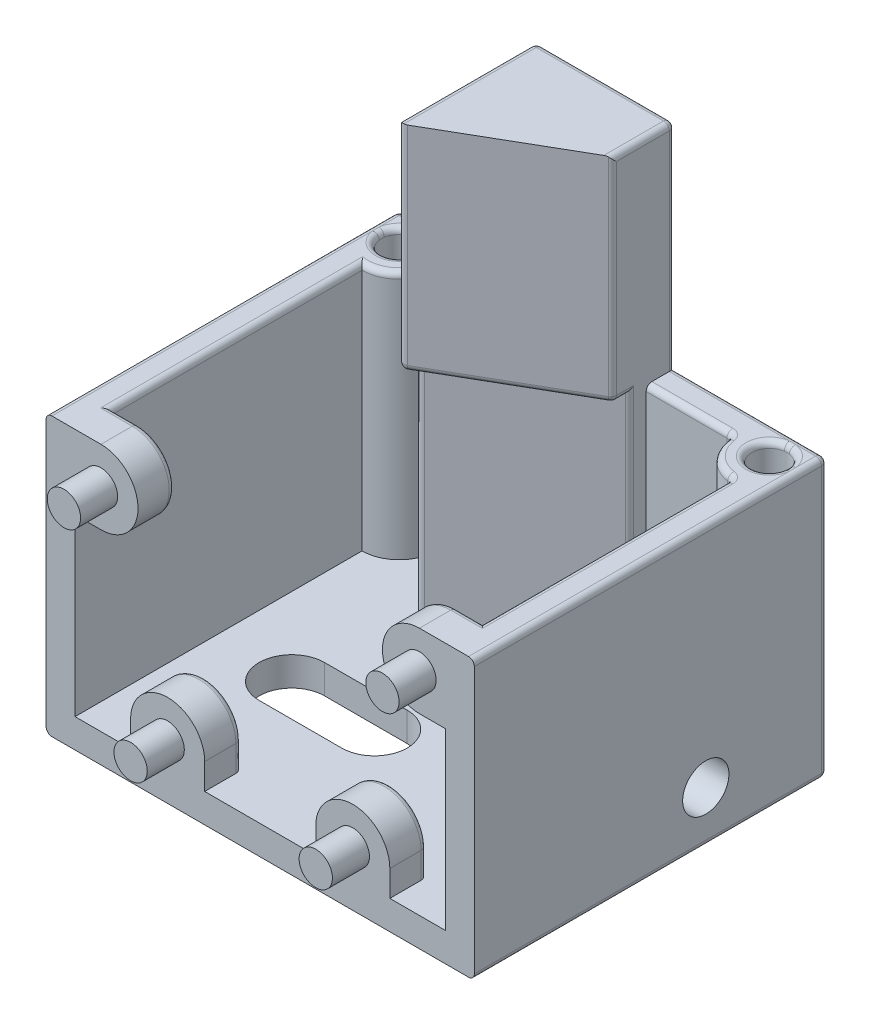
ISO-10303-21;
HEADER;
FILE_DESCRIPTION(('STEP AP214'),'2;1');
FILE_NAME('part.step','',(''),(''),'','','');
FILE_SCHEMA(('AUTOMOTIVE_DESIGN { 1 0 10303 214 1 1 1 1 }'));
ENDSEC;
DATA;
#1=APPLICATION_CONTEXT('core data for automotive mechanical design processes');
#2=APPLICATION_PROTOCOL_DEFINITION('international standard','automotive_design',2000,#1);
#3=PRODUCT_CONTEXT('',#1,'mechanical');
#4=PRODUCT('Part','Part','',(#3));
#5=PRODUCT_RELATED_PRODUCT_CATEGORY('part','',(#4));
#6=PRODUCT_DEFINITION_FORMATION('','',#4);
#7=PRODUCT_DEFINITION_CONTEXT('part definition',#1,'design');
#8=PRODUCT_DEFINITION('design','',#6,#7);
#9=PRODUCT_DEFINITION_SHAPE('','',#8);
#10=(LENGTH_UNIT() NAMED_UNIT(*) SI_UNIT(.MILLI.,.METRE.));
#11=(NAMED_UNIT(*) PLANE_ANGLE_UNIT() SI_UNIT($,.RADIAN.));
#12=(NAMED_UNIT(*) SI_UNIT($,.STERADIAN.) SOLID_ANGLE_UNIT());
#13=UNCERTAINTY_MEASURE_WITH_UNIT(LENGTH_MEASURE(1.E-05),#10,'distance_accuracy_value','');
#14=(GEOMETRIC_REPRESENTATION_CONTEXT(3) GLOBAL_UNCERTAINTY_ASSIGNED_CONTEXT((#13)) GLOBAL_UNIT_ASSIGNED_CONTEXT((#10,
#11,#12)) REPRESENTATION_CONTEXT('',''));
#15=CARTESIAN_POINT('',(0.,0.,0.));
#16=DIRECTION('',(0.,0.,1.));
#17=DIRECTION('',(1.,0.,0.));
#18=AXIS2_PLACEMENT_3D('',#15,#16,#17);
#19=CARTESIAN_POINT('',(0.,0.,3.17499999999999));
#20=DIRECTION('',(0.,0.,-1.));
#21=DIRECTION('',(-1.,0.,0.));
#22=AXIS2_PLACEMENT_3D('',#19,#20,#21);
#23=PLANE('',#22);
#24=DIRECTION('',(-1.,0.,0.));
#25=VECTOR('',#24,1.);
#26=CARTESIAN_POINT('',(0.,19.05,3.17499999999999));
#27=LINE('',#26,#25);
#28=CARTESIAN_POINT('',(-10.922,19.05,3.17499999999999));
#29=VERTEX_POINT('',#28);
#30=CARTESIAN_POINT('',(-14.2875,19.05,3.175));
#31=VERTEX_POINT('',#30);
#32=EDGE_CURVE('E765',#29,#31,#27,.T.);
#33=ORIENTED_EDGE('',*,*,#32,.T.);
#34=CARTESIAN_POINT('',(-14.2875,18.653125,3.17499999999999));
#35=DIRECTION('',(0.,0.,-1.));
#36=DIRECTION('',(-1.,0.,0.));
#37=AXIS2_PLACEMENT_3D('',#34,#35,#36);
#38=CIRCLE('',#37,0.396875);
#39=CARTESIAN_POINT('',(-14.684375,18.653125,3.17499999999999));
#40=VERTEX_POINT('',#39);
#41=EDGE_CURVE('E13',#31,#40,#38,.F.);
#42=ORIENTED_EDGE('',*,*,#41,.T.);
#43=DIRECTION('',(0.,1.,0.));
#44=VECTOR('',#43,1.);
#45=CARTESIAN_POINT('',(-14.684375,19.05,3.17499999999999));
#46=LINE('',#45,#44);
#47=CARTESIAN_POINT('',(-14.684375,0.396875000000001,3.17499999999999));
#48=VERTEX_POINT('',#47);
#49=EDGE_CURVE('E772',#48,#40,#46,.T.);
#50=ORIENTED_EDGE('',*,*,#49,.F.);
#51=CARTESIAN_POINT('',(-14.2875,0.396875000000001,3.17499999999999));
#52=DIRECTION('',(0.,0.,-1.));
#53=DIRECTION('',(-1.,0.,0.));
#54=AXIS2_PLACEMENT_3D('',#51,#52,#53);
#55=CIRCLE('',#54,0.396875);
#56=CARTESIAN_POINT('',(-14.2875,0.,3.17499999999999));
#57=VERTEX_POINT('',#56);
#58=EDGE_CURVE('E776',#48,#57,#55,.F.);
#59=ORIENTED_EDGE('',*,*,#58,.T.);
#60=DIRECTION('',(-1.,0.,0.));
#61=VECTOR('',#60,1.);
#62=CARTESIAN_POINT('',(0.,0.,3.17499999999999));
#63=LINE('',#62,#61);
#64=CARTESIAN_POINT('',(14.2875,0.,3.17499999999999));
#65=VERTEX_POINT('',#64);
#66=EDGE_CURVE('E775',#65,#57,#63,.T.);
#67=ORIENTED_EDGE('',*,*,#66,.F.);
#68=CARTESIAN_POINT('',(14.2875,0.396875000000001,3.17499999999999));
#69=DIRECTION('',(0.,0.,-1.));
#70=DIRECTION('',(-1.,0.,0.));
#71=AXIS2_PLACEMENT_3D('',#68,#69,#70);
#72=CIRCLE('',#71,0.396875);
#73=CARTESIAN_POINT('',(14.684375,0.396875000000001,3.17499999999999));
#74=VERTEX_POINT('',#73);
#75=EDGE_CURVE('E779',#65,#74,#72,.F.);
#76=ORIENTED_EDGE('',*,*,#75,.T.);
#77=DIRECTION('',(0.,-1.,0.));
#78=VECTOR('',#77,1.);
#79=CARTESIAN_POINT('',(14.684375,19.05,3.17499999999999));
#80=LINE('',#79,#78);
#81=CARTESIAN_POINT('',(14.684375,18.653125,3.17499999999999));
#82=VERTEX_POINT('',#81);
#83=EDGE_CURVE('E774',#82,#74,#80,.T.);
#84=ORIENTED_EDGE('',*,*,#83,.F.);
#85=CARTESIAN_POINT('',(14.2875,18.653125,3.17499999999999));
#86=DIRECTION('',(0.,0.,-1.));
#87=DIRECTION('',(-1.,0.,0.));
#88=AXIS2_PLACEMENT_3D('',#85,#86,#87);
#89=CIRCLE('',#88,0.396875);
#90=CARTESIAN_POINT('',(14.2875,19.05,3.175));
#91=VERTEX_POINT('',#90);
#92=EDGE_CURVE('E116',#82,#91,#89,.F.);
#93=ORIENTED_EDGE('',*,*,#92,.T.);
#94=DIRECTION('',(-1.,0.,0.));
#95=VECTOR('',#94,1.);
#96=CARTESIAN_POINT('',(0.,19.05,3.17499999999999));
#97=LINE('',#96,#95);
#98=CARTESIAN_POINT('',(10.922,19.05,3.17499999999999));
#99=VERTEX_POINT('',#98);
#100=EDGE_CURVE('E785',#91,#99,#97,.T.);
#101=ORIENTED_EDGE('',*,*,#100,.T.);
#102=CARTESIAN_POINT('',(10.922,16.51,3.17499999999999));
#103=DIRECTION('',(0.,0.,-1.));
#104=DIRECTION('',(-1.,0.,0.));
#105=AXIS2_PLACEMENT_3D('',#102,#103,#104);
#106=CIRCLE('',#105,2.54);
#107=CARTESIAN_POINT('',(10.922,13.97,3.17499999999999));
#108=VERTEX_POINT('',#107);
#109=EDGE_CURVE('E791',#99,#108,#106,.F.);
#110=ORIENTED_EDGE('',*,*,#109,.T.);
#111=DIRECTION('',(1.,0.,0.));
#112=VECTOR('',#111,1.);
#113=CARTESIAN_POINT('',(12.7,13.97,3.17499999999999));
#114=LINE('',#113,#112);
#115=CARTESIAN_POINT('',(12.7,13.97,3.17499999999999));
#116=VERTEX_POINT('',#115);
#117=EDGE_CURVE('E794',#108,#116,#114,.T.);
#118=ORIENTED_EDGE('',*,*,#117,.T.);
#119=DIRECTION('',(0.,-1.,0.));
#120=VECTOR('',#119,1.);
#121=CARTESIAN_POINT('',(12.7,17.065625,3.17499999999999));
#122=LINE('',#121,#120);
#123=CARTESIAN_POINT('',(12.7,1.984375,3.17499999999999));
#124=VERTEX_POINT('',#123);
#125=EDGE_CURVE('E770',#116,#124,#122,.T.);
#126=ORIENTED_EDGE('',*,*,#125,.T.);
#127=DIRECTION('',(-1.,0.,0.));
#128=VECTOR('',#127,1.);
#129=CARTESIAN_POINT('',(0.,1.984375,3.17499999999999));
#130=LINE('',#129,#128);
#131=CARTESIAN_POINT('',(8.89,1.984375,3.17499999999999));
#132=VERTEX_POINT('',#131);
#133=EDGE_CURVE('E790',#124,#132,#130,.T.);
#134=ORIENTED_EDGE('',*,*,#133,.T.);
#135=DIRECTION('',(0.,1.,0.));
#136=VECTOR('',#135,1.);
#137=CARTESIAN_POINT('',(8.89,1.984375,3.17499999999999));
#138=LINE('',#137,#136);
#139=CARTESIAN_POINT('',(8.89,3.762375,3.17499999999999));
#140=VERTEX_POINT('',#139);
#141=EDGE_CURVE('E804',#132,#140,#138,.T.);
#142=ORIENTED_EDGE('',*,*,#141,.T.);
#143=CARTESIAN_POINT('',(6.35,3.762375,3.17499999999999));
#144=DIRECTION('',(0.,0.,-1.));
#145=DIRECTION('',(-1.,0.,0.));
#146=AXIS2_PLACEMENT_3D('',#143,#144,#145);
#147=CIRCLE('',#146,2.54);
#148=CARTESIAN_POINT('',(3.81,3.762375,3.17499999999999));
#149=VERTEX_POINT('',#148);
#150=EDGE_CURVE('E807',#140,#149,#147,.F.);
#151=ORIENTED_EDGE('',*,*,#150,.T.);
#152=DIRECTION('',(0.,-1.,0.));
#153=VECTOR('',#152,1.);
#154=CARTESIAN_POINT('',(3.81,1.984375,3.17499999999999));
#155=LINE('',#154,#153);
#156=CARTESIAN_POINT('',(3.81,1.984375,3.17499999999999));
#157=VERTEX_POINT('',#156);
#158=EDGE_CURVE('E783',#149,#157,#155,.T.);
#159=ORIENTED_EDGE('',*,*,#158,.T.);
#160=CARTESIAN_POINT('',(-3.81,1.984375,3.17499999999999));
#161=VERTEX_POINT('',#160);
#162=EDGE_CURVE('E803',#157,#161,#130,.T.);
#163=ORIENTED_EDGE('',*,*,#162,.T.);
#164=DIRECTION('',(0.,1.,0.));
#165=VECTOR('',#164,1.);
#166=CARTESIAN_POINT('',(-3.81,1.984375,3.17499999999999));
#167=LINE('',#166,#165);
#168=CARTESIAN_POINT('',(-3.81,3.762375,3.17499999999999));
#169=VERTEX_POINT('',#168);
#170=EDGE_CURVE('E797',#161,#169,#167,.T.);
#171=ORIENTED_EDGE('',*,*,#170,.T.);
#172=CARTESIAN_POINT('',(-6.35,3.762375,3.17499999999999));
#173=DIRECTION('',(0.,0.,-1.));
#174=DIRECTION('',(-1.,0.,0.));
#175=AXIS2_PLACEMENT_3D('',#172,#173,#174);
#176=CIRCLE('',#175,2.54);
#177=CARTESIAN_POINT('',(-8.89,3.762375,3.17499999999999));
#178=VERTEX_POINT('',#177);
#179=EDGE_CURVE('E815',#169,#178,#176,.F.);
#180=ORIENTED_EDGE('',*,*,#179,.T.);
#181=DIRECTION('',(0.,-1.,0.));
#182=VECTOR('',#181,1.);
#183=CARTESIAN_POINT('',(-8.89,1.984375,3.17499999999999));
#184=LINE('',#183,#182);
#185=CARTESIAN_POINT('',(-8.89,1.984375,3.17499999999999));
#186=VERTEX_POINT('',#185);
#187=EDGE_CURVE('E808',#178,#186,#184,.T.);
#188=ORIENTED_EDGE('',*,*,#187,.T.);
#189=CARTESIAN_POINT('',(-12.7,1.984375,3.17499999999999));
#190=VERTEX_POINT('',#189);
#191=EDGE_CURVE('E800',#186,#190,#130,.T.);
#192=ORIENTED_EDGE('',*,*,#191,.T.);
#193=DIRECTION('',(0.,1.,0.));
#194=VECTOR('',#193,1.);
#195=CARTESIAN_POINT('',(-12.7,17.065625,3.17499999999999));
#196=LINE('',#195,#194);
#197=CARTESIAN_POINT('',(-12.7,13.97,3.17499999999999));
#198=VERTEX_POINT('',#197);
#199=EDGE_CURVE('E769',#190,#198,#196,.T.);
#200=ORIENTED_EDGE('',*,*,#199,.T.);
#201=DIRECTION('',(-1.,0.,0.));
#202=VECTOR('',#201,1.);
#203=CARTESIAN_POINT('',(-12.7,13.97,3.17499999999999));
#204=LINE('',#203,#202);
#205=CARTESIAN_POINT('',(-10.922,13.97,3.17499999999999));
#206=VERTEX_POINT('',#205);
#207=EDGE_CURVE('E821',#206,#198,#204,.T.);
#208=ORIENTED_EDGE('',*,*,#207,.F.);
#209=CARTESIAN_POINT('',(-10.922,16.51,3.17499999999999));
#210=DIRECTION('',(0.,0.,-1.));
#211=DIRECTION('',(-1.,0.,0.));
#212=AXIS2_PLACEMENT_3D('',#209,#210,#211);
#213=CIRCLE('',#212,2.54);
#214=EDGE_CURVE('E111',#29,#206,#213,.T.);
#215=ORIENTED_EDGE('',*,*,#214,.F.);
#216=EDGE_LOOP('',(#33,#42,#50,#59,#67,#76,#84,#93,#101,#110,#118,#126,#134,#142,#151,#159,#163,
#171,#180,#188,#192,#200,#208,#215));
#217=FACE_BOUND('',#216,.T.);
#218=CARTESIAN_POINT('',(-10.922,16.51,3.17499999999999));
#219=DIRECTION('',(0.,0.,1.));
#220=DIRECTION('',(1.,0.,0.));
#221=AXIS2_PLACEMENT_3D('',#218,#219,#220);
#222=CIRCLE('',#221,1.143);
#223=CARTESIAN_POINT('',(-9.779,16.51,3.17499999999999));
#224=VERTEX_POINT('',#223);
#225=EDGE_CURVE('E923',#224,#224,#222,.T.);
#226=ORIENTED_EDGE('',*,*,#225,.F.);
#227=EDGE_LOOP('',(#226));
#228=FACE_BOUND('',#227,.T.);
#229=CARTESIAN_POINT('',(-6.35,3.762375,3.17499999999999));
#230=DIRECTION('',(0.,0.,1.));
#231=DIRECTION('',(1.,0.,0.));
#232=AXIS2_PLACEMENT_3D('',#229,#230,#231);
#233=CIRCLE('',#232,1.143);
#234=CARTESIAN_POINT('',(-5.207,3.762375,3.17499999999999));
#235=VERTEX_POINT('',#234);
#236=EDGE_CURVE('E1188',#235,#235,#233,.T.);
#237=ORIENTED_EDGE('',*,*,#236,.F.);
#238=EDGE_LOOP('',(#237));
#239=FACE_BOUND('',#238,.T.);
#240=CARTESIAN_POINT('',(6.35,3.762375,3.17499999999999));
#241=DIRECTION('',(0.,0.,1.));
#242=DIRECTION('',(1.,0.,0.));
#243=AXIS2_PLACEMENT_3D('',#240,#241,#242);
#244=CIRCLE('',#243,1.143);
#245=CARTESIAN_POINT('',(7.493,3.762375,3.17499999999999));
#246=VERTEX_POINT('',#245);
#247=EDGE_CURVE('E1194',#246,#246,#244,.T.);
#248=ORIENTED_EDGE('',*,*,#247,.F.);
#249=EDGE_LOOP('',(#248));
#250=FACE_BOUND('',#249,.T.);
#251=CARTESIAN_POINT('',(10.922,16.51,3.17499999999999));
#252=DIRECTION('',(0.,0.,1.));
#253=DIRECTION('',(1.,0.,0.));
#254=AXIS2_PLACEMENT_3D('',#251,#252,#253);
#255=CIRCLE('',#254,1.143);
#256=CARTESIAN_POINT('',(12.065,16.51,3.17499999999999));
#257=VERTEX_POINT('',#256);
#258=EDGE_CURVE('E666',#257,#257,#255,.T.);
#259=ORIENTED_EDGE('',*,*,#258,.F.);
#260=EDGE_LOOP('',(#259));
#261=FACE_BOUND('',#260,.T.);
#262=ADVANCED_FACE('F108',(#217,#228,#239,#250,#261),#23,.F.);
#263=CARTESIAN_POINT('',(0.,19.05,0.));
#264=DIRECTION('',(0.,1.,0.));
#265=DIRECTION('',(0.,0.,1.));
#266=AXIS2_PLACEMENT_3D('',#263,#264,#265);
#267=PLANE('',#266);
#268=DIRECTION('',(-1.,0.,0.));
#269=VECTOR('',#268,1.);
#270=CARTESIAN_POINT('',(4.24497500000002,19.05,-20.6375));
#271=LINE('',#270,#269);
#272=CARTESIAN_POINT('',(14.2875,19.05,-20.6375));
#273=VERTEX_POINT('',#272);
#274=CARTESIAN_POINT('',(12.9250669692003,19.05,-20.6375));
#275=VERTEX_POINT('',#274);
#276=EDGE_CURVE('E1037',#273,#275,#271,.T.);
#277=ORIENTED_EDGE('',*,*,#276,.T.);
#278=CARTESIAN_POINT('',(12.7,19.05,-19.05));
#279=DIRECTION('',(0.,1.,0.));
#280=DIRECTION('',(0.,0.,1.));
#281=AXIS2_PLACEMENT_3D('',#278,#279,#280);
#282=CIRCLE('',#281,1.603375);
#283=CARTESIAN_POINT('',(14.2875,19.05,-19.2750669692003));
#284=VERTEX_POINT('',#283);
#285=EDGE_CURVE('E1017',#275,#284,#282,.F.);
#286=ORIENTED_EDGE('',*,*,#285,.T.);
#287=DIRECTION('',(0.,0.,-1.));
#288=VECTOR('',#287,1.);
#289=CARTESIAN_POINT('',(14.2875,19.05,-21.034375));
#290=LINE('',#289,#288);
#291=EDGE_CURVE('E1041',#284,#273,#290,.T.);
#292=ORIENTED_EDGE('',*,*,#291,.T.);
#293=EDGE_LOOP('',(#277,#286,#292));
#294=FACE_BOUND('',#293,.T.);
#295=ADVANCED_FACE('F689',(#294),#267,.T.);
#296=DIRECTION('',(0.,0.,1.));
#297=VECTOR('',#296,1.);
#298=CARTESIAN_POINT('',(-14.2875,19.05,3.175));
#299=LINE('',#298,#297);
#300=CARTESIAN_POINT('',(-14.2875,19.05,-20.6375));
#301=VERTEX_POINT('',#300);
#302=CARTESIAN_POINT('',(-14.2875,19.05,-19.2750669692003));
#303=VERTEX_POINT('',#302);
#304=EDGE_CURVE('E1510',#301,#303,#299,.T.);
#305=ORIENTED_EDGE('',*,*,#304,.T.);
#306=CARTESIAN_POINT('',(-12.7,19.05,-19.05));
#307=DIRECTION('',(0.,1.,0.));
#308=DIRECTION('',(0.,0.,1.));
#309=AXIS2_PLACEMENT_3D('',#306,#307,#308);
#310=CIRCLE('',#309,1.603375);
#311=CARTESIAN_POINT('',(-12.9250669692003,19.05,-20.6375));
#312=VERTEX_POINT('',#311);
#313=EDGE_CURVE('E1015',#303,#312,#310,.F.);
#314=ORIENTED_EDGE('',*,*,#313,.T.);
#315=DIRECTION('',(-1.,0.,0.));
#316=VECTOR('',#315,1.);
#317=CARTESIAN_POINT('',(-14.684375,19.05,-20.6375));
#318=LINE('',#317,#316);
#319=EDGE_CURVE('E1527',#312,#301,#318,.T.);
#320=ORIENTED_EDGE('',*,*,#319,.T.);
#321=EDGE_LOOP('',(#305,#314,#320));
#322=FACE_BOUND('',#321,.T.);
#323=ADVANCED_FACE('F695',(#322),#267,.T.);
#324=ORIENTED_EDGE('',*,*,#100,.F.);
#325=CARTESIAN_POINT('',(14.2875,19.05,-18.8249330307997));
#326=VERTEX_POINT('',#325);
#327=EDGE_CURVE('E1047',#91,#326,#290,.T.);
#328=ORIENTED_EDGE('',*,*,#327,.T.);
#329=CARTESIAN_POINT('',(12.7,19.05,-19.05));
#330=DIRECTION('',(0.,1.,0.));
#331=DIRECTION('',(0.,0.,1.));
#332=AXIS2_PLACEMENT_3D('',#329,#330,#331);
#333=CIRCLE('',#332,1.603375);
#334=CARTESIAN_POINT('',(12.4749330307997,19.05,-20.6375));
#335=VERTEX_POINT('',#334);
#336=EDGE_CURVE('E937',#326,#335,#333,.F.);
#337=ORIENTED_EDGE('',*,*,#336,.T.);
#338=CARTESIAN_POINT('',(4.24497500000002,19.05,-20.6375));
#339=VERTEX_POINT('',#338);
#340=EDGE_CURVE('E1039',#335,#339,#271,.T.);
#341=ORIENTED_EDGE('',*,*,#340,.T.);
#342=DIRECTION('',(0.,0.,-1.));
#343=VECTOR('',#342,1.);
#344=CARTESIAN_POINT('',(4.24497500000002,19.05,-21.034375));
#345=LINE('',#344,#343);
#346=CARTESIAN_POINT('',(4.24497500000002,19.05,-19.446875));
#347=VERTEX_POINT('',#346);
#348=EDGE_CURVE('E1103',#347,#339,#345,.T.);
#349=ORIENTED_EDGE('',*,*,#348,.F.);
#350=DIRECTION('',(-1.,0.,0.));
#351=VECTOR('',#350,1.);
#352=CARTESIAN_POINT('',(0.,19.05,-19.446875));
#353=LINE('',#352,#351);
#354=CARTESIAN_POINT('',(9.79006443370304,19.05,-19.446875));
#355=VERTEX_POINT('',#354);
#356=EDGE_CURVE('E1060',#347,#355,#353,.F.);
#357=ORIENTED_EDGE('',*,*,#356,.T.);
#358=CARTESIAN_POINT('',(9.79006443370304,19.05,-18.653125));
#359=DIRECTION('',(0.,1.,0.));
#360=DIRECTION('',(0.,0.,1.));
#361=AXIS2_PLACEMENT_3D('',#358,#359,#360);
#362=CIRCLE('',#361,0.79375);
#363=CARTESIAN_POINT('',(10.5765335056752,19.05,-18.7603885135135));
#364=VERTEX_POINT('',#363);
#365=EDGE_CURVE('E1062',#364,#355,#362,.T.);
#366=ORIENTED_EDGE('',*,*,#365,.F.);
#367=CARTESIAN_POINT('',(12.7,19.05,-19.05));
#368=DIRECTION('',(0.,1.,0.));
#369=DIRECTION('',(0.,0.,1.));
#370=AXIS2_PLACEMENT_3D('',#367,#368,#369);
#371=CIRCLE('',#370,2.143125);
#372=CARTESIAN_POINT('',(12.4103885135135,19.05,-16.9265335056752));
#373=VERTEX_POINT('',#372);
#374=EDGE_CURVE('E1056',#364,#373,#371,.T.);
#375=ORIENTED_EDGE('',*,*,#374,.T.);
#376=CARTESIAN_POINT('',(12.303125,19.05,-16.140064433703));
#377=DIRECTION('',(0.,1.,0.));
#378=DIRECTION('',(0.,0.,1.));
#379=AXIS2_PLACEMENT_3D('',#376,#377,#378);
#380=CIRCLE('',#379,0.79375);
#381=CARTESIAN_POINT('',(13.096875,19.05,-16.140064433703));
#382=VERTEX_POINT('',#381);
#383=EDGE_CURVE('E1054',#382,#373,#380,.T.);
#384=ORIENTED_EDGE('',*,*,#383,.F.);
#385=DIRECTION('',(0.,0.,-1.));
#386=VECTOR('',#385,1.);
#387=CARTESIAN_POINT('',(13.096875,19.05,0.));
#388=LINE('',#387,#386);
#389=CARTESIAN_POINT('',(13.096875,19.05,1.03187499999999));
#390=VERTEX_POINT('',#389);
#391=EDGE_CURVE('E1053',#382,#390,#388,.F.);
#392=ORIENTED_EDGE('',*,*,#391,.T.);
#393=DIRECTION('',(-1.,0.,0.));
#394=VECTOR('',#393,1.);
#395=CARTESIAN_POINT('',(0.,19.05,1.03187499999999));
#396=LINE('',#395,#394);
#397=CARTESIAN_POINT('',(10.922,19.05,1.03187499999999));
#398=VERTEX_POINT('',#397);
#399=EDGE_CURVE('E1010',#390,#398,#396,.T.);
#400=ORIENTED_EDGE('',*,*,#399,.T.);
#401=DIRECTION('',(0.,0.,1.));
#402=VECTOR('',#401,1.);
#403=CARTESIAN_POINT('',(10.922,19.05,0.634999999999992));
#404=LINE('',#403,#402);
#405=EDGE_CURVE('E1116',#398,#99,#404,.T.);
#406=ORIENTED_EDGE('',*,*,#405,.T.);
#407=EDGE_LOOP('',(#324,#328,#337,#341,#349,#357,#366,#375,#384,#392,#400,#406));
#408=FACE_BOUND('',#407,.T.);
#409=ADVANCED_FACE('F895',(#408),#267,.T.);
#410=CARTESIAN_POINT('',(0.,1.984375,0.));
#411=DIRECTION('',(0.,1.,0.));
#412=DIRECTION('',(0.,0.,1.));
#413=AXIS2_PLACEMENT_3D('',#410,#411,#412);
#414=PLANE('',#413);
#415=CARTESIAN_POINT('',(-1.692275,1.984375,-6.35000000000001));
#416=DIRECTION('',(0.,1.,0.));
#417=DIRECTION('',(0.,0.,1.));
#418=AXIS2_PLACEMENT_3D('',#415,#416,#417);
#419=CIRCLE('',#418,2.2479);
#420=CARTESIAN_POINT('',(-1.692275,1.984375,-4.10210000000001));
#421=VERTEX_POINT('',#420);
#422=CARTESIAN_POINT('',(-1.692275,1.984375,-8.59790000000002));
#423=VERTEX_POINT('',#422);
#424=EDGE_CURVE('E629',#421,#423,#419,.T.);
#425=ORIENTED_EDGE('',*,*,#424,.F.);
#426=DIRECTION('',(-1.,0.,0.));
#427=VECTOR('',#426,1.);
#428=CARTESIAN_POINT('',(-1.692275,1.984375,-4.10210000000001));
#429=LINE('',#428,#427);
#430=CARTESIAN_POINT('',(-7.356475,1.984375,-4.10210000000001));
#431=VERTEX_POINT('',#430);
#432=EDGE_CURVE('E620',#421,#431,#429,.T.);
#433=ORIENTED_EDGE('',*,*,#432,.T.);
#434=CARTESIAN_POINT('',(-7.356475,1.984375,-6.35));
#435=DIRECTION('',(0.,1.,0.));
#436=DIRECTION('',(0.,0.,1.));
#437=AXIS2_PLACEMENT_3D('',#434,#435,#436);
#438=CIRCLE('',#437,2.2479);
#439=CARTESIAN_POINT('',(-7.356475,1.984375,-8.59790000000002));
#440=VERTEX_POINT('',#439);
#441=EDGE_CURVE('E640',#440,#431,#438,.T.);
#442=ORIENTED_EDGE('',*,*,#441,.F.);
#443=DIRECTION('',(-1.,0.,0.));
#444=VECTOR('',#443,1.);
#445=CARTESIAN_POINT('',(-1.692275,1.984375,-8.59790000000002));
#446=LINE('',#445,#444);
#447=EDGE_CURVE('E645',#423,#440,#446,.T.);
#448=ORIENTED_EDGE('',*,*,#447,.F.);
#449=EDGE_LOOP('',(#425,#433,#442,#448));
#450=FACE_BOUND('',#449,.T.);
#451=ORIENTED_EDGE('',*,*,#133,.F.);
#452=DIRECTION('',(0.,0.,-1.));
#453=VECTOR('',#452,1.);
#454=CARTESIAN_POINT('',(12.7,1.984375,-19.05));
#455=LINE('',#454,#453);
#456=CARTESIAN_POINT('',(12.7,1.984375,-7.62));
#457=VERTEX_POINT('',#456);
#458=EDGE_CURVE('E1118',#124,#457,#455,.T.);
#459=ORIENTED_EDGE('',*,*,#458,.T.);
#460=DIRECTION('',(-1.,0.,0.));
#461=VECTOR('',#460,1.);
#462=CARTESIAN_POINT('',(6.42937500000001,1.984375,-7.62));
#463=LINE('',#462,#461);
#464=CARTESIAN_POINT('',(6.42937500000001,1.984375,-7.62));
#465=VERTEX_POINT('',#464);
#466=EDGE_CURVE('E1162',#457,#465,#463,.T.);
#467=ORIENTED_EDGE('',*,*,#466,.T.);
#468=CARTESIAN_POINT('',(6.42937500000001,1.984375,-12.7));
#469=DIRECTION('',(0.,-1.,0.));
#470=DIRECTION('',(0.,0.,1.));
#471=AXIS2_PLACEMENT_3D('',#468,#469,#470);
#472=CIRCLE('',#471,5.08);
#473=CARTESIAN_POINT('',(6.42937500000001,1.984375,-17.78));
#474=VERTEX_POINT('',#473);
#475=EDGE_CURVE('E1158',#465,#474,#472,.T.);
#476=ORIENTED_EDGE('',*,*,#475,.T.);
#477=DIRECTION('',(1.,0.,0.));
#478=VECTOR('',#477,1.);
#479=CARTESIAN_POINT('',(6.42937500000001,1.984375,-17.78));
#480=LINE('',#479,#478);
#481=CARTESIAN_POINT('',(10.5002954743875,1.984375,-17.78));
#482=VERTEX_POINT('',#481);
#483=EDGE_CURVE('E1161',#474,#482,#480,.T.);
#484=ORIENTED_EDGE('',*,*,#483,.T.);
#485=CARTESIAN_POINT('',(12.7,1.984375,-19.05));
#486=DIRECTION('',(0.,1.,0.));
#487=DIRECTION('',(0.,0.,1.));
#488=AXIS2_PLACEMENT_3D('',#485,#486,#487);
#489=CIRCLE('',#488,2.54);
#490=CARTESIAN_POINT('',(10.1832989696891,1.984375,-18.7067567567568));
#491=VERTEX_POINT('',#490);
#492=EDGE_CURVE('E1073',#491,#482,#489,.T.);
#493=ORIENTED_EDGE('',*,*,#492,.F.);
#494=CARTESIAN_POINT('',(9.79006443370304,1.984375,-18.653125));
#495=DIRECTION('',(0.,1.,0.));
#496=DIRECTION('',(0.,0.,1.));
#497=AXIS2_PLACEMENT_3D('',#494,#495,#496);
#498=CIRCLE('',#497,0.396875);
#499=CARTESIAN_POINT('',(9.79006443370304,1.984375,-19.05));
#500=VERTEX_POINT('',#499);
#501=EDGE_CURVE('E1043',#491,#500,#498,.T.);
#502=ORIENTED_EDGE('',*,*,#501,.T.);
#503=DIRECTION('',(-1.,0.,0.));
#504=VECTOR('',#503,1.);
#505=CARTESIAN_POINT('',(-12.7,1.984375,-19.05));
#506=LINE('',#505,#504);
#507=CARTESIAN_POINT('',(4.64185000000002,1.984375,-19.05));
#508=VERTEX_POINT('',#507);
#509=EDGE_CURVE('E1167',#500,#508,#506,.T.);
#510=ORIENTED_EDGE('',*,*,#509,.T.);
#511=DIRECTION('',(0.,0.,1.));
#512=VECTOR('',#511,1.);
#513=CARTESIAN_POINT('',(4.64185000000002,1.984375,0.));
#514=LINE('',#513,#512);
#515=CARTESIAN_POINT('',(4.64185000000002,1.984375,-18.1790973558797));
#516=VERTEX_POINT('',#515);
#517=EDGE_CURVE('E1715',#508,#516,#514,.T.);
#518=ORIENTED_EDGE('',*,*,#517,.T.);
#519=CARTESIAN_POINT('',(3.84810000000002,1.984375,-18.1790973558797));
#520=DIRECTION('',(0.,1.,0.));
#521=DIRECTION('',(0.,0.,1.));
#522=AXIS2_PLACEMENT_3D('',#519,#520,#521);
#523=CIRCLE('',#522,0.79375);
#524=CARTESIAN_POINT('',(4.24497500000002,1.984375,-17.4916896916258));
#525=VERTEX_POINT('',#524);
#526=EDGE_CURVE('E1823',#525,#516,#523,.T.);
#527=ORIENTED_EDGE('',*,*,#526,.F.);
#528=DIRECTION('',(0.86602540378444,0.,-0.499999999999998));
#529=VECTOR('',#528,1.);
#530=CARTESIAN_POINT('',(-5.08158749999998,1.984375,-12.106996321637));
#531=LINE('',#530,#529);
#532=CARTESIAN_POINT('',(-4.48627499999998,1.984375,-12.450700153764));
#533=VERTEX_POINT('',#532);
#534=EDGE_CURVE('E1828',#525,#533,#531,.F.);
#535=ORIENTED_EDGE('',*,*,#534,.T.);
#536=CARTESIAN_POINT('',(-4.88314999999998,1.984375,-13.1381078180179));
#537=DIRECTION('',(0.,1.,0.));
#538=DIRECTION('',(0.,0.,1.));
#539=AXIS2_PLACEMENT_3D('',#536,#537,#538);
#540=CIRCLE('',#539,0.79375);
#541=CARTESIAN_POINT('',(-5.28002499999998,1.984375,-12.450700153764));
#542=VERTEX_POINT('',#541);
#543=EDGE_CURVE('E1044',#542,#533,#540,.T.);
#544=ORIENTED_EDGE('',*,*,#543,.F.);
#545=CARTESIAN_POINT('',(-4.88314999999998,1.984375,-13.1381078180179));
#546=DIRECTION('',(0.,1.,0.));
#547=DIRECTION('',(0.,0.,1.));
#548=AXIS2_PLACEMENT_3D('',#545,#546,#547);
#549=CIRCLE('',#548,0.79375);
#550=CARTESIAN_POINT('',(-5.67689999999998,1.984375,-13.1381078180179));
#551=VERTEX_POINT('',#550);
#552=EDGE_CURVE('E1830',#551,#542,#549,.T.);
#553=ORIENTED_EDGE('',*,*,#552,.F.);
#554=DIRECTION('',(0.,0.,-1.));
#555=VECTOR('',#554,1.);
#556=CARTESIAN_POINT('',(-5.67689999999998,1.984375,0.));
#557=LINE('',#556,#555);
#558=CARTESIAN_POINT('',(-5.67689999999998,1.984375,-19.05));
#559=VERTEX_POINT('',#558);
#560=EDGE_CURVE('E1824',#551,#559,#557,.T.);
#561=ORIENTED_EDGE('',*,*,#560,.T.);
#562=CARTESIAN_POINT('',(-10.16,1.984375,-19.05));
#563=VERTEX_POINT('',#562);
#564=EDGE_CURVE('E1138',#559,#563,#506,.T.);
#565=ORIENTED_EDGE('',*,*,#564,.T.);
#566=CARTESIAN_POINT('',(-12.7,1.984375,-19.05));
#567=DIRECTION('',(0.,1.,0.));
#568=DIRECTION('',(0.,0.,1.));
#569=AXIS2_PLACEMENT_3D('',#566,#567,#568);
#570=CIRCLE('',#569,2.54);
#571=CARTESIAN_POINT('',(-12.7,1.984375,-16.51));
#572=VERTEX_POINT('',#571);
#573=EDGE_CURVE('E1136',#563,#572,#570,.F.);
#574=ORIENTED_EDGE('',*,*,#573,.T.);
#575=DIRECTION('',(0.,0.,1.));
#576=VECTOR('',#575,1.);
#577=CARTESIAN_POINT('',(-12.7,1.984375,-19.05));
#578=LINE('',#577,#576);
#579=EDGE_CURVE('E1091',#572,#190,#578,.T.);
#580=ORIENTED_EDGE('',*,*,#579,.T.);
#581=ORIENTED_EDGE('',*,*,#191,.F.);
#582=DIRECTION('',(0.,0.,-1.));
#583=VECTOR('',#582,1.);
#584=CARTESIAN_POINT('',(-8.89,1.984375,5.71499999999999));
#585=LINE('',#584,#583);
#586=CARTESIAN_POINT('',(-8.89,1.984375,1.03187499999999));
#587=VERTEX_POINT('',#586);
#588=EDGE_CURVE('E1090',#186,#587,#585,.T.);
#589=ORIENTED_EDGE('',*,*,#588,.T.);
#590=CARTESIAN_POINT('',(-8.493125,1.984375,1.03187499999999));
#591=DIRECTION('',(0.,1.,0.));
#592=DIRECTION('',(0.,0.,1.));
#593=AXIS2_PLACEMENT_3D('',#590,#591,#592);
#594=CIRCLE('',#593,0.396875);
#595=CARTESIAN_POINT('',(-8.493125,1.984375,0.634999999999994));
#596=VERTEX_POINT('',#595);
#597=EDGE_CURVE('E835',#587,#596,#594,.F.);
#598=ORIENTED_EDGE('',*,*,#597,.T.);
#599=DIRECTION('',(-1.,0.,0.));
#600=VECTOR('',#599,1.);
#601=CARTESIAN_POINT('',(-8.89,1.984375,0.634999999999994));
#602=LINE('',#601,#600);
#603=CARTESIAN_POINT('',(-4.206875,1.984375,0.634999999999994));
#604=VERTEX_POINT('',#603);
#605=EDGE_CURVE('E1085',#604,#596,#602,.T.);
#606=ORIENTED_EDGE('',*,*,#605,.F.);
#607=CARTESIAN_POINT('',(-4.206875,1.984375,1.03187499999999));
#608=DIRECTION('',(0.,1.,0.));
#609=DIRECTION('',(0.,0.,1.));
#610=AXIS2_PLACEMENT_3D('',#607,#608,#609);
#611=CIRCLE('',#610,0.396875);
#612=CARTESIAN_POINT('',(-3.81,1.984375,1.03187499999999));
#613=VERTEX_POINT('',#612);
#614=EDGE_CURVE('E2081',#604,#613,#611,.F.);
#615=ORIENTED_EDGE('',*,*,#614,.T.);
#616=DIRECTION('',(0.,0.,-1.));
#617=VECTOR('',#616,1.);
#618=CARTESIAN_POINT('',(-3.81,1.984375,5.71499999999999));
#619=LINE('',#618,#617);
#620=EDGE_CURVE('E1095',#161,#613,#619,.T.);
#621=ORIENTED_EDGE('',*,*,#620,.F.);
#622=ORIENTED_EDGE('',*,*,#162,.F.);
#623=DIRECTION('',(0.,0.,-1.));
#624=VECTOR('',#623,1.);
#625=CARTESIAN_POINT('',(3.81,1.984375,5.71499999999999));
#626=LINE('',#625,#624);
#627=CARTESIAN_POINT('',(3.81,1.984375,1.03187499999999));
#628=VERTEX_POINT('',#627);
#629=EDGE_CURVE('E1088',#157,#628,#626,.T.);
#630=ORIENTED_EDGE('',*,*,#629,.T.);
#631=CARTESIAN_POINT('',(4.206875,1.984375,1.03187499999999));
#632=DIRECTION('',(0.,1.,0.));
#633=DIRECTION('',(0.,0.,1.));
#634=AXIS2_PLACEMENT_3D('',#631,#632,#633);
#635=CIRCLE('',#634,0.396875);
#636=CARTESIAN_POINT('',(4.206875,1.984375,0.634999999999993));
#637=VERTEX_POINT('',#636);
#638=EDGE_CURVE('E828',#628,#637,#635,.F.);
#639=ORIENTED_EDGE('',*,*,#638,.T.);
#640=DIRECTION('',(-1.,0.,0.));
#641=VECTOR('',#640,1.);
#642=CARTESIAN_POINT('',(3.81,1.984375,0.634999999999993));
#643=LINE('',#642,#641);
#644=CARTESIAN_POINT('',(8.493125,1.984375,0.634999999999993));
#645=VERTEX_POINT('',#644);
#646=EDGE_CURVE('E1078',#645,#637,#643,.T.);
#647=ORIENTED_EDGE('',*,*,#646,.F.);
#648=CARTESIAN_POINT('',(8.493125,1.984375,1.03187499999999));
#649=DIRECTION('',(0.,1.,0.));
#650=DIRECTION('',(0.,0.,1.));
#651=AXIS2_PLACEMENT_3D('',#648,#649,#650);
#652=CIRCLE('',#651,0.396875);
#653=CARTESIAN_POINT('',(8.89,1.984375,1.03187499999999));
#654=VERTEX_POINT('',#653);
#655=EDGE_CURVE('E2118',#645,#654,#652,.F.);
#656=ORIENTED_EDGE('',*,*,#655,.T.);
#657=DIRECTION('',(0.,0.,-1.));
#658=VECTOR('',#657,1.);
#659=CARTESIAN_POINT('',(8.89,1.984375,5.71499999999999));
#660=LINE('',#659,#658);
#661=EDGE_CURVE('E1082',#132,#654,#660,.T.);
#662=ORIENTED_EDGE('',*,*,#661,.F.);
#663=EDGE_LOOP('',(#451,#459,#467,#476,#484,#493,#502,#510,#518,#527,#535,#544,#553,#561,#565,
#574,#580,#581,#589,#598,#606,#615,#621,#622,#630,#639,#647,#656,#662));
#664=FACE_BOUND('',#663,.T.);
#665=ADVANCED_FACE('F643',(#450,#664),#414,.T.);
#666=CARTESIAN_POINT('',(12.7,17.065625,-19.05));
#667=DIRECTION('',(-1.,0.,0.));
#668=DIRECTION('',(0.,0.,1.));
#669=AXIS2_PLACEMENT_3D('',#666,#667,#668);
#670=PLANE('',#669);
#671=ORIENTED_EDGE('',*,*,#125,.F.);
#672=DIRECTION('',(0.,0.,1.));
#673=VECTOR('',#672,1.);
#674=CARTESIAN_POINT('',(12.7,13.97,0.634999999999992));
#675=LINE('',#674,#673);
#676=CARTESIAN_POINT('',(12.7,13.97,1.03187499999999));
#677=VERTEX_POINT('',#676);
#678=EDGE_CURVE('E1098',#677,#116,#675,.T.);
#679=ORIENTED_EDGE('',*,*,#678,.F.);
#680=CARTESIAN_POINT('',(12.7,14.366875,1.03187499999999));
#681=DIRECTION('',(-1.,0.,0.));
#682=DIRECTION('',(0.,0.,1.));
#683=AXIS2_PLACEMENT_3D('',#680,#681,#682);
#684=CIRCLE('',#683,0.396875);
#685=CARTESIAN_POINT('',(12.7,14.366875,0.634999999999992));
#686=VERTEX_POINT('',#685);
#687=EDGE_CURVE('E1682',#677,#686,#684,.F.);
#688=ORIENTED_EDGE('',*,*,#687,.T.);
#689=DIRECTION('',(0.,1.,0.));
#690=VECTOR('',#689,1.);
#691=CARTESIAN_POINT('',(12.7,19.05,0.634999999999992));
#692=LINE('',#691,#690);
#693=CARTESIAN_POINT('',(12.7,18.653125,0.634999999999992));
#694=VERTEX_POINT('',#693);
#695=EDGE_CURVE('E1102',#686,#694,#692,.T.);
#696=ORIENTED_EDGE('',*,*,#695,.T.);
#697=DIRECTION('',(0.,0.,-1.));
#698=VECTOR('',#697,1.);
#699=CARTESIAN_POINT('',(12.7,18.653125,-19.05));
#700=LINE('',#699,#698);
#701=CARTESIAN_POINT('',(12.7,18.653125,-16.140064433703));
#702=VERTEX_POINT('',#701);
#703=EDGE_CURVE('E1065',#694,#702,#700,.T.);
#704=ORIENTED_EDGE('',*,*,#703,.T.);
#705=DIRECTION('',(0.,1.,0.));
#706=VECTOR('',#705,1.);
#707=CARTESIAN_POINT('',(12.7,17.065625,-16.140064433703));
#708=LINE('',#707,#706);
#709=CARTESIAN_POINT('',(12.7,7.064375,-16.140064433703));
#710=VERTEX_POINT('',#709);
#711=EDGE_CURVE('E1068',#702,#710,#708,.F.);
#712=ORIENTED_EDGE('',*,*,#711,.T.);
#713=DIRECTION('',(0.,0.,1.));
#714=VECTOR('',#713,1.);
#715=CARTESIAN_POINT('',(12.7,7.064375,-7.62));
#716=LINE('',#715,#714);
#717=CARTESIAN_POINT('',(12.7,7.064375,-7.62));
#718=VERTEX_POINT('',#717);
#719=EDGE_CURVE('E1109',#710,#718,#716,.T.);
#720=ORIENTED_EDGE('',*,*,#719,.T.);
#721=DIRECTION('',(0.,-1.,0.));
#722=VECTOR('',#721,1.);
#723=CARTESIAN_POINT('',(12.7,7.064375,-7.62));
#724=LINE('',#723,#722);
#725=EDGE_CURVE('E1153',#718,#457,#724,.T.);
#726=ORIENTED_EDGE('',*,*,#725,.T.);
#727=ORIENTED_EDGE('',*,*,#458,.F.);
#728=EDGE_LOOP('',(#671,#679,#688,#696,#704,#712,#720,#726,#727));
#729=FACE_BOUND('',#728,.T.);
#730=ADVANCED_FACE('F898',(#729),#670,.T.);
#731=CARTESIAN_POINT('',(6.42937500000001,7.064375,-12.7));
#732=DIRECTION('',(0.,-1.,0.));
#733=DIRECTION('',(0.,0.,1.));
#734=AXIS2_PLACEMENT_3D('',#731,#732,#733);
#735=PLANE('',#734);
#736=CARTESIAN_POINT('',(6.4293750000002,7.064375,-12.7));
#737=DIRECTION('',(0.,-1.,0.));
#738=DIRECTION('',(0.,0.,-1.));
#739=AXIS2_PLACEMENT_3D('',#736,#737,#738);
#740=CIRCLE('',#739,3.635375);
#741=CARTESIAN_POINT('',(6.4293750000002,7.064375,-16.335375));
#742=VERTEX_POINT('',#741);
#743=EDGE_CURVE('E1270',#742,#742,#740,.T.);
#744=ORIENTED_EDGE('',*,*,#743,.T.);
#745=EDGE_LOOP('',(#744));
#746=FACE_BOUND('',#745,.T.);
#747=ORIENTED_EDGE('',*,*,#719,.F.);
#748=CARTESIAN_POINT('',(12.303125,7.064375,-16.140064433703));
#749=DIRECTION('',(0.,-1.,0.));
#750=DIRECTION('',(0.,0.,-1.));
#751=AXIS2_PLACEMENT_3D('',#748,#749,#750);
#752=CIRCLE('',#751,0.396875);
#753=CARTESIAN_POINT('',(12.3567567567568,7.064375,-16.5332989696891));
#754=VERTEX_POINT('',#753);
#755=EDGE_CURVE('E1273',#710,#754,#752,.F.);
#756=ORIENTED_EDGE('',*,*,#755,.T.);
#757=CARTESIAN_POINT('',(12.7,7.064375,-19.05));
#758=DIRECTION('',(0.,-1.,0.));
#759=DIRECTION('',(0.,0.,-1.));
#760=AXIS2_PLACEMENT_3D('',#757,#758,#759);
#761=CIRCLE('',#760,2.54);
#762=CARTESIAN_POINT('',(10.5002954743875,7.064375,-17.78));
#763=VERTEX_POINT('',#762);
#764=EDGE_CURVE('E1075',#763,#754,#761,.F.);
#765=ORIENTED_EDGE('',*,*,#764,.F.);
#766=DIRECTION('',(1.,0.,0.));
#767=VECTOR('',#766,1.);
#768=CARTESIAN_POINT('',(6.42937500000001,7.064375,-17.78));
#769=LINE('',#768,#767);
#770=CARTESIAN_POINT('',(6.42937500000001,7.064375,-17.78));
#771=VERTEX_POINT('',#770);
#772=EDGE_CURVE('E1154',#771,#763,#769,.T.);
#773=ORIENTED_EDGE('',*,*,#772,.F.);
#774=CARTESIAN_POINT('',(6.42937500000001,7.064375,-12.7));
#775=DIRECTION('',(0.,-1.,0.));
#776=DIRECTION('',(0.,0.,1.));
#777=AXIS2_PLACEMENT_3D('',#774,#775,#776);
#778=CIRCLE('',#777,5.08);
#779=CARTESIAN_POINT('',(6.42937500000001,7.064375,-7.62));
#780=VERTEX_POINT('',#779);
#781=EDGE_CURVE('E1145',#780,#771,#778,.T.);
#782=ORIENTED_EDGE('',*,*,#781,.F.);
#783=DIRECTION('',(-1.,0.,0.));
#784=VECTOR('',#783,1.);
#785=CARTESIAN_POINT('',(6.42937500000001,7.064375,-7.62));
#786=LINE('',#785,#784);
#787=EDGE_CURVE('E1149',#718,#780,#786,.T.);
#788=ORIENTED_EDGE('',*,*,#787,.F.);
#789=EDGE_LOOP('',(#747,#756,#765,#773,#782,#788));
#790=FACE_BOUND('',#789,.T.);
#791=ADVANCED_FACE('F2040',(#746,#790),#735,.F.);
#792=CARTESIAN_POINT('',(-12.7,17.065625,-19.05));
#793=DIRECTION('',(0.,0.,1.));
#794=DIRECTION('',(1.,0.,0.));
#795=AXIS2_PLACEMENT_3D('',#792,#793,#794);
#796=PLANE('',#795);
#797=DIRECTION('',(0.,-1.,0.));
#798=VECTOR('',#797,1.);
#799=CARTESIAN_POINT('',(4.24497500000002,33.734375,-19.05));
#800=LINE('',#799,#798);
#801=CARTESIAN_POINT('',(4.24497500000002,18.653125,-19.05));
#802=VERTEX_POINT('',#801);
#803=CARTESIAN_POINT('',(4.24497500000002,2.38125,-19.05));
#804=VERTEX_POINT('',#803);
#805=EDGE_CURVE('E1157',#802,#804,#800,.T.);
#806=ORIENTED_EDGE('',*,*,#805,.T.);
#807=CARTESIAN_POINT('',(4.64185000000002,2.38125,-19.05));
#808=DIRECTION('',(0.,0.,1.));
#809=DIRECTION('',(1.,0.,0.));
#810=AXIS2_PLACEMENT_3D('',#807,#808,#809);
#811=CIRCLE('',#810,0.396875);
#812=EDGE_CURVE('E1728',#804,#508,#811,.T.);
#813=ORIENTED_EDGE('',*,*,#812,.T.);
#814=ORIENTED_EDGE('',*,*,#509,.F.);
#815=DIRECTION('',(0.,1.,0.));
#816=VECTOR('',#815,1.);
#817=CARTESIAN_POINT('',(9.79006443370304,17.065625,-19.05));
#818=LINE('',#817,#816);
#819=CARTESIAN_POINT('',(9.79006443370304,18.653125,-19.05));
#820=VERTEX_POINT('',#819);
#821=EDGE_CURVE('E1726',#500,#820,#818,.T.);
#822=ORIENTED_EDGE('',*,*,#821,.T.);
#823=DIRECTION('',(-1.,0.,0.));
#824=VECTOR('',#823,1.);
#825=CARTESIAN_POINT('',(-12.7,18.653125,-19.05));
#826=LINE('',#825,#824);
#827=EDGE_CURVE('E1724',#820,#802,#826,.T.);
#828=ORIENTED_EDGE('',*,*,#827,.T.);
#829=EDGE_LOOP('',(#806,#813,#814,#822,#828));
#830=FACE_BOUND('',#829,.T.);
#831=ADVANCED_FACE('F1815',(#830),#796,.T.);
#832=CARTESIAN_POINT('',(6.42937500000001,7.064375,-17.78));
#833=DIRECTION('',(0.,0.,-1.));
#834=DIRECTION('',(-1.,0.,0.));
#835=AXIS2_PLACEMENT_3D('',#832,#833,#834);
#836=PLANE('',#835);
#837=ORIENTED_EDGE('',*,*,#772,.T.);
#838=DIRECTION('',(0.,1.,0.));
#839=VECTOR('',#838,1.);
#840=CARTESIAN_POINT('',(10.5002954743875,-1.60772744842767,-17.78));
#841=LINE('',#840,#839);
#842=EDGE_CURVE('E1144',#763,#482,#841,.F.);
#843=ORIENTED_EDGE('',*,*,#842,.T.);
#844=ORIENTED_EDGE('',*,*,#483,.F.);
#845=DIRECTION('',(0.,-1.,0.));
#846=VECTOR('',#845,1.);
#847=CARTESIAN_POINT('',(6.42937500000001,7.064375,-17.78));
#848=LINE('',#847,#846);
#849=EDGE_CURVE('E1148',#771,#474,#848,.T.);
#850=ORIENTED_EDGE('',*,*,#849,.F.);
#851=EDGE_LOOP('',(#837,#843,#844,#850));
#852=FACE_BOUND('',#851,.T.);
#853=ADVANCED_FACE('F893',(#852),#836,.T.);
#854=ORIENTED_EDGE('',*,*,#32,.F.);
#855=DIRECTION('',(0.,0.,1.));
#856=VECTOR('',#855,1.);
#857=CARTESIAN_POINT('',(-10.922,19.05,0.634999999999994));
#858=LINE('',#857,#856);
#859=CARTESIAN_POINT('',(-10.922,19.05,1.03187499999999));
#860=VERTEX_POINT('',#859);
#861=EDGE_CURVE('E1123',#860,#29,#858,.T.);
#862=ORIENTED_EDGE('',*,*,#861,.F.);
#863=DIRECTION('',(1.,0.,0.));
#864=VECTOR('',#863,1.);
#865=CARTESIAN_POINT('',(0.,19.05,1.03187499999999));
#866=LINE('',#865,#864);
#867=CARTESIAN_POINT('',(-13.096875,19.05,1.03187499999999));
#868=VERTEX_POINT('',#867);
#869=EDGE_CURVE('E1486',#860,#868,#866,.F.);
#870=ORIENTED_EDGE('',*,*,#869,.T.);
#871=DIRECTION('',(0.,0.,1.));
#872=VECTOR('',#871,1.);
#873=CARTESIAN_POINT('',(-13.096875,19.05,0.));
#874=LINE('',#873,#872);
#875=CARTESIAN_POINT('',(-13.096875,19.05,-16.9439432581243));
#876=VERTEX_POINT('',#875);
#877=EDGE_CURVE('E1543',#868,#876,#874,.F.);
#878=ORIENTED_EDGE('',*,*,#877,.T.);
#879=CARTESIAN_POINT('',(-12.7,19.05,-19.05));
#880=DIRECTION('',(0.,1.,0.));
#881=DIRECTION('',(0.,0.,1.));
#882=AXIS2_PLACEMENT_3D('',#879,#880,#881);
#883=CIRCLE('',#882,2.143125);
#884=CARTESIAN_POINT('',(-10.556875,19.05,-19.05));
#885=VERTEX_POINT('',#884);
#886=EDGE_CURVE('E1540',#876,#885,#883,.T.);
#887=ORIENTED_EDGE('',*,*,#886,.T.);
#888=DIRECTION('',(-1.,0.,0.));
#889=VECTOR('',#888,1.);
#890=CARTESIAN_POINT('',(-12.7,19.05,-19.05));
#891=LINE('',#890,#889);
#892=CARTESIAN_POINT('',(-5.67689999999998,19.05,-19.05));
#893=VERTEX_POINT('',#892);
#894=EDGE_CURVE('E1130',#893,#885,#891,.T.);
#895=ORIENTED_EDGE('',*,*,#894,.F.);
#896=DIRECTION('',(0.,0.,1.));
#897=VECTOR('',#896,1.);
#898=CARTESIAN_POINT('',(-5.67689999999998,19.05,0.));
#899=LINE('',#898,#897);
#900=CARTESIAN_POINT('',(-5.67689999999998,19.05,-20.6375));
#901=VERTEX_POINT('',#900);
#902=EDGE_CURVE('E1534',#893,#901,#899,.F.);
#903=ORIENTED_EDGE('',*,*,#902,.T.);
#904=CARTESIAN_POINT('',(-12.4749330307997,19.05,-20.6375));
#905=VERTEX_POINT('',#904);
#906=EDGE_CURVE('E1495',#901,#905,#318,.T.);
#907=ORIENTED_EDGE('',*,*,#906,.T.);
#908=CARTESIAN_POINT('',(-12.7,19.05,-19.05));
#909=DIRECTION('',(0.,1.,0.));
#910=DIRECTION('',(0.,0.,1.));
#911=AXIS2_PLACEMENT_3D('',#908,#909,#910);
#912=CIRCLE('',#911,1.603375);
#913=CARTESIAN_POINT('',(-14.2875,19.05,-18.8249330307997));
#914=VERTEX_POINT('',#913);
#915=EDGE_CURVE('E1019',#905,#914,#912,.F.);
#916=ORIENTED_EDGE('',*,*,#915,.T.);
#917=EDGE_CURVE('E1493',#914,#31,#299,.T.);
#918=ORIENTED_EDGE('',*,*,#917,.T.);
#919=EDGE_LOOP('',(#854,#862,#870,#878,#887,#895,#903,#907,#916,#918));
#920=FACE_BOUND('',#919,.T.);
#921=ADVANCED_FACE('F698',(#920),#267,.T.);
#922=CARTESIAN_POINT('',(-12.7,17.065625,-19.05));
#923=DIRECTION('',(1.,0.,0.));
#924=DIRECTION('',(0.,0.,-1.));
#925=AXIS2_PLACEMENT_3D('',#922,#923,#924);
#926=PLANE('',#925);
#927=ORIENTED_EDGE('',*,*,#199,.F.);
#928=ORIENTED_EDGE('',*,*,#579,.F.);
#929=DIRECTION('',(0.,1.,0.));
#930=VECTOR('',#929,1.);
#931=CARTESIAN_POINT('',(-12.7,-1.60772744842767,-16.51));
#932=LINE('',#931,#930);
#933=CARTESIAN_POINT('',(-12.7,18.653125,-16.51));
#934=VERTEX_POINT('',#933);
#935=EDGE_CURVE('E1131',#572,#934,#932,.T.);
#936=ORIENTED_EDGE('',*,*,#935,.T.);
#937=DIRECTION('',(0.,0.,1.));
#938=VECTOR('',#937,1.);
#939=CARTESIAN_POINT('',(-12.7,18.653125,-19.05));
#940=LINE('',#939,#938);
#941=CARTESIAN_POINT('',(-12.7,18.653125,0.634999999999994));
#942=VERTEX_POINT('',#941);
#943=EDGE_CURVE('E1260',#934,#942,#940,.T.);
#944=ORIENTED_EDGE('',*,*,#943,.T.);
#945=DIRECTION('',(0.,1.,0.));
#946=VECTOR('',#945,1.);
#947=CARTESIAN_POINT('',(-12.7,19.05,0.634999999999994));
#948=LINE('',#947,#946);
#949=CARTESIAN_POINT('',(-12.7,14.366875,0.634999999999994));
#950=VERTEX_POINT('',#949);
#951=EDGE_CURVE('E1120',#950,#942,#948,.T.);
#952=ORIENTED_EDGE('',*,*,#951,.F.);
#953=CARTESIAN_POINT('',(-12.7,14.366875,1.03187499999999));
#954=DIRECTION('',(1.,0.,0.));
#955=DIRECTION('',(0.,0.,-1.));
#956=AXIS2_PLACEMENT_3D('',#953,#954,#955);
#957=CIRCLE('',#956,0.396875);
#958=CARTESIAN_POINT('',(-12.7,13.97,1.03187499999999));
#959=VERTEX_POINT('',#958);
#960=EDGE_CURVE('E2115',#950,#959,#957,.F.);
#961=ORIENTED_EDGE('',*,*,#960,.T.);
#962=DIRECTION('',(0.,0.,1.));
#963=VECTOR('',#962,1.);
#964=CARTESIAN_POINT('',(-12.7,13.97,0.634999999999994));
#965=LINE('',#964,#963);
#966=EDGE_CURVE('E1127',#959,#198,#965,.T.);
#967=ORIENTED_EDGE('',*,*,#966,.T.);
#968=EDGE_LOOP('',(#927,#928,#936,#944,#952,#961,#967));
#969=FACE_BOUND('',#968,.T.);
#970=ADVANCED_FACE('F892',(#969),#926,.T.);
#971=ORIENTED_EDGE('',*,*,#564,.F.);
#972=DIRECTION('',(0.,-1.,0.));
#973=VECTOR('',#972,1.);
#974=CARTESIAN_POINT('',(-5.67689999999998,17.065625,-19.05));
#975=LINE('',#974,#973);
#976=EDGE_CURVE('E1594',#559,#893,#975,.F.);
#977=ORIENTED_EDGE('',*,*,#976,.T.);
#978=ORIENTED_EDGE('',*,*,#894,.T.);
#979=CARTESIAN_POINT('',(-10.556875,18.653125,-19.05));
#980=DIRECTION('',(0.,0.,1.));
#981=DIRECTION('',(1.,0.,0.));
#982=AXIS2_PLACEMENT_3D('',#979,#980,#981);
#983=CIRCLE('',#982,0.396875);
#984=CARTESIAN_POINT('',(-10.16,18.653125,-19.05));
#985=VERTEX_POINT('',#984);
#986=EDGE_CURVE('E1295',#885,#985,#983,.F.);
#987=ORIENTED_EDGE('',*,*,#986,.T.);
#988=DIRECTION('',(0.,1.,0.));
#989=VECTOR('',#988,1.);
#990=CARTESIAN_POINT('',(-10.16,-1.60772744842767,-19.05));
#991=LINE('',#990,#989);
#992=EDGE_CURVE('E1135',#563,#985,#991,.T.);
#993=ORIENTED_EDGE('',*,*,#992,.F.);
#994=EDGE_LOOP('',(#971,#977,#978,#987,#993));
#995=FACE_BOUND('',#994,.T.);
#996=ADVANCED_FACE('F1239',(#995),#796,.T.);
#997=CARTESIAN_POINT('',(14.684375,19.05,-19.05));
#998=DIRECTION('',(-1.,0.,0.));
#999=DIRECTION('',(0.,0.,1.));
#1000=AXIS2_PLACEMENT_3D('',#997,#998,#999);
#1001=PLANE('',#1000);
#1002=CARTESIAN_POINT('',(14.684375,3.5321875,-12.7));
#1003=DIRECTION('',(1.,0.,0.));
#1004=DIRECTION('',(0.,0.,-1.));
#1005=AXIS2_PLACEMENT_3D('',#1002,#1003,#1004);
#1006=CIRCLE('',#1005,1.5875);
#1007=CARTESIAN_POINT('',(14.684375,3.5321875,-14.2875));
#1008=VERTEX_POINT('',#1007);
#1009=EDGE_CURVE('E655',#1008,#1008,#1006,.T.);
#1010=ORIENTED_EDGE('',*,*,#1009,.F.);
#1011=EDGE_LOOP('',(#1010));
#1012=FACE_BOUND('',#1011,.T.);
#1013=DIRECTION('',(0.,0.,-1.));
#1014=VECTOR('',#1013,1.);
#1015=CARTESIAN_POINT('',(14.684375,18.653125,3.175));
#1016=LINE('',#1015,#1014);
#1017=CARTESIAN_POINT('',(14.684375,18.653125,-20.6375));
#1018=VERTEX_POINT('',#1017);
#1019=EDGE_CURVE('E1600',#1018,#82,#1016,.F.);
#1020=ORIENTED_EDGE('',*,*,#1019,.T.);
#1021=ORIENTED_EDGE('',*,*,#83,.T.);
#1022=DIRECTION('',(0.,0.,-1.));
#1023=VECTOR('',#1022,1.);
#1024=CARTESIAN_POINT('',(14.684375,0.396875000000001,-19.05));
#1025=LINE('',#1024,#1023);
#1026=CARTESIAN_POINT('',(14.684375,0.396875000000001,-20.6375));
#1027=VERTEX_POINT('',#1026);
#1028=EDGE_CURVE('E1598',#74,#1027,#1025,.T.);
#1029=ORIENTED_EDGE('',*,*,#1028,.T.);
#1030=DIRECTION('',(0.,-1.,0.));
#1031=VECTOR('',#1030,1.);
#1032=CARTESIAN_POINT('',(14.684375,19.05,-20.6375));
#1033=LINE('',#1032,#1031);
#1034=EDGE_CURVE('E1596',#1027,#1018,#1033,.F.);
#1035=ORIENTED_EDGE('',*,*,#1034,.T.);
#1036=EDGE_LOOP('',(#1020,#1021,#1029,#1035));
#1037=FACE_BOUND('',#1036,.T.);
#1038=ADVANCED_FACE('F1235',(#1012,#1037),#1001,.F.);
#1039=CARTESIAN_POINT('',(-12.7,19.05,-21.034375));
#1040=DIRECTION('',(0.,0.,1.));
#1041=DIRECTION('',(1.,0.,0.));
#1042=AXIS2_PLACEMENT_3D('',#1039,#1040,#1041);
#1043=PLANE('',#1042);
#1044=DIRECTION('',(-1.,0.,0.));
#1045=VECTOR('',#1044,1.);
#1046=CARTESIAN_POINT('',(14.684375,18.653125,-21.034375));
#1047=LINE('',#1046,#1045);
#1048=CARTESIAN_POINT('',(3.84810000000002,18.653125,-21.034375));
#1049=VERTEX_POINT('',#1048);
#1050=CARTESIAN_POINT('',(14.2875,18.653125,-21.034375));
#1051=VERTEX_POINT('',#1050);
#1052=EDGE_CURVE('E1551',#1049,#1051,#1047,.F.);
#1053=ORIENTED_EDGE('',*,*,#1052,.T.);
#1054=DIRECTION('',(0.,-1.,0.));
#1055=VECTOR('',#1054,1.);
#1056=CARTESIAN_POINT('',(14.2875,19.05,-21.034375));
#1057=LINE('',#1056,#1055);
#1058=CARTESIAN_POINT('',(14.2875,0.396875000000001,-21.034375));
#1059=VERTEX_POINT('',#1058);
#1060=EDGE_CURVE('E1562',#1051,#1059,#1057,.T.);
#1061=ORIENTED_EDGE('',*,*,#1060,.T.);
#1062=DIRECTION('',(-1.,0.,0.));
#1063=VECTOR('',#1062,1.);
#1064=CARTESIAN_POINT('',(-12.7,0.396875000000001,-21.034375));
#1065=LINE('',#1064,#1063);
#1066=CARTESIAN_POINT('',(-14.2875,0.396875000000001,-21.034375));
#1067=VERTEX_POINT('',#1066);
#1068=EDGE_CURVE('E1560',#1059,#1067,#1065,.T.);
#1069=ORIENTED_EDGE('',*,*,#1068,.T.);
#1070=DIRECTION('',(0.,-1.,0.));
#1071=VECTOR('',#1070,1.);
#1072=CARTESIAN_POINT('',(-14.2875,19.05,-21.034375));
#1073=LINE('',#1072,#1071);
#1074=CARTESIAN_POINT('',(-14.2875,18.653125,-21.034375));
#1075=VERTEX_POINT('',#1074);
#1076=EDGE_CURVE('E1558',#1067,#1075,#1073,.F.);
#1077=ORIENTED_EDGE('',*,*,#1076,.T.);
#1078=DIRECTION('',(-1.,0.,0.));
#1079=VECTOR('',#1078,1.);
#1080=CARTESIAN_POINT('',(-5.28002499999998,18.653125,-21.034375));
#1081=LINE('',#1080,#1079);
#1082=CARTESIAN_POINT('',(-5.67689999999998,18.653125,-21.034375));
#1083=VERTEX_POINT('',#1082);
#1084=EDGE_CURVE('E1555',#1075,#1083,#1081,.F.);
#1085=ORIENTED_EDGE('',*,*,#1084,.T.);
#1086=CARTESIAN_POINT('',(-5.67689999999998,19.446875,-21.034375));
#1087=DIRECTION('',(0.,0.,1.));
#1088=DIRECTION('',(1.,0.,0.));
#1089=AXIS2_PLACEMENT_3D('',#1086,#1087,#1088);
#1090=CIRCLE('',#1089,0.79375);
#1091=CARTESIAN_POINT('',(-4.88314999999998,19.446875,-21.034375));
#1092=VERTEX_POINT('',#1091);
#1093=EDGE_CURVE('E1553',#1092,#1083,#1090,.F.);
#1094=ORIENTED_EDGE('',*,*,#1093,.F.);
#1095=DIRECTION('',(0.,-1.,0.));
#1096=VECTOR('',#1095,1.);
#1097=CARTESIAN_POINT('',(-4.88314999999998,19.05,-21.034375));
#1098=LINE('',#1097,#1096);
#1099=CARTESIAN_POINT('',(-4.88314999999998,33.3375,-21.034375));
#1100=VERTEX_POINT('',#1099);
#1101=EDGE_CURVE('E1549',#1092,#1100,#1098,.F.);
#1102=ORIENTED_EDGE('',*,*,#1101,.T.);
#1103=DIRECTION('',(-1.,0.,0.));
#1104=VECTOR('',#1103,1.);
#1105=CARTESIAN_POINT('',(4.24497500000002,33.3375,-21.034375));
#1106=LINE('',#1105,#1104);
#1107=CARTESIAN_POINT('',(3.84810000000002,33.3375,-21.034375));
#1108=VERTEX_POINT('',#1107);
#1109=EDGE_CURVE('E1545',#1100,#1108,#1106,.F.);
#1110=ORIENTED_EDGE('',*,*,#1109,.T.);
#1111=DIRECTION('',(0.,-1.,0.));
#1112=VECTOR('',#1111,1.);
#1113=CARTESIAN_POINT('',(3.84810000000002,19.05,-21.034375));
#1114=LINE('',#1113,#1112);
#1115=EDGE_CURVE('E1547',#1108,#1049,#1114,.T.);
#1116=ORIENTED_EDGE('',*,*,#1115,.T.);
#1117=EDGE_LOOP('',(#1053,#1061,#1069,#1077,#1085,#1094,#1102,#1110,#1116));
#1118=FACE_BOUND('',#1117,.T.);
#1119=ADVANCED_FACE('F1238',(#1118),#1043,.F.);
#1120=CARTESIAN_POINT('',(-14.684375,19.05,-19.05));
#1121=DIRECTION('',(1.,0.,0.));
#1122=DIRECTION('',(0.,0.,-1.));
#1123=AXIS2_PLACEMENT_3D('',#1120,#1121,#1122);
#1124=PLANE('',#1123);
#1125=DIRECTION('',(0.,0.,1.));
#1126=VECTOR('',#1125,1.);
#1127=CARTESIAN_POINT('',(-14.684375,0.396875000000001,-19.05));
#1128=LINE('',#1127,#1126);
#1129=CARTESIAN_POINT('',(-14.684375,0.396875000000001,-20.6375));
#1130=VERTEX_POINT('',#1129);
#1131=EDGE_CURVE('E1253',#1130,#48,#1128,.T.);
#1132=ORIENTED_EDGE('',*,*,#1131,.T.);
#1133=ORIENTED_EDGE('',*,*,#49,.T.);
#1134=DIRECTION('',(0.,0.,1.));
#1135=VECTOR('',#1134,1.);
#1136=CARTESIAN_POINT('',(-14.684375,18.653125,-21.034375));
#1137=LINE('',#1136,#1135);
#1138=CARTESIAN_POINT('',(-14.684375,18.653125,-20.6375));
#1139=VERTEX_POINT('',#1138);
#1140=EDGE_CURVE('E1265',#40,#1139,#1137,.F.);
#1141=ORIENTED_EDGE('',*,*,#1140,.T.);
#1142=DIRECTION('',(0.,-1.,0.));
#1143=VECTOR('',#1142,1.);
#1144=CARTESIAN_POINT('',(-14.684375,19.05,-20.6375));
#1145=LINE('',#1144,#1143);
#1146=EDGE_CURVE('E1256',#1139,#1130,#1145,.T.);
#1147=ORIENTED_EDGE('',*,*,#1146,.T.);
#1148=EDGE_LOOP('',(#1132,#1133,#1141,#1147));
#1149=FACE_BOUND('',#1148,.T.);
#1150=ADVANCED_FACE('F1242',(#1149),#1124,.F.);
#1151=CARTESIAN_POINT('',(0.,0.,0.));
#1152=DIRECTION('',(0.,1.,0.));
#1153=DIRECTION('',(0.,0.,1.));
#1154=AXIS2_PLACEMENT_3D('',#1151,#1152,#1153);
#1155=PLANE('',#1154);
#1156=CARTESIAN_POINT('',(-7.356475,0.,-6.35));
#1157=DIRECTION('',(0.,1.,0.));
#1158=DIRECTION('',(0.,0.,1.));
#1159=AXIS2_PLACEMENT_3D('',#1156,#1157,#1158);
#1160=CIRCLE('',#1159,2.2479);
#1161=CARTESIAN_POINT('',(-7.356475,0.,-8.5979));
#1162=VERTEX_POINT('',#1161);
#1163=CARTESIAN_POINT('',(-7.356475,0.,-4.10210000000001));
#1164=VERTEX_POINT('',#1163);
#1165=EDGE_CURVE('E129',#1162,#1164,#1160,.T.);
#1166=ORIENTED_EDGE('',*,*,#1165,.T.);
#1167=DIRECTION('',(-1.,0.,0.));
#1168=VECTOR('',#1167,1.);
#1169=CARTESIAN_POINT('',(-1.692275,0.,-4.10210000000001));
#1170=LINE('',#1169,#1168);
#1171=CARTESIAN_POINT('',(-1.692275,0.,-4.10210000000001));
#1172=VERTEX_POINT('',#1171);
#1173=EDGE_CURVE('E630',#1172,#1164,#1170,.T.);
#1174=ORIENTED_EDGE('',*,*,#1173,.F.);
#1175=CARTESIAN_POINT('',(-1.692275,0.,-6.35000000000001));
#1176=DIRECTION('',(0.,1.,0.));
#1177=DIRECTION('',(0.,0.,1.));
#1178=AXIS2_PLACEMENT_3D('',#1175,#1176,#1177);
#1179=CIRCLE('',#1178,2.2479);
#1180=CARTESIAN_POINT('',(-1.692275,0.,-8.59790000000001));
#1181=VERTEX_POINT('',#1180);
#1182=EDGE_CURVE('E638',#1172,#1181,#1179,.T.);
#1183=ORIENTED_EDGE('',*,*,#1182,.T.);
#1184=DIRECTION('',(-1.,0.,0.));
#1185=VECTOR('',#1184,1.);
#1186=CARTESIAN_POINT('',(-1.692275,0.,-8.59790000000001));
#1187=LINE('',#1186,#1185);
#1188=EDGE_CURVE('E3090',#1181,#1162,#1187,.T.);
#1189=ORIENTED_EDGE('',*,*,#1188,.T.);
#1190=EDGE_LOOP('',(#1166,#1174,#1183,#1189));
#1191=FACE_BOUND('',#1190,.T.);
#1192=CARTESIAN_POINT('',(6.4293750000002,0.,-12.7));
#1193=DIRECTION('',(0.,1.,0.));
#1194=DIRECTION('',(0.,0.,1.));
#1195=AXIS2_PLACEMENT_3D('',#1192,#1193,#1194);
#1196=CIRCLE('',#1195,3.635375);
#1197=CARTESIAN_POINT('',(6.4293750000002,0.,-9.064625));
#1198=VERTEX_POINT('',#1197);
#1199=EDGE_CURVE('E1282',#1198,#1198,#1196,.T.);
#1200=ORIENTED_EDGE('',*,*,#1199,.T.);
#1201=EDGE_LOOP('',(#1200));
#1202=FACE_BOUND('',#1201,.T.);
#1203=DIRECTION('',(0.,0.,-1.));
#1204=VECTOR('',#1203,1.);
#1205=CARTESIAN_POINT('',(14.2875,0.,0.));
#1206=LINE('',#1205,#1204);
#1207=CARTESIAN_POINT('',(14.2875,0.,-20.6375));
#1208=VERTEX_POINT('',#1207);
#1209=EDGE_CURVE('E1279',#1208,#65,#1206,.F.);
#1210=ORIENTED_EDGE('',*,*,#1209,.T.);
#1211=ORIENTED_EDGE('',*,*,#66,.T.);
#1212=DIRECTION('',(0.,0.,1.));
#1213=VECTOR('',#1212,1.);
#1214=CARTESIAN_POINT('',(-14.2875,0.,0.));
#1215=LINE('',#1214,#1213);
#1216=CARTESIAN_POINT('',(-14.2875,0.,-20.6375));
#1217=VERTEX_POINT('',#1216);
#1218=EDGE_CURVE('E1277',#57,#1217,#1215,.F.);
#1219=ORIENTED_EDGE('',*,*,#1218,.T.);
#1220=DIRECTION('',(-1.,0.,0.));
#1221=VECTOR('',#1220,1.);
#1222=CARTESIAN_POINT('',(0.,0.,-20.6375));
#1223=LINE('',#1222,#1221);
#1224=EDGE_CURVE('E1275',#1217,#1208,#1223,.F.);
#1225=ORIENTED_EDGE('',*,*,#1224,.T.);
#1226=EDGE_LOOP('',(#1210,#1211,#1219,#1225));
#1227=FACE_BOUND('',#1226,.T.);
#1228=ADVANCED_FACE('F896',(#1191,#1202,#1227),#1155,.F.);
#1229=CARTESIAN_POINT('',(6.4293750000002,0.,-12.7));
#1230=DIRECTION('',(0.,1.,0.));
#1231=DIRECTION('',(0.,0.,1.));
#1232=AXIS2_PLACEMENT_3D('',#1229,#1230,#1231);
#1233=CYLINDRICAL_SURFACE('',#1232,3.2385);
#1234=CARTESIAN_POINT('',(9.25209106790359,3.5321875,-14.2875));
#1235=CARTESIAN_POINT('',(9.2520978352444,3.61515806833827,-14.287494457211));
#1236=CARTESIAN_POINT('',(9.2558044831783,3.69823903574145,-14.2809522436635));
#1237=CARTESIAN_POINT('',(9.27010151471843,3.86187105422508,-14.2551076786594));
#1238=CARTESIAN_POINT('',(9.28070692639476,3.94241617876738,-14.2357774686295));
#1239=CARTESIAN_POINT('',(9.30727969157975,4.0983031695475,-14.1853774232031));
#1240=CARTESIAN_POINT('',(9.32321936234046,4.1736695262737,-14.1543680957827));
#1241=CARTESIAN_POINT('',(9.35862194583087,4.31811164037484,-14.0816743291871));
#1242=CARTESIAN_POINT('',(9.37808492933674,4.38718727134,-14.0399896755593));
#1243=CARTESIAN_POINT('',(9.42022474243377,4.52312648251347,-13.9432592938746));
#1244=CARTESIAN_POINT('',(9.44303401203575,4.58938280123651,-13.8874174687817));
#1245=CARTESIAN_POINT('',(9.48822549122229,4.71205895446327,-13.7656154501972));
#1246=CARTESIAN_POINT('',(9.51060749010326,4.76847404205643,-13.6996504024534));
#1247=CARTESIAN_POINT('',(9.554141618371,4.87340558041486,-13.5542981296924));
#1248=CARTESIAN_POINT('',(9.57512265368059,4.92118283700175,-13.4743212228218));
#1249=CARTESIAN_POINT('',(9.61178406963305,5.00232900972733,-13.3062444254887));
#1250=CARTESIAN_POINT('',(9.62746766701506,5.035706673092,-13.2181495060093));
#1251=CARTESIAN_POINT('',(9.65081470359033,5.08472695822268,-13.0427644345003));
#1252=CARTESIAN_POINT('',(9.65895590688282,5.10143224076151,-12.9558363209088));
#1253=CARTESIAN_POINT('',(9.66807853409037,5.12012498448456,-12.7800586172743));
#1254=CARTESIAN_POINT('',(9.66906409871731,5.12212095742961,-12.6912101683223));
#1255=CARTESIAN_POINT('',(9.66399793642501,5.11176719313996,-12.5220696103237));
#1256=CARTESIAN_POINT('',(9.65852806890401,5.10060368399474,-12.4416835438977));
#1257=CARTESIAN_POINT('',(9.64203508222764,5.06635937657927,-12.2840966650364));
#1258=CARTESIAN_POINT('',(9.63101154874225,5.04327768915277,-12.206896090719));
#1259=CARTESIAN_POINT('',(9.60423102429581,4.98568052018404,-12.0564980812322));
#1260=CARTESIAN_POINT('',(9.58840891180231,4.95100701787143,-11.9833732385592));
#1261=CARTESIAN_POINT('',(9.55347257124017,4.871417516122,-11.8437988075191));
#1262=CARTESIAN_POINT('',(9.53435715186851,4.82649780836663,-11.7773516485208));
#1263=CARTESIAN_POINT('',(9.4925742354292,4.72294761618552,-11.6465148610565));
#1264=CARTESIAN_POINT('',(9.46974174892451,4.66343716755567,-11.5828737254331));
#1265=CARTESIAN_POINT('',(9.42424725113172,4.53476204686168,-11.4660798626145));
#1266=CARTESIAN_POINT('',(9.40158537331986,4.465590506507,-11.412934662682));
#1267=CARTESIAN_POINT('',(9.35755861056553,4.31452383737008,-11.3155695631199));
#1268=CARTESIAN_POINT('',(9.3363500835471,4.23211771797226,-11.2720648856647));
#1269=CARTESIAN_POINT('',(9.29976334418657,4.05986644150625,-11.1998639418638));
#1270=CARTESIAN_POINT('',(9.28437925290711,3.97002889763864,-11.171152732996));
#1271=CARTESIAN_POINT('',(9.26284924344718,3.79287046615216,-11.1316318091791));
#1272=CARTESIAN_POINT('',(9.25607529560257,3.70590161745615,-11.1195983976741));
#1273=CARTESIAN_POINT('',(9.25074073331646,3.53094335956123,-11.1100894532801));
#1274=CARTESIAN_POINT('',(9.25217481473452,3.44295464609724,-11.1126045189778));
#1275=CARTESIAN_POINT('',(9.2624296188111,3.27811493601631,-11.1309980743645));
#1276=CARTESIAN_POINT('',(9.27047332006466,3.20105112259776,-11.1454716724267));
#1277=CARTESIAN_POINT('',(9.29191192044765,3.05058101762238,-11.1853144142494));
#1278=CARTESIAN_POINT('',(9.30530847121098,2.97717586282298,-11.2106869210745));
#1279=CARTESIAN_POINT('',(9.33667715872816,2.83224032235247,-11.27285691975));
#1280=CARTESIAN_POINT('',(9.35483286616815,2.76095524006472,-11.310130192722));
#1281=CARTESIAN_POINT('',(9.39349896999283,2.62524509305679,-11.3946231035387));
#1282=CARTESIAN_POINT('',(9.41401056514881,2.56082355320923,-11.4418478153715));
#1283=CARTESIAN_POINT('',(9.45804228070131,2.43257231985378,-11.5515443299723));
#1284=CARTESIAN_POINT('',(9.48162767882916,2.36974448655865,-11.615166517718));
#1285=CARTESIAN_POINT('',(9.52699622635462,2.25535909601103,-11.7524506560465));
#1286=CARTESIAN_POINT('',(9.54877883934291,2.20380488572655,-11.8261155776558));
#1287=CARTESIAN_POINT('',(9.58873860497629,2.11247667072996,-11.9837236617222));
#1288=CARTESIAN_POINT('',(9.6068231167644,2.07299532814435,-12.0678615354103));
#1289=CARTESIAN_POINT('',(9.63665144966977,2.00913156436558,-12.2427252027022));
#1290=CARTESIAN_POINT('',(9.64840062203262,1.98473639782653,-12.3334453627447));
#1291=CARTESIAN_POINT('',(9.6634105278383,1.95376328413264,-12.5101391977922));
#1292=CARTESIAN_POINT('',(9.66733634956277,1.94578718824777,-12.5958119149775));
#1293=CARTESIAN_POINT('',(9.66830886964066,1.94380157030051,-12.7673461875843));
#1294=CARTESIAN_POINT('',(9.66535778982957,1.94978753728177,-12.8532076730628));
#1295=CARTESIAN_POINT('',(9.65329574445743,1.97461121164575,-13.0171123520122));
#1296=CARTESIAN_POINT('',(9.64457632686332,1.99263266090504,-13.0953109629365));
#1297=CARTESIAN_POINT('',(9.62219305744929,2.03994280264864,-13.2474597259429));
#1298=CARTESIAN_POINT('',(9.60852846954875,2.06923317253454,-13.3214092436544));
#1299=CARTESIAN_POINT('',(9.57675361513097,2.13960230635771,-13.4665861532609));
#1300=CARTESIAN_POINT('',(9.55847491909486,2.18114099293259,-13.5375526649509));
#1301=CARTESIAN_POINT('',(9.51941812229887,2.27424259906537,-13.6718087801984));
#1302=CARTESIAN_POINT('',(9.49863887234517,2.32581013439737,-13.7350948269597));
#1303=CARTESIAN_POINT('',(9.45431384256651,2.44325927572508,-13.8585911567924));
#1304=CARTESIAN_POINT('',(9.43069402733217,2.51003996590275,-13.9179223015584));
#1305=CARTESIAN_POINT('',(9.38506077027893,2.65301913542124,-14.0248366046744));
#1306=CARTESIAN_POINT('',(9.36304866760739,2.72922532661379,-14.0724100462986));
#1307=CARTESIAN_POINT('',(9.32277859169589,2.89156764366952,-14.1554338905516));
#1308=CARTESIAN_POINT('',(9.30463213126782,2.97790924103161,-14.1905398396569));
#1309=CARTESIAN_POINT('',(9.2756503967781,3.15639532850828,-14.2451799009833));
#1310=CARTESIAN_POINT('',(9.2647906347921,3.24851923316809,-14.2647662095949));
#1311=CARTESIAN_POINT('',(9.25637867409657,3.37334426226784,-14.279855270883));
#1312=CARTESIAN_POINT('',(9.25477597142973,3.40501768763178,-14.2827179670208));
#1313=CARTESIAN_POINT('',(9.25263083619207,3.46851781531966,-14.2865414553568));
#1314=CARTESIAN_POINT('',(9.25208847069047,3.50034452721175,-14.2875021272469));
#1315=CARTESIAN_POINT('',(9.25209106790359,3.5321875,-14.2875));
#1316=B_SPLINE_CURVE_WITH_KNOTS('',3,(#1234,#1235,#1236,#1237,#1238,#1239,#1240,#1241,#1242,
#1243,#1244,#1245,#1246,#1247,#1248,#1249,#1250,#1251,#1252,#1253,#1254,#1255,#1256,#1257,#1258,
#1259,#1260,#1261,#1262,#1263,#1264,#1265,#1266,#1267,#1268,#1269,#1270,#1271,#1272,#1273,#1274,
#1275,#1276,#1277,#1278,#1279,#1280,#1281,#1282,#1283,#1284,#1285,#1286,#1287,#1288,#1289,#1290,
#1291,#1292,#1293,#1294,#1295,#1296,#1297,#1298,#1299,#1300,#1301,#1302,#1303,#1304,#1305,#1306,
#1307,#1308,#1309,#1310,#1311,#1312,#1313,#1314,#1315),.UNSPECIFIED.,.T.,.F.,(4,2,2,2,2,2,2,2,2,
2,2,2,2,2,2,2,2,2,2,2,2,2,2,2,2,2,2,2,2,2,2,2,2,2,2,2,2,2,2,2,4),(0.,0.24877780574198,
0.498099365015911,0.746146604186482,0.994198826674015,1.26187377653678,1.52967748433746,
1.81466674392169,2.09948263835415,2.36469277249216,2.62974942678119,2.87263076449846,
3.1155302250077,3.36188595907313,3.6083309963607,3.87739355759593,4.14664838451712,
4.4318535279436,4.71677002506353,4.97941931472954,5.24189889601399,5.47730948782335,
5.71279277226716,5.95920995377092,6.2057530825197,6.48193000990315,6.75818881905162,
7.04069298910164,7.32295816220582,7.57998328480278,7.83692537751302,8.07800435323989,
8.31911922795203,8.57078925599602,8.82257539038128,9.09854325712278,9.37473843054,
9.65805967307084,9.94042394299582,10.0358954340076,10.1313729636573),.UNSPECIFIED.);
#1317=CARTESIAN_POINT('',(9.25209106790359,3.5321875,-14.2875));
#1318=VERTEX_POINT('',#1317);
#1319=EDGE_CURVE('E658',#1318,#1318,#1316,.T.);
#1320=ORIENTED_EDGE('',*,*,#1319,.T.);
#1321=EDGE_LOOP('',(#1320));
#1322=FACE_BOUND('',#1321,.T.);
#1323=CARTESIAN_POINT('',(6.4293750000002,6.6675,-12.7));
#1324=DIRECTION('',(0.,-1.,0.));
#1325=DIRECTION('',(0.,0.,-1.));
#1326=AXIS2_PLACEMENT_3D('',#1323,#1324,#1325);
#1327=CIRCLE('',#1326,3.2385);
#1328=CARTESIAN_POINT('',(6.4293750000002,6.6675,-15.9385));
#1329=VERTEX_POINT('',#1328);
#1330=EDGE_CURVE('E1288',#1329,#1329,#1327,.F.);
#1331=ORIENTED_EDGE('',*,*,#1330,.T.);
#1332=EDGE_LOOP('',(#1331));
#1333=FACE_BOUND('',#1332,.T.);
#1334=CARTESIAN_POINT('',(6.4293750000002,0.396875,-12.7));
#1335=DIRECTION('',(0.,1.,0.));
#1336=DIRECTION('',(0.,0.,1.));
#1337=AXIS2_PLACEMENT_3D('',#1334,#1335,#1336);
#1338=CIRCLE('',#1337,3.2385);
#1339=CARTESIAN_POINT('',(6.4293750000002,0.396875,-9.4615));
#1340=VERTEX_POINT('',#1339);
#1341=EDGE_CURVE('E1285',#1340,#1340,#1338,.F.);
#1342=ORIENTED_EDGE('',*,*,#1341,.T.);
#1343=EDGE_LOOP('',(#1342));
#1344=FACE_BOUND('',#1343,.T.);
#1345=ADVANCED_FACE('F1249',(#1322,#1333,#1344),#1233,.F.);
#1346=CARTESIAN_POINT('',(-5.28002499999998,33.734375,-19.05));
#1347=DIRECTION('',(1.,0.,0.));
#1348=DIRECTION('',(0.,0.,1.));
#1349=AXIS2_PLACEMENT_3D('',#1346,#1347,#1348);
#1350=PLANE('',#1349);
#1351=DIRECTION('',(0.,1.,0.));
#1352=VECTOR('',#1351,1.);
#1353=CARTESIAN_POINT('',(-5.28002499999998,19.05,-13.1381078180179));
#1354=LINE('',#1353,#1352);
#1355=CARTESIAN_POINT('',(-5.28002499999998,2.38125,-13.1381078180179));
#1356=VERTEX_POINT('',#1355);
#1357=CARTESIAN_POINT('',(-5.28002499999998,19.446875,-13.1381078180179));
#1358=VERTEX_POINT('',#1357);
#1359=EDGE_CURVE('E1743',#1356,#1358,#1354,.T.);
#1360=ORIENTED_EDGE('',*,*,#1359,.T.);
#1361=DIRECTION('',(0.,0.,-1.));
#1362=VECTOR('',#1361,1.);
#1363=CARTESIAN_POINT('',(-5.28002499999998,19.446875,-19.05));
#1364=LINE('',#1363,#1362);
#1365=CARTESIAN_POINT('',(-5.28002499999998,19.446875,-11.9649320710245));
#1366=VERTEX_POINT('',#1365);
#1367=EDGE_CURVE('E1745',#1358,#1366,#1364,.F.);
#1368=ORIENTED_EDGE('',*,*,#1367,.T.);
#1369=DIRECTION('',(0.,-1.,0.));
#1370=VECTOR('',#1369,1.);
#1371=CARTESIAN_POINT('',(-5.28002499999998,33.734375,-11.9649320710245));
#1372=LINE('',#1371,#1370);
#1373=CARTESIAN_POINT('',(-5.28002499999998,33.3375,-11.9649320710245));
#1374=VERTEX_POINT('',#1373);
#1375=EDGE_CURVE('E1738',#1366,#1374,#1372,.F.);
#1376=ORIENTED_EDGE('',*,*,#1375,.T.);
#1377=DIRECTION('',(0.,0.,-1.));
#1378=VECTOR('',#1377,1.);
#1379=CARTESIAN_POINT('',(-5.28002499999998,33.3375,-21.034375));
#1380=LINE('',#1379,#1378);
#1381=CARTESIAN_POINT('',(-5.28002499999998,33.3375,-20.6375));
#1382=VERTEX_POINT('',#1381);
#1383=EDGE_CURVE('E1736',#1374,#1382,#1380,.T.);
#1384=ORIENTED_EDGE('',*,*,#1383,.T.);
#1385=DIRECTION('',(0.,-1.,0.));
#1386=VECTOR('',#1385,1.);
#1387=CARTESIAN_POINT('',(-5.28002499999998,33.734375,-20.6375));
#1388=LINE('',#1387,#1386);
#1389=CARTESIAN_POINT('',(-5.28002499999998,19.446875,-20.6375));
#1390=VERTEX_POINT('',#1389);
#1391=EDGE_CURVE('E1732',#1382,#1390,#1388,.T.);
#1392=ORIENTED_EDGE('',*,*,#1391,.T.);
#1393=DIRECTION('',(0.,0.,1.));
#1394=VECTOR('',#1393,1.);
#1395=CARTESIAN_POINT('',(-5.28002499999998,19.446875,-19.05));
#1396=LINE('',#1395,#1394);
#1397=CARTESIAN_POINT('',(-5.28002499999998,19.446875,-18.653125));
#1398=VERTEX_POINT('',#1397);
#1399=EDGE_CURVE('E1730',#1390,#1398,#1396,.T.);
#1400=ORIENTED_EDGE('',*,*,#1399,.T.);
#1401=DIRECTION('',(0.,-1.,0.));
#1402=VECTOR('',#1401,1.);
#1403=CARTESIAN_POINT('',(-5.28002499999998,33.734375,-18.653125));
#1404=LINE('',#1403,#1402);
#1405=CARTESIAN_POINT('',(-5.28002499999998,2.38125,-18.653125));
#1406=VERTEX_POINT('',#1405);
#1407=EDGE_CURVE('E1734',#1398,#1406,#1404,.T.);
#1408=ORIENTED_EDGE('',*,*,#1407,.T.);
#1409=DIRECTION('',(0.,0.,-1.));
#1410=VECTOR('',#1409,1.);
#1411=CARTESIAN_POINT('',(-5.28002499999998,2.38125,-19.05));
#1412=LINE('',#1411,#1410);
#1413=EDGE_CURVE('E1740',#1406,#1356,#1412,.F.);
#1414=ORIENTED_EDGE('',*,*,#1413,.T.);
#1415=EDGE_LOOP('',(#1360,#1368,#1376,#1384,#1392,#1400,#1408,#1414));
#1416=FACE_BOUND('',#1415,.T.);
#1417=ADVANCED_FACE('F1765',(#1416),#1350,.F.);
#1418=CARTESIAN_POINT('',(0.,33.734375,0.));
#1419=DIRECTION('',(0.,1.,0.));
#1420=DIRECTION('',(0.,0.,-1.));
#1421=AXIS2_PLACEMENT_3D('',#1418,#1419,#1420);
#1422=PLANE('',#1421);
#1423=DIRECTION('',(0.,0.,-1.));
#1424=VECTOR('',#1423,1.);
#1425=CARTESIAN_POINT('',(-4.88314999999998,33.734375,-11.2775244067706));
#1426=LINE('',#1425,#1424);
#1427=CARTESIAN_POINT('',(-4.88314999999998,33.734375,-20.6375));
#1428=VERTEX_POINT('',#1427);
#1429=CARTESIAN_POINT('',(-4.88314999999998,33.734375,-11.5680570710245));
#1430=VERTEX_POINT('',#1429);
#1431=EDGE_CURVE('E1584',#1428,#1430,#1426,.F.);
#1432=ORIENTED_EDGE('',*,*,#1431,.T.);
#1433=CARTESIAN_POINT('',(-4.88314999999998,33.734375,-11.9649320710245));
#1434=DIRECTION('',(0.,1.,0.));
#1435=DIRECTION('',(0.,0.,1.));
#1436=AXIS2_PLACEMENT_3D('',#1433,#1434,#1435);
#1437=CIRCLE('',#1436,0.396875);
#1438=CARTESIAN_POINT('',(-4.68471249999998,33.734375,-11.6212282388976));
#1439=VERTEX_POINT('',#1438);
#1440=EDGE_CURVE('E1586',#1430,#1439,#1437,.T.);
#1441=ORIENTED_EDGE('',*,*,#1440,.T.);
#1442=DIRECTION('',(0.86602540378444,0.,-0.499999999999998));
#1443=VECTOR('',#1442,1.);
#1444=CARTESIAN_POINT('',(-5.40702499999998,33.734375,-11.2042009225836));
#1445=LINE('',#1444,#1443);
#1446=CARTESIAN_POINT('',(3.84810000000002,33.734375,-16.5476498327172));
#1447=VERTEX_POINT('',#1446);
#1448=EDGE_CURVE('E1106',#1439,#1447,#1445,.T.);
#1449=ORIENTED_EDGE('',*,*,#1448,.T.);
#1450=DIRECTION('',(0.,0.,1.));
#1451=VECTOR('',#1450,1.);
#1452=CARTESIAN_POINT('',(3.84810000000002,33.734375,-21.034375));
#1453=LINE('',#1452,#1451);
#1454=CARTESIAN_POINT('',(3.84810000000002,33.734375,-20.6375));
#1455=VERTEX_POINT('',#1454);
#1456=EDGE_CURVE('E1580',#1447,#1455,#1453,.F.);
#1457=ORIENTED_EDGE('',*,*,#1456,.T.);
#1458=DIRECTION('',(-1.,0.,0.));
#1459=VECTOR('',#1458,1.);
#1460=CARTESIAN_POINT('',(-5.28002499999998,33.734375,-20.6375));
#1461=LINE('',#1460,#1459);
#1462=EDGE_CURVE('E1582',#1455,#1428,#1461,.T.);
#1463=ORIENTED_EDGE('',*,*,#1462,.T.);
#1464=EDGE_LOOP('',(#1432,#1441,#1449,#1457,#1463));
#1465=FACE_BOUND('',#1464,.T.);
#1466=ADVANCED_FACE('F2012',(#1465),#1422,.T.);
#1467=CARTESIAN_POINT('',(-5.40702499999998,33.734375,-11.2042009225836));
#1468=DIRECTION('',(-0.499999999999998,0.,-0.86602540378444));
#1469=DIRECTION('',(0.86602540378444,0.,-0.499999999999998));
#1470=AXIS2_PLACEMENT_3D('',#1467,#1468,#1469);
#1471=PLANE('',#1470);
#1472=ORIENTED_EDGE('',*,*,#1448,.F.);
#1473=DIRECTION('',(0.,-1.,0.));
#1474=VECTOR('',#1473,1.);
#1475=CARTESIAN_POINT('',(-4.68471249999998,33.734375,-11.6212282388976));
#1476=LINE('',#1475,#1474);
#1477=CARTESIAN_POINT('',(-4.68471249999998,19.446875,-11.6212282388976));
#1478=VERTEX_POINT('',#1477);
#1479=EDGE_CURVE('E1571',#1439,#1478,#1476,.T.);
#1480=ORIENTED_EDGE('',*,*,#1479,.T.);
#1481=DIRECTION('',(0.86602540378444,0.,-0.499999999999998));
#1482=VECTOR('',#1481,1.);
#1483=CARTESIAN_POINT('',(-5.40702499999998,19.446875,-11.2042009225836));
#1484=LINE('',#1483,#1482);
#1485=CARTESIAN_POINT('',(4.04653750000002,19.446875,-16.6622177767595));
#1486=VERTEX_POINT('',#1485);
#1487=EDGE_CURVE('E1568',#1478,#1486,#1484,.T.);
#1488=ORIENTED_EDGE('',*,*,#1487,.T.);
#1489=DIRECTION('',(0.,1.,0.));
#1490=VECTOR('',#1489,1.);
#1491=CARTESIAN_POINT('',(4.04653750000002,33.734375,-16.6622177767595));
#1492=LINE('',#1491,#1490);
#1493=CARTESIAN_POINT('',(4.04653750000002,33.681203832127,-16.6622177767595));
#1494=VERTEX_POINT('',#1493);
#1495=EDGE_CURVE('E1566',#1486,#1494,#1492,.T.);
#1496=ORIENTED_EDGE('',*,*,#1495,.T.);
#1497=CARTESIAN_POINT('',(3.84810000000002,33.3375,-16.5476498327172));
#1498=DIRECTION('',(-0.499999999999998,0.,-0.86602540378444));
#1499=DIRECTION('',(0.86602540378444,0.,-0.499999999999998));
#1500=AXIS2_PLACEMENT_3D('',#1497,#1498,#1499);
#1501=ELLIPSE('',#1500,0.458271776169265,0.396875);
#1502=EDGE_CURVE('E1564',#1494,#1447,#1501,.F.);
#1503=ORIENTED_EDGE('',*,*,#1502,.T.);
#1504=EDGE_LOOP('',(#1472,#1480,#1488,#1496,#1503));
#1505=FACE_BOUND('',#1504,.T.);
#1506=ADVANCED_FACE('F2015',(#1505),#1471,.F.);
#1507=CARTESIAN_POINT('',(4.24497500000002,33.734375,-16.4834917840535));
#1508=DIRECTION('',(-1.,0.,0.));
#1509=DIRECTION('',(0.,0.,-1.));
#1510=AXIS2_PLACEMENT_3D('',#1507,#1508,#1509);
#1511=PLANE('',#1510);
#1512=DIRECTION('',(0.,-1.,0.));
#1513=VECTOR('',#1512,1.);
#1514=CARTESIAN_POINT('',(4.24497500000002,1.984375,-18.1790973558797));
#1515=LINE('',#1514,#1513);
#1516=CARTESIAN_POINT('',(4.24497500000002,19.446875,-18.1790973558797));
#1517=VERTEX_POINT('',#1516);
#1518=CARTESIAN_POINT('',(4.24497500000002,2.38125,-18.1790973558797));
#1519=VERTEX_POINT('',#1518);
#1520=EDGE_CURVE('E1720',#1517,#1519,#1515,.T.);
#1521=ORIENTED_EDGE('',*,*,#1520,.T.);
#1522=DIRECTION('',(0.,0.,1.));
#1523=VECTOR('',#1522,1.);
#1524=CARTESIAN_POINT('',(4.24497500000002,2.38125,-16.4834917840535));
#1525=LINE('',#1524,#1523);
#1526=EDGE_CURVE('E1722',#1519,#804,#1525,.F.);
#1527=ORIENTED_EDGE('',*,*,#1526,.T.);
#1528=ORIENTED_EDGE('',*,*,#805,.F.);
#1529=CARTESIAN_POINT('',(4.24497500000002,18.653125,-19.446875));
#1530=DIRECTION('',(-1.,0.,0.));
#1531=DIRECTION('',(0.,0.,1.));
#1532=AXIS2_PLACEMENT_3D('',#1529,#1530,#1531);
#1533=CIRCLE('',#1532,0.396875);
#1534=EDGE_CURVE('E1297',#802,#347,#1533,.T.);
#1535=ORIENTED_EDGE('',*,*,#1534,.T.);
#1536=ORIENTED_EDGE('',*,*,#348,.T.);
#1537=DIRECTION('',(0.,-1.,0.));
#1538=VECTOR('',#1537,1.);
#1539=CARTESIAN_POINT('',(4.24497500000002,33.734375,-20.6375));
#1540=LINE('',#1539,#1538);
#1541=CARTESIAN_POINT('',(4.24497500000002,33.3375,-20.6375));
#1542=VERTEX_POINT('',#1541);
#1543=EDGE_CURVE('E1707',#339,#1542,#1540,.F.);
#1544=ORIENTED_EDGE('',*,*,#1543,.T.);
#1545=DIRECTION('',(0.,0.,1.));
#1546=VECTOR('',#1545,1.);
#1547=CARTESIAN_POINT('',(4.24497500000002,33.3375,-16.7767857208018));
#1548=LINE('',#1547,#1546);
#1549=CARTESIAN_POINT('',(4.24497500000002,33.3375,-17.0059216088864));
#1550=VERTEX_POINT('',#1549);
#1551=EDGE_CURVE('E1711',#1542,#1550,#1548,.T.);
#1552=ORIENTED_EDGE('',*,*,#1551,.T.);
#1553=DIRECTION('',(0.,1.,0.));
#1554=VECTOR('',#1553,1.);
#1555=CARTESIAN_POINT('',(4.24497500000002,33.734375,-17.0059216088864));
#1556=LINE('',#1555,#1554);
#1557=CARTESIAN_POINT('',(4.24497500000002,19.446875,-17.0059216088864));
#1558=VERTEX_POINT('',#1557);
#1559=EDGE_CURVE('E1710',#1550,#1558,#1556,.F.);
#1560=ORIENTED_EDGE('',*,*,#1559,.T.);
#1561=DIRECTION('',(0.,0.,1.));
#1562=VECTOR('',#1561,1.);
#1563=CARTESIAN_POINT('',(4.24497500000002,19.446875,-16.4834917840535));
#1564=LINE('',#1563,#1562);
#1565=EDGE_CURVE('E1713',#1558,#1517,#1564,.F.);
#1566=ORIENTED_EDGE('',*,*,#1565,.T.);
#1567=EDGE_LOOP('',(#1521,#1527,#1528,#1535,#1536,#1544,#1552,#1560,#1566));
#1568=FACE_BOUND('',#1567,.T.);
#1569=ADVANCED_FACE('F1788',(#1568),#1511,.F.);
#1570=CARTESIAN_POINT('',(-6.71131756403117,0.,-11.6243430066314));
#1571=DIRECTION('',(0.499999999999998,0.,0.86602540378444));
#1572=DIRECTION('',(-0.86602540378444,0.,0.499999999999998));
#1573=AXIS2_PLACEMENT_3D('',#1570,#1571,#1572);
#1574=PLANE('',#1573);
#1575=DIRECTION('',(0.86602540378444,0.,-0.499999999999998));
#1576=VECTOR('',#1575,1.);
#1577=CARTESIAN_POINT('',(4.24497500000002,2.38125,-17.9499614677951));
#1578=LINE('',#1577,#1576);
#1579=CARTESIAN_POINT('',(-4.68471249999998,2.38125,-12.7944039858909));
#1580=VERTEX_POINT('',#1579);
#1581=CARTESIAN_POINT('',(4.04653750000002,2.38125,-17.8353935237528));
#1582=VERTEX_POINT('',#1581);
#1583=EDGE_CURVE('E1588',#1580,#1582,#1578,.T.);
#1584=ORIENTED_EDGE('',*,*,#1583,.T.);
#1585=DIRECTION('',(0.,-1.,0.));
#1586=VECTOR('',#1585,1.);
#1587=CARTESIAN_POINT('',(4.04653750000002,19.05,-17.8353935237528));
#1588=LINE('',#1587,#1586);
#1589=CARTESIAN_POINT('',(4.04653750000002,19.103171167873,-17.8353935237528));
#1590=VERTEX_POINT('',#1589);
#1591=EDGE_CURVE('E1592',#1582,#1590,#1588,.F.);
#1592=ORIENTED_EDGE('',*,*,#1591,.T.);
#1593=CARTESIAN_POINT('',(3.84810000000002,19.446875,-17.7208255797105));
#1594=DIRECTION('',(0.499999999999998,0.,0.86602540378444));
#1595=DIRECTION('',(-0.86602540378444,0.,0.499999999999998));
#1596=AXIS2_PLACEMENT_3D('',#1593,#1594,#1595);
#1597=ELLIPSE('',#1596,0.458271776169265,0.396875);
#1598=CARTESIAN_POINT('',(3.84810000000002,19.05,-17.7208255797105));
#1599=VERTEX_POINT('',#1598);
#1600=EDGE_CURVE('E1291',#1590,#1599,#1597,.F.);
#1601=ORIENTED_EDGE('',*,*,#1600,.T.);
#1602=DIRECTION('',(0.86602540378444,0.,-0.499999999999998));
#1603=VECTOR('',#1602,1.);
#1604=CARTESIAN_POINT('',(-6.71131756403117,19.05,-11.6243430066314));
#1605=LINE('',#1604,#1603);
#1606=CARTESIAN_POINT('',(-4.68471249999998,19.05,-12.7944039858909));
#1607=VERTEX_POINT('',#1606);
#1608=EDGE_CURVE('E1105',#1607,#1599,#1605,.T.);
#1609=ORIENTED_EDGE('',*,*,#1608,.F.);
#1610=DIRECTION('',(0.,1.,0.));
#1611=VECTOR('',#1610,1.);
#1612=CARTESIAN_POINT('',(-4.68471249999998,1.984375,-12.7944039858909));
#1613=LINE('',#1612,#1611);
#1614=EDGE_CURVE('E1590',#1607,#1580,#1613,.F.);
#1615=ORIENTED_EDGE('',*,*,#1614,.T.);
#1616=EDGE_LOOP('',(#1584,#1592,#1601,#1609,#1615));
#1617=FACE_BOUND('',#1616,.T.);
#1618=ADVANCED_FACE('F1843',(#1617),#1574,.T.);
#1619=CARTESIAN_POINT('',(-6.71131756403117,19.05,-11.6243430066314));
#1620=DIRECTION('',(0.,1.,0.));
#1621=DIRECTION('',(0.,0.,-1.));
#1622=AXIS2_PLACEMENT_3D('',#1619,#1620,#1621);
#1623=PLANE('',#1622);
#1624=ORIENTED_EDGE('',*,*,#1608,.T.);
#1625=DIRECTION('',(0.,0.,1.));
#1626=VECTOR('',#1625,1.);
#1627=CARTESIAN_POINT('',(3.84810000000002,19.05,-11.6243430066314));
#1628=LINE('',#1627,#1626);
#1629=CARTESIAN_POINT('',(3.84810000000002,19.05,-17.0059216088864));
#1630=VERTEX_POINT('',#1629);
#1631=EDGE_CURVE('E1578',#1599,#1630,#1628,.T.);
#1632=ORIENTED_EDGE('',*,*,#1631,.T.);
#1633=DIRECTION('',(0.86602540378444,0.,-0.499999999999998));
#1634=VECTOR('',#1633,1.);
#1635=CARTESIAN_POINT('',(-6.40175506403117,19.05,-11.0881650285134));
#1636=LINE('',#1635,#1634);
#1637=CARTESIAN_POINT('',(-4.88314999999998,19.05,-11.9649320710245));
#1638=VERTEX_POINT('',#1637);
#1639=EDGE_CURVE('E1575',#1630,#1638,#1636,.F.);
#1640=ORIENTED_EDGE('',*,*,#1639,.T.);
#1641=DIRECTION('',(0.,0.,-1.));
#1642=VECTOR('',#1641,1.);
#1643=CARTESIAN_POINT('',(-4.88314999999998,19.05,-11.6243430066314));
#1644=LINE('',#1643,#1642);
#1645=CARTESIAN_POINT('',(-4.88314999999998,19.05,-12.7412328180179));
#1646=VERTEX_POINT('',#1645);
#1647=EDGE_CURVE('E1573',#1638,#1646,#1644,.T.);
#1648=ORIENTED_EDGE('',*,*,#1647,.T.);
#1649=CARTESIAN_POINT('',(-4.88314999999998,19.05,-13.1381078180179));
#1650=DIRECTION('',(0.,1.,0.));
#1651=DIRECTION('',(0.,0.,1.));
#1652=AXIS2_PLACEMENT_3D('',#1649,#1650,#1651);
#1653=CIRCLE('',#1652,0.396875);
#1654=EDGE_CURVE('E1293',#1646,#1607,#1653,.T.);
#1655=ORIENTED_EDGE('',*,*,#1654,.T.);
#1656=EDGE_LOOP('',(#1624,#1632,#1640,#1648,#1655));
#1657=FACE_BOUND('',#1656,.T.);
#1658=ADVANCED_FACE('F2002',(#1657),#1623,.F.);
#1659=CARTESIAN_POINT('',(6.42937500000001,7.064375,-12.7));
#1660=DIRECTION('',(0.,-1.,0.));
#1661=DIRECTION('',(0.,0.,-1.));
#1662=AXIS2_PLACEMENT_3D('',#1659,#1660,#1661);
#1663=CYLINDRICAL_SURFACE('',#1662,5.08);
#1664=ORIENTED_EDGE('',*,*,#475,.F.);
#1665=DIRECTION('',(0.,-1.,0.));
#1666=VECTOR('',#1665,1.);
#1667=CARTESIAN_POINT('',(6.42937500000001,7.064375,-7.62));
#1668=LINE('',#1667,#1666);
#1669=EDGE_CURVE('E1141',#780,#465,#1668,.T.);
#1670=ORIENTED_EDGE('',*,*,#1669,.F.);
#1671=ORIENTED_EDGE('',*,*,#781,.T.);
#1672=ORIENTED_EDGE('',*,*,#849,.T.);
#1673=EDGE_LOOP('',(#1664,#1670,#1671,#1672));
#1674=FACE_BOUND('',#1673,.T.);
#1675=ADVANCED_FACE('F2030',(#1674),#1663,.T.);
#1676=CARTESIAN_POINT('',(6.42937500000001,7.064375,-7.62));
#1677=DIRECTION('',(0.,0.,1.));
#1678=DIRECTION('',(1.,0.,0.));
#1679=AXIS2_PLACEMENT_3D('',#1676,#1677,#1678);
#1680=PLANE('',#1679);
#1681=ORIENTED_EDGE('',*,*,#466,.F.);
#1682=ORIENTED_EDGE('',*,*,#725,.F.);
#1683=ORIENTED_EDGE('',*,*,#787,.T.);
#1684=ORIENTED_EDGE('',*,*,#1669,.T.);
#1685=EDGE_LOOP('',(#1681,#1682,#1683,#1684));
#1686=FACE_BOUND('',#1685,.T.);
#1687=ADVANCED_FACE('F2033',(#1686),#1680,.T.);
#1688=CARTESIAN_POINT('',(-12.7,-1.60772744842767,-19.05));
#1689=DIRECTION('',(0.,1.,0.));
#1690=DIRECTION('',(0.,0.,1.));
#1691=AXIS2_PLACEMENT_3D('',#1688,#1689,#1690);
#1692=CYLINDRICAL_SURFACE('',#1691,2.54);
#1693=ORIENTED_EDGE('',*,*,#992,.T.);
#1694=CARTESIAN_POINT('',(-12.7,18.653125,-19.05));
#1695=DIRECTION('',(0.,1.,0.));
#1696=DIRECTION('',(0.,0.,1.));
#1697=AXIS2_PLACEMENT_3D('',#1694,#1695,#1696);
#1698=CIRCLE('',#1697,2.54);
#1699=EDGE_CURVE('E1263',#985,#934,#1698,.F.);
#1700=ORIENTED_EDGE('',*,*,#1699,.T.);
#1701=ORIENTED_EDGE('',*,*,#935,.F.);
#1702=ORIENTED_EDGE('',*,*,#573,.F.);
#1703=EDGE_LOOP('',(#1693,#1700,#1701,#1702));
#1704=FACE_BOUND('',#1703,.T.);
#1705=ADVANCED_FACE('F1473',(#1704),#1692,.T.);
#1706=CARTESIAN_POINT('',(-12.7,17.018,-19.05));
#1707=DIRECTION('',(0.,1.,0.));
#1708=DIRECTION('',(0.,0.,1.));
#1709=AXIS2_PLACEMENT_3D('',#1706,#1707,#1708);
#1710=CYLINDRICAL_SURFACE('',#1709,1.2065);
#1711=CARTESIAN_POINT('',(-12.7,18.653125,-19.05));
#1712=DIRECTION('',(0.,1.,0.));
#1713=DIRECTION('',(0.,0.,1.));
#1714=AXIS2_PLACEMENT_3D('',#1711,#1712,#1713);
#1715=CIRCLE('',#1714,1.2065);
#1716=CARTESIAN_POINT('',(-12.8693573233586,18.653125,-20.2445544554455));
#1717=VERTEX_POINT('',#1716);
#1718=CARTESIAN_POINT('',(-13.8945544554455,18.653125,-19.2193573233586));
#1719=VERTEX_POINT('',#1718);
#1720=EDGE_CURVE('E1464',#1717,#1719,#1715,.T.);
#1721=ORIENTED_EDGE('',*,*,#1720,.T.);
#1722=CARTESIAN_POINT('',(-14.2875,19.05,-19.5410245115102));
#1723=CARTESIAN_POINT('',(-13.8552535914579,19.1174189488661,-19.3985874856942));
#1724=CARTESIAN_POINT('',(-13.8485312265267,18.6578661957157,-19.4194837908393));
#1725=CARTESIAN_POINT('',(-14.2875,19.05,-19.4987082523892));
#1726=CARTESIAN_POINT('',(-13.8625951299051,19.101148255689,-19.3742277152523));
#1727=CARTESIAN_POINT('',(-13.8587796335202,18.6557990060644,-19.3876418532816));
#1728=CARTESIAN_POINT('',(-14.2875,19.05,-19.4558031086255));
#1729=CARTESIAN_POINT('',(-13.8699621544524,19.0876288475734,-19.3465188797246));
#1730=CARTESIAN_POINT('',(-13.8676998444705,18.6546192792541,-19.3553567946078));
#1731=CARTESIAN_POINT('',(-14.2875,19.05,-19.3691522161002));
#1732=CARTESIAN_POINT('',(-13.8831918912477,19.0658387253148,-19.2877047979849));
#1733=CARTESIAN_POINT('',(-13.8828292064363,18.6532883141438,-19.2901541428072));
#1734=CARTESIAN_POINT('',(-14.2875,19.05,-19.3254067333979));
#1735=CARTESIAN_POINT('',(-13.8891528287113,19.0573352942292,-19.2564210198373));
#1736=CARTESIAN_POINT('',(-13.8890392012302,18.6531367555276,-19.2572367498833));
#1737=CARTESIAN_POINT('',(-14.2875,19.05,-19.2385524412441));
#1738=CARTESIAN_POINT('',(-13.8984263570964,19.0447389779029,-19.1929136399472));
#1739=CARTESIAN_POINT('',(-13.8985718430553,18.6531156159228,-19.1918810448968));
#1740=CARTESIAN_POINT('',(-14.2875,19.05,-19.1954575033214));
#1741=CARTESIAN_POINT('',(-13.9018802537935,19.040420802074,-19.1605046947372));
#1742=CARTESIAN_POINT('',(-13.901966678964,18.6532386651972,-19.1594531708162));
#1743=CARTESIAN_POINT('',(-14.2875,19.05,-19.1090416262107));
#1744=CARTESIAN_POINT('',(-13.9060944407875,19.0352114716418,-19.0951533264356));
#1745=CARTESIAN_POINT('',(-13.9061217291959,18.6534121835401,-19.0944273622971));
#1746=CARTESIAN_POINT('',(-14.2875,19.05,-19.0657206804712));
#1747=CARTESIAN_POINT('',(-13.9068908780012,19.0342749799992,-19.0619347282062));
#1748=CARTESIAN_POINT('',(-13.9068818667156,18.6534626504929,-19.0618294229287));
#1749=CARTESIAN_POINT('',(-14.2875,19.05,-18.9786309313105));
#1750=CARTESIAN_POINT('',(-13.9057356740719,19.0356718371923,-18.9956084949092));
#1751=CARTESIAN_POINT('',(-13.9057548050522,18.6534034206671,-18.9962965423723));
#1752=CARTESIAN_POINT('',(-14.2875,19.05,-18.9348628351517));
#1753=CARTESIAN_POINT('',(-13.9037413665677,19.038056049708,-18.9622156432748));
#1754=CARTESIAN_POINT('',(-13.9038364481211,18.6532918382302,-18.9633621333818));
#1755=CARTESIAN_POINT('',(-14.2875,19.05,-18.8476856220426));
#1756=CARTESIAN_POINT('',(-13.8972172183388,19.0463850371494,-18.8970157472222));
#1757=CARTESIAN_POINT('',(-13.8973107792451,18.6531194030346,-18.8977634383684));
#1758=CARTESIAN_POINT('',(-14.2875,19.05,-18.8042764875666));
#1759=CARTESIAN_POINT('',(-13.8926308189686,19.05240551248,-18.8649343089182));
#1760=CARTESIAN_POINT('',(-13.8927035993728,18.6530585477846,-18.865099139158));
#1761=CARTESIAN_POINT('',(-14.2875,19.05,-18.7169087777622));
#1762=CARTESIAN_POINT('',(-13.8813213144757,19.0688778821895,-18.8027054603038));
#1763=CARTESIAN_POINT('',(-13.8806634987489,18.6534670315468,-18.7993571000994));
#1764=CARTESIAN_POINT('',(-14.2875,19.05,-18.6729682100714));
#1765=CARTESIAN_POINT('',(-13.8744478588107,19.0796146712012,-18.7724147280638));
#1766=CARTESIAN_POINT('',(-13.8731559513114,18.653951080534,-18.7662929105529));
#1767=CARTESIAN_POINT('',(-14.2875,19.05,-18.5860989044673));
#1768=CARTESIAN_POINT('',(-13.8600156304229,19.106439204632,-18.7165122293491));
#1769=CARTESIAN_POINT('',(-13.8553965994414,18.6563891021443,-18.7009259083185));
#1770=CARTESIAN_POINT('',(-14.2875,19.05,-18.5431707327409));
#1771=CARTESIAN_POINT('',(-13.852363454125,19.1228335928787,-18.6907779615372));
#1772=CARTESIAN_POINT('',(-13.8451432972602,18.6583438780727,-18.6686235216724));
#1773=CARTESIAN_POINT('',(-14.2875,19.05,-18.5009398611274));
#1774=CARTESIAN_POINT('',(-13.8453183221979,19.1422652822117,-18.6691216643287));
#1775=CARTESIAN_POINT('',(-13.8335545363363,18.6614924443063,-18.6368458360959));
#1776=(BOUNDED_SURFACE() B_SPLINE_SURFACE(3,2,((#1722,#1723,#1724),(#1725,#1726,#1727),(#1728,
#1729,#1730),(#1731,#1732,#1733),(#1734,#1735,#1736),(#1737,#1738,#1739),(#1740,#1741,#1742),
(#1743,#1744,#1745),(#1746,#1747,#1748),(#1749,#1750,#1751),(#1752,#1753,#1754),(#1755,#1756,
#1757),(#1758,#1759,#1760),(#1761,#1762,#1763),(#1764,#1765,#1766),(#1767,#1768,#1769),(#1770,
#1771,#1772),(#1773,#1774,#1775)),.UNSPECIFIED.,.F.,.F.,.F.) B_SPLINE_SURFACE_WITH_KNOTS((4,2,2,
2,2,2,2,2,4),(3,3),(0.,0.133430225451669,0.266818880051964,0.396670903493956,0.526526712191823,
0.65790572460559,0.789278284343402,0.924284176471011,1.05936386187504),(0.,1.),
.UNSPECIFIED.) GEOMETRIC_REPRESENTATION_ITEM() RATIONAL_B_SPLINE_SURFACE(((1.,0.653182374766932,
1.),(1.,0.665185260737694,1.),(1.,0.675635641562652,1.),(1.,0.693363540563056,1.),(1.,
0.700642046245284,1.),(1.,0.711815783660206,1.),(1.,0.715795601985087,1.),(1.,0.720666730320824,
1.),(1.,0.721557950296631,1.),(1.,0.720236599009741,1.),(1.,0.717987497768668,1.),(1.,
0.710337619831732,1.),(1.,0.704936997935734,1.),(1.,0.690825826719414,1.),(1.,0.68202786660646,
1.),(1.,0.661222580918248,1.),(1.,0.649213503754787,1.),(1.,0.635645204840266,1.))) REPRESENTATION_ITEM('') SURFACE());
#1777=CARTESIAN_POINT('',(-13.8485312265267,18.6578661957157,-19.4194837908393));
#1778=CARTESIAN_POINT('',(-13.8587796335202,18.6557990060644,-19.3876418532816));
#1779=CARTESIAN_POINT('',(-13.8676998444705,18.6546192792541,-19.3553567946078));
#1780=CARTESIAN_POINT('',(-13.8828292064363,18.6532883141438,-19.2901541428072));
#1781=CARTESIAN_POINT('',(-13.8890392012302,18.6531367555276,-19.2572367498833));
#1782=CARTESIAN_POINT('',(-13.8985718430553,18.6531156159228,-19.1918810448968));
#1783=CARTESIAN_POINT('',(-13.901966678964,18.6532386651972,-19.1594531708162));
#1784=CARTESIAN_POINT('',(-13.9061217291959,18.6534121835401,-19.0944273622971));
#1785=CARTESIAN_POINT('',(-13.9068818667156,18.6534626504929,-19.0618294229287));
#1786=CARTESIAN_POINT('',(-13.9057548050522,18.6534034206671,-18.9962965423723));
#1787=CARTESIAN_POINT('',(-13.9038364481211,18.6532918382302,-18.9633621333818));
#1788=CARTESIAN_POINT('',(-13.8973107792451,18.6531194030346,-18.8977634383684));
#1789=CARTESIAN_POINT('',(-13.8927035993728,18.6530585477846,-18.865099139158));
#1790=CARTESIAN_POINT('',(-13.8806634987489,18.6534670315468,-18.7993571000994));
#1791=CARTESIAN_POINT('',(-13.8731559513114,18.653951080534,-18.7662929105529));
#1792=CARTESIAN_POINT('',(-13.8553965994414,18.6563891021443,-18.7009259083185));
#1793=CARTESIAN_POINT('',(-13.8451432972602,18.6583438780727,-18.6686235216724));
#1794=CARTESIAN_POINT('',(-13.8335545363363,18.6614924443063,-18.6368458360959));
#1795=B_SPLINE_CURVE_WITH_KNOTS('',3,(#1777,#1778,#1779,#1780,#1781,#1782,#1783,#1784,#1785,
#1786,#1787,#1788,#1789,#1790,#1791,#1792,#1793,#1794),.UNSPECIFIED.,.F.,.F.,(4,2,2,2,2,2,2,2,
4),(0.,0.133430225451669,0.266818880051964,0.396670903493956,0.526526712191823,0.65790572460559,
0.789278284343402,0.924284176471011,1.05936386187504),.UNSPECIFIED.);
#1796=CARTESIAN_POINT('',(-13.8945544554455,18.653125,-18.8806426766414));
#1797=VERTEX_POINT('',#1796);
#1798=EDGE_CURVE('E1480',#1719,#1797,#1795,.T.);
#1799=ORIENTED_EDGE('',*,*,#1798,.T.);
#1800=CARTESIAN_POINT('',(-12.7,18.653125,-19.05));
#1801=DIRECTION('',(0.,1.,0.));
#1802=DIRECTION('',(0.,0.,1.));
#1803=AXIS2_PLACEMENT_3D('',#1800,#1801,#1802);
#1804=CIRCLE('',#1803,1.2065);
#1805=CARTESIAN_POINT('',(-12.5306426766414,18.653125,-20.2445544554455));
#1806=VERTEX_POINT('',#1805);
#1807=EDGE_CURVE('E1463',#1797,#1806,#1804,.T.);
#1808=ORIENTED_EDGE('',*,*,#1807,.T.);
#1809=CARTESIAN_POINT('',(-12.2089754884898,19.05,-20.6375));
#1810=CARTESIAN_POINT('',(-12.3514125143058,19.117418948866,-20.2052535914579));
#1811=CARTESIAN_POINT('',(-12.3305162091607,18.6578661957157,-20.1985312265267));
#1812=CARTESIAN_POINT('',(-12.2512917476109,19.05,-20.6375));
#1813=CARTESIAN_POINT('',(-12.3757722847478,19.101148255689,-20.2125951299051));
#1814=CARTESIAN_POINT('',(-12.3623581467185,18.6557990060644,-20.2087796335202));
#1815=CARTESIAN_POINT('',(-12.2941968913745,19.05,-20.6375));
#1816=CARTESIAN_POINT('',(-12.4034811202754,19.0876288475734,-20.2199621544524));
#1817=CARTESIAN_POINT('',(-12.3946432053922,18.6546192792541,-20.2176998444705));
#1818=CARTESIAN_POINT('',(-12.3808477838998,19.05,-20.6375));
#1819=CARTESIAN_POINT('',(-12.4622952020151,19.0658387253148,-20.2331918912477));
#1820=CARTESIAN_POINT('',(-12.4598458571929,18.6532883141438,-20.2328292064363));
#1821=CARTESIAN_POINT('',(-12.4245932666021,19.05,-20.6375));
#1822=CARTESIAN_POINT('',(-12.4935789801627,19.0573352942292,-20.2391528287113));
#1823=CARTESIAN_POINT('',(-12.4927632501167,18.6531367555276,-20.2390392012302));
#1824=CARTESIAN_POINT('',(-12.511447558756,19.05,-20.6375));
#1825=CARTESIAN_POINT('',(-12.5570863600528,19.0447389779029,-20.2484263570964));
#1826=CARTESIAN_POINT('',(-12.5581189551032,18.6531156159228,-20.2485718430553));
#1827=CARTESIAN_POINT('',(-12.5545424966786,19.05,-20.6375));
#1828=CARTESIAN_POINT('',(-12.5894953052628,19.040420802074,-20.2518802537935));
#1829=CARTESIAN_POINT('',(-12.5905468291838,18.6532386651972,-20.251966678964));
#1830=CARTESIAN_POINT('',(-12.6409583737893,19.05,-20.6375));
#1831=CARTESIAN_POINT('',(-12.6548466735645,19.0352114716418,-20.2560944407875));
#1832=CARTESIAN_POINT('',(-12.6555726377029,18.6534121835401,-20.2561217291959));
#1833=CARTESIAN_POINT('',(-12.6842793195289,19.05,-20.6375));
#1834=CARTESIAN_POINT('',(-12.6880652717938,19.0342749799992,-20.2568908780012));
#1835=CARTESIAN_POINT('',(-12.6881705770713,18.6534626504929,-20.2568818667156));
#1836=CARTESIAN_POINT('',(-12.7713690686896,19.05,-20.6375));
#1837=CARTESIAN_POINT('',(-12.7543915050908,19.0356718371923,-20.2557356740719));
#1838=CARTESIAN_POINT('',(-12.7537034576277,18.6534034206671,-20.2557548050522));
#1839=CARTESIAN_POINT('',(-12.8151371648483,19.05,-20.6375));
#1840=CARTESIAN_POINT('',(-12.7877843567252,19.038056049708,-20.2537413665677));
#1841=CARTESIAN_POINT('',(-12.7866378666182,18.6532918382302,-20.2538364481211));
#1842=CARTESIAN_POINT('',(-12.9023143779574,19.05,-20.6375));
#1843=CARTESIAN_POINT('',(-12.8529842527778,19.0463850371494,-20.2472172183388));
#1844=CARTESIAN_POINT('',(-12.8522365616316,18.6531194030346,-20.2473107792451));
#1845=CARTESIAN_POINT('',(-12.9457235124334,19.05,-20.6375));
#1846=CARTESIAN_POINT('',(-12.8850656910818,19.05240551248,-20.2426308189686));
#1847=CARTESIAN_POINT('',(-12.884900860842,18.6530585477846,-20.2427035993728));
#1848=CARTESIAN_POINT('',(-13.0330912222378,19.05,-20.6375));
#1849=CARTESIAN_POINT('',(-12.9472945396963,19.0688778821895,-20.2313213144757));
#1850=CARTESIAN_POINT('',(-12.9506428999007,18.6534670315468,-20.2306634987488));
#1851=CARTESIAN_POINT('',(-13.0770317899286,19.05,-20.6375));
#1852=CARTESIAN_POINT('',(-12.9775852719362,19.0796146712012,-20.2244478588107));
#1853=CARTESIAN_POINT('',(-12.9837070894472,18.6539510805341,-20.2231559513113));
#1854=CARTESIAN_POINT('',(-13.1639010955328,19.05,-20.6375));
#1855=CARTESIAN_POINT('',(-13.0334877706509,19.106439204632,-20.2100156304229));
#1856=CARTESIAN_POINT('',(-13.0490740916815,18.6563891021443,-20.2053965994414));
#1857=CARTESIAN_POINT('',(-13.2068292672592,19.05,-20.6375));
#1858=CARTESIAN_POINT('',(-13.0592220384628,19.1228335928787,-20.202363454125));
#1859=CARTESIAN_POINT('',(-13.0813764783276,18.6583438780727,-20.1951432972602));
#1860=CARTESIAN_POINT('',(-13.2490601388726,19.05,-20.6375));
#1861=CARTESIAN_POINT('',(-13.0808783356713,19.1422652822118,-20.1953183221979));
#1862=CARTESIAN_POINT('',(-13.1131541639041,18.6614924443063,-20.1835545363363));
#1863=(BOUNDED_SURFACE() B_SPLINE_SURFACE(3,2,((#1809,#1810,#1811),(#1812,#1813,#1814),(#1815,
#1816,#1817),(#1818,#1819,#1820),(#1821,#1822,#1823),(#1824,#1825,#1826),(#1827,#1828,#1829),
(#1830,#1831,#1832),(#1833,#1834,#1835),(#1836,#1837,#1838),(#1839,#1840,#1841),(#1842,#1843,
#1844),(#1845,#1846,#1847),(#1848,#1849,#1850),(#1851,#1852,#1853),(#1854,#1855,#1856),(#1857,
#1858,#1859),(#1860,#1861,#1862)),.UNSPECIFIED.,.F.,.F.,.F.) B_SPLINE_SURFACE_WITH_KNOTS((4,2,2,
2,2,2,2,2,4),(3,3),(0.,0.13343022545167,0.266818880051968,0.39667090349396,0.526526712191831,
0.657905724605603,0.789278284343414,0.924284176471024,1.05936386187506),(0.,1.),
.UNSPECIFIED.) GEOMETRIC_REPRESENTATION_ITEM() RATIONAL_B_SPLINE_SURFACE(((1.,0.653182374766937,
1.),(1.,0.665185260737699,1.),(1.,0.675635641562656,1.),(1.,0.693363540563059,1.),(1.,
0.700642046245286,1.),(1.,0.711815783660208,1.),(1.,0.71579560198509,1.),(1.,0.720666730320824,
1.),(1.,0.721557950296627,1.),(1.,0.720236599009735,1.),(1.,0.717987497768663,1.),(1.,
0.710337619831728,1.),(1.,0.704936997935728,1.),(1.,0.690825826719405,1.),(1.,0.682027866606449,
1.),(1.,0.661222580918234,1.),(1.,0.649213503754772,1.),(1.,0.635645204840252,1.))) REPRESENTATION_ITEM('') SURFACE());
#1864=CARTESIAN_POINT('',(-12.3305162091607,18.6578661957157,-20.1985312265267));
#1865=CARTESIAN_POINT('',(-12.3623581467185,18.6557990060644,-20.2087796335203));
#1866=CARTESIAN_POINT('',(-12.3946432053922,18.6546192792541,-20.2176998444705));
#1867=CARTESIAN_POINT('',(-12.4598458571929,18.6532883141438,-20.2328292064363));
#1868=CARTESIAN_POINT('',(-12.4927632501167,18.6531367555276,-20.2390392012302));
#1869=CARTESIAN_POINT('',(-12.5581189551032,18.6531156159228,-20.2485718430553));
#1870=CARTESIAN_POINT('',(-12.5905468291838,18.6532386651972,-20.251966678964));
#1871=CARTESIAN_POINT('',(-12.6555726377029,18.6534121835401,-20.2561217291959));
#1872=CARTESIAN_POINT('',(-12.6881705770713,18.6534626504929,-20.2568818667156));
#1873=CARTESIAN_POINT('',(-12.7537034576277,18.6534034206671,-20.2557548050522));
#1874=CARTESIAN_POINT('',(-12.7866378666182,18.6532918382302,-20.2538364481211));
#1875=CARTESIAN_POINT('',(-12.8522365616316,18.6531194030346,-20.2473107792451));
#1876=CARTESIAN_POINT('',(-12.884900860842,18.6530585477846,-20.2427035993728));
#1877=CARTESIAN_POINT('',(-12.9506428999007,18.6534670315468,-20.2306634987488));
#1878=CARTESIAN_POINT('',(-12.9837070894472,18.6539510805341,-20.2231559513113));
#1879=CARTESIAN_POINT('',(-13.0490740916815,18.6563891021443,-20.2053965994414));
#1880=CARTESIAN_POINT('',(-13.0813764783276,18.6583438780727,-20.1951432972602));
#1881=CARTESIAN_POINT('',(-13.1131541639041,18.6614924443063,-20.1835545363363));
#1882=B_SPLINE_CURVE_WITH_KNOTS('',3,(#1864,#1865,#1866,#1867,#1868,#1869,#1870,#1871,#1872,
#1873,#1874,#1875,#1876,#1877,#1878,#1879,#1880,#1881),.UNSPECIFIED.,.F.,.F.,(4,2,2,2,2,2,2,2,
4),(0.,0.13343022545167,0.266818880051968,0.39667090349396,0.526526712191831,0.657905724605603,
0.789278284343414,0.924284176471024,1.05936386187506),.UNSPECIFIED.);
#1883=EDGE_CURVE('E1457',#1806,#1717,#1882,.T.);
#1884=ORIENTED_EDGE('',*,*,#1883,.T.);
#1885=EDGE_LOOP('',(#1721,#1799,#1808,#1884));
#1886=FACE_BOUND('',#1885,.T.);
#1887=CARTESIAN_POINT('',(-12.7,17.018,-19.05));
#1888=DIRECTION('',(0.,1.,0.));
#1889=DIRECTION('',(0.,0.,1.));
#1890=AXIS2_PLACEMENT_3D('',#1887,#1888,#1889);
#1891=CIRCLE('',#1890,1.2065);
#1892=CARTESIAN_POINT('',(-12.7,17.018,-17.8435));
#1893=VERTEX_POINT('',#1892);
#1894=EDGE_CURVE('E1124',#1893,#1893,#1891,.T.);
#1895=ORIENTED_EDGE('',*,*,#1894,.F.);
#1896=EDGE_LOOP('',(#1895));
#1897=FACE_BOUND('',#1896,.T.);
#1898=ADVANCED_FACE('F1467',(#1886,#1897),#1710,.F.);
#1899=CARTESIAN_POINT('',(-12.7,17.018,-19.05));
#1900=DIRECTION('',(0.,1.,0.));
#1901=DIRECTION('',(0.,0.,1.));
#1902=AXIS2_PLACEMENT_3D('',#1899,#1900,#1901);
#1903=PLANE('',#1902);
#1904=ORIENTED_EDGE('',*,*,#1894,.T.);
#1905=EDGE_LOOP('',(#1904));
#1906=FACE_BOUND('',#1905,.T.);
#1907=ADVANCED_FACE('F1472',(#1906),#1903,.T.);
#1908=CARTESIAN_POINT('',(-10.922,16.51,0.634999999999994));
#1909=DIRECTION('',(0.,0.,-1.));
#1910=DIRECTION('',(-1.,0.,0.));
#1911=AXIS2_PLACEMENT_3D('',#1908,#1909,#1910);
#1912=PLANE('',#1911);
#1913=CARTESIAN_POINT('',(-10.922,16.51,0.634999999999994));
#1914=DIRECTION('',(0.,0.,-1.));
#1915=DIRECTION('',(-1.,0.,0.));
#1916=AXIS2_PLACEMENT_3D('',#1913,#1914,#1915);
#1917=CIRCLE('',#1916,2.143125);
#1918=CARTESIAN_POINT('',(-10.922,18.653125,0.634999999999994));
#1919=VERTEX_POINT('',#1918);
#1920=CARTESIAN_POINT('',(-10.922,14.366875,0.634999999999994));
#1921=VERTEX_POINT('',#1920);
#1922=EDGE_CURVE('E1642',#1919,#1921,#1917,.T.);
#1923=ORIENTED_EDGE('',*,*,#1922,.T.);
#1924=DIRECTION('',(-1.,0.,0.));
#1925=VECTOR('',#1924,1.);
#1926=CARTESIAN_POINT('',(-12.7,14.366875,0.634999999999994));
#1927=LINE('',#1926,#1925);
#1928=EDGE_CURVE('E1644',#1921,#950,#1927,.T.);
#1929=ORIENTED_EDGE('',*,*,#1928,.T.);
#1930=ORIENTED_EDGE('',*,*,#951,.T.);
#1931=DIRECTION('',(1.,0.,0.));
#1932=VECTOR('',#1931,1.);
#1933=CARTESIAN_POINT('',(-10.922,18.653125,0.634999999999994));
#1934=LINE('',#1933,#1932);
#1935=EDGE_CURVE('E1640',#942,#1919,#1934,.T.);
#1936=ORIENTED_EDGE('',*,*,#1935,.T.);
#1937=EDGE_LOOP('',(#1923,#1929,#1930,#1936));
#1938=FACE_BOUND('',#1937,.T.);
#1939=ADVANCED_FACE('F2112',(#1938),#1912,.T.);
#1940=CARTESIAN_POINT('',(-10.922,16.51,0.634999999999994));
#1941=DIRECTION('',(0.,0.,1.));
#1942=DIRECTION('',(1.,0.,0.));
#1943=AXIS2_PLACEMENT_3D('',#1940,#1941,#1942);
#1944=CYLINDRICAL_SURFACE('',#1943,2.54);
#1945=ORIENTED_EDGE('',*,*,#861,.T.);
#1946=ORIENTED_EDGE('',*,*,#214,.T.);
#1947=DIRECTION('',(0.,0.,1.));
#1948=VECTOR('',#1947,1.);
#1949=CARTESIAN_POINT('',(-10.922,13.97,0.634999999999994));
#1950=LINE('',#1949,#1948);
#1951=CARTESIAN_POINT('',(-10.922,13.97,1.03187499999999));
#1952=VERTEX_POINT('',#1951);
#1953=EDGE_CURVE('E1113',#1952,#206,#1950,.T.);
#1954=ORIENTED_EDGE('',*,*,#1953,.F.);
#1955=CARTESIAN_POINT('',(-10.922,16.51,1.03187499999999));
#1956=DIRECTION('',(0.,0.,-1.));
#1957=DIRECTION('',(-1.,0.,0.));
#1958=AXIS2_PLACEMENT_3D('',#1955,#1956,#1957);
#1959=CIRCLE('',#1958,2.54);
#1960=EDGE_CURVE('E1632',#1952,#860,#1959,.F.);
#1961=ORIENTED_EDGE('',*,*,#1960,.T.);
#1962=EDGE_LOOP('',(#1945,#1946,#1954,#1961));
#1963=FACE_BOUND('',#1962,.T.);
#1964=ADVANCED_FACE('F1629',(#1963),#1944,.T.);
#1965=CARTESIAN_POINT('',(-12.7,13.97,0.634999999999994));
#1966=DIRECTION('',(0.,1.,0.));
#1967=DIRECTION('',(0.,0.,1.));
#1968=AXIS2_PLACEMENT_3D('',#1965,#1966,#1967);
#1969=PLANE('',#1968);
#1970=ORIENTED_EDGE('',*,*,#1953,.T.);
#1971=ORIENTED_EDGE('',*,*,#207,.T.);
#1972=ORIENTED_EDGE('',*,*,#966,.F.);
#1973=DIRECTION('',(-1.,0.,0.));
#1974=VECTOR('',#1973,1.);
#1975=CARTESIAN_POINT('',(-10.922,13.97,1.03187499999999));
#1976=LINE('',#1975,#1974);
#1977=EDGE_CURVE('E1299',#959,#1952,#1976,.F.);
#1978=ORIENTED_EDGE('',*,*,#1977,.T.);
#1979=EDGE_LOOP('',(#1970,#1971,#1972,#1978));
#1980=FACE_BOUND('',#1979,.T.);
#1981=ADVANCED_FACE('F2173',(#1980),#1969,.F.);
#1982=CARTESIAN_POINT('',(10.922,16.51,0.634999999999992));
#1983=DIRECTION('',(0.,0.,1.));
#1984=DIRECTION('',(1.,0.,0.));
#1985=AXIS2_PLACEMENT_3D('',#1982,#1983,#1984);
#1986=CYLINDRICAL_SURFACE('',#1985,2.54);
#1987=ORIENTED_EDGE('',*,*,#109,.F.);
#1988=ORIENTED_EDGE('',*,*,#405,.F.);
#1989=CARTESIAN_POINT('',(10.922,16.51,1.03187499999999));
#1990=DIRECTION('',(0.,0.,-1.));
#1991=DIRECTION('',(-1.,0.,0.));
#1992=AXIS2_PLACEMENT_3D('',#1989,#1990,#1991);
#1993=CIRCLE('',#1992,2.54);
#1994=CARTESIAN_POINT('',(10.922,13.97,1.03187499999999));
#1995=VERTEX_POINT('',#1994);
#1996=EDGE_CURVE('E1636',#398,#1995,#1993,.F.);
#1997=ORIENTED_EDGE('',*,*,#1996,.T.);
#1998=DIRECTION('',(0.,0.,1.));
#1999=VECTOR('',#1998,1.);
#2000=CARTESIAN_POINT('',(10.922,13.97,0.634999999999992));
#2001=LINE('',#2000,#1999);
#2002=EDGE_CURVE('E1110',#1995,#108,#2001,.T.);
#2003=ORIENTED_EDGE('',*,*,#2002,.T.);
#2004=EDGE_LOOP('',(#1987,#1988,#1997,#2003));
#2005=FACE_BOUND('',#2004,.T.);
#2006=ADVANCED_FACE('F1691',(#2005),#1986,.T.);
#2007=CARTESIAN_POINT('',(12.7,13.97,0.634999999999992));
#2008=DIRECTION('',(0.,-1.,0.));
#2009=DIRECTION('',(0.,0.,-1.));
#2010=AXIS2_PLACEMENT_3D('',#2007,#2008,#2009);
#2011=PLANE('',#2010);
#2012=ORIENTED_EDGE('',*,*,#117,.F.);
#2013=ORIENTED_EDGE('',*,*,#2002,.F.);
#2014=DIRECTION('',(1.,0.,0.));
#2015=VECTOR('',#2014,1.);
#2016=CARTESIAN_POINT('',(12.7,13.97,1.03187499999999));
#2017=LINE('',#2016,#2015);
#2018=EDGE_CURVE('E1634',#1995,#677,#2017,.T.);
#2019=ORIENTED_EDGE('',*,*,#2018,.T.);
#2020=ORIENTED_EDGE('',*,*,#678,.T.);
#2021=EDGE_LOOP('',(#2012,#2013,#2019,#2020));
#2022=FACE_BOUND('',#2021,.T.);
#2023=ADVANCED_FACE('F1686',(#2022),#2011,.T.);
#2024=CARTESIAN_POINT('',(10.922,16.51,0.634999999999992));
#2025=DIRECTION('',(0.,0.,-1.));
#2026=DIRECTION('',(1.,0.,0.));
#2027=AXIS2_PLACEMENT_3D('',#2024,#2025,#2026);
#2028=PLANE('',#2027);
#2029=ORIENTED_EDGE('',*,*,#695,.F.);
#2030=DIRECTION('',(1.,0.,0.));
#2031=VECTOR('',#2030,1.);
#2032=CARTESIAN_POINT('',(10.922,14.366875,0.634999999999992));
#2033=LINE('',#2032,#2031);
#2034=CARTESIAN_POINT('',(10.922,14.366875,0.634999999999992));
#2035=VERTEX_POINT('',#2034);
#2036=EDGE_CURVE('E1523',#686,#2035,#2033,.F.);
#2037=ORIENTED_EDGE('',*,*,#2036,.T.);
#2038=CARTESIAN_POINT('',(10.922,16.51,0.634999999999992));
#2039=DIRECTION('',(0.,0.,-1.));
#2040=DIRECTION('',(-1.,0.,0.));
#2041=AXIS2_PLACEMENT_3D('',#2038,#2039,#2040);
#2042=CIRCLE('',#2041,2.143125);
#2043=CARTESIAN_POINT('',(10.922,18.653125,0.634999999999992));
#2044=VERTEX_POINT('',#2043);
#2045=EDGE_CURVE('E1674',#2035,#2044,#2042,.T.);
#2046=ORIENTED_EDGE('',*,*,#2045,.T.);
#2047=DIRECTION('',(-1.,0.,0.));
#2048=VECTOR('',#2047,1.);
#2049=CARTESIAN_POINT('',(10.922,18.653125,0.634999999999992));
#2050=LINE('',#2049,#2048);
#2051=EDGE_CURVE('E1009',#2044,#694,#2050,.F.);
#2052=ORIENTED_EDGE('',*,*,#2051,.T.);
#2053=EDGE_LOOP('',(#2029,#2037,#2046,#2052));
#2054=FACE_BOUND('',#2053,.T.);
#2055=ADVANCED_FACE('F1679',(#2054),#2028,.T.);
#2056=CARTESIAN_POINT('',(-3.81,1.984375,5.71499999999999));
#2057=DIRECTION('',(1.,0.,0.));
#2058=DIRECTION('',(0.,0.,-1.));
#2059=AXIS2_PLACEMENT_3D('',#2056,#2057,#2058);
#2060=PLANE('',#2059);
#2061=ORIENTED_EDGE('',*,*,#170,.F.);
#2062=ORIENTED_EDGE('',*,*,#620,.T.);
#2063=DIRECTION('',(0.,-1.,0.));
#2064=VECTOR('',#2063,1.);
#2065=CARTESIAN_POINT('',(-3.81,1.984375,1.03187499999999));
#2066=LINE('',#2065,#2064);
#2067=CARTESIAN_POINT('',(-3.81,3.762375,1.03187499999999));
#2068=VERTEX_POINT('',#2067);
#2069=EDGE_CURVE('E1647',#613,#2068,#2066,.F.);
#2070=ORIENTED_EDGE('',*,*,#2069,.T.);
#2071=DIRECTION('',(0.,0.,-1.));
#2072=VECTOR('',#2071,1.);
#2073=CARTESIAN_POINT('',(-3.81,3.762375,5.71499999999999));
#2074=LINE('',#2073,#2072);
#2075=EDGE_CURVE('E1097',#169,#2068,#2074,.T.);
#2076=ORIENTED_EDGE('',*,*,#2075,.F.);
#2077=EDGE_LOOP('',(#2061,#2062,#2070,#2076));
#2078=FACE_BOUND('',#2077,.T.);
#2079=ADVANCED_FACE('F2084',(#2078),#2060,.T.);
#2080=CARTESIAN_POINT('',(-6.35,3.762375,5.71499999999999));
#2081=DIRECTION('',(0.,0.,-1.));
#2082=DIRECTION('',(-1.,0.,0.));
#2083=AXIS2_PLACEMENT_3D('',#2080,#2081,#2082);
#2084=CYLINDRICAL_SURFACE('',#2083,2.54);
#2085=ORIENTED_EDGE('',*,*,#179,.F.);
#2086=ORIENTED_EDGE('',*,*,#2075,.T.);
#2087=CARTESIAN_POINT('',(-6.35,3.762375,1.03187499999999));
#2088=DIRECTION('',(0.,0.,-1.));
#2089=DIRECTION('',(-1.,0.,0.));
#2090=AXIS2_PLACEMENT_3D('',#2087,#2088,#2089);
#2091=CIRCLE('',#2090,2.54);
#2092=CARTESIAN_POINT('',(-8.89,3.762375,1.03187499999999));
#2093=VERTEX_POINT('',#2092);
#2094=EDGE_CURVE('E1650',#2068,#2093,#2091,.F.);
#2095=ORIENTED_EDGE('',*,*,#2094,.T.);
#2096=DIRECTION('',(0.,0.,-1.));
#2097=VECTOR('',#2096,1.);
#2098=CARTESIAN_POINT('',(-8.89,3.762375,5.71499999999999));
#2099=LINE('',#2098,#2097);
#2100=EDGE_CURVE('E1094',#178,#2093,#2099,.T.);
#2101=ORIENTED_EDGE('',*,*,#2100,.F.);
#2102=EDGE_LOOP('',(#2085,#2086,#2095,#2101));
#2103=FACE_BOUND('',#2102,.T.);
#2104=ADVANCED_FACE('F2087',(#2103),#2084,.T.);
#2105=CARTESIAN_POINT('',(-8.89,1.984375,5.71499999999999));
#2106=DIRECTION('',(-1.,0.,0.));
#2107=DIRECTION('',(0.,0.,1.));
#2108=AXIS2_PLACEMENT_3D('',#2105,#2106,#2107);
#2109=PLANE('',#2108);
#2110=ORIENTED_EDGE('',*,*,#187,.F.);
#2111=ORIENTED_EDGE('',*,*,#2100,.T.);
#2112=DIRECTION('',(0.,1.,0.));
#2113=VECTOR('',#2112,1.);
#2114=CARTESIAN_POINT('',(-8.89,1.984375,1.03187499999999));
#2115=LINE('',#2114,#2113);
#2116=EDGE_CURVE('E945',#2093,#587,#2115,.F.);
#2117=ORIENTED_EDGE('',*,*,#2116,.T.);
#2118=ORIENTED_EDGE('',*,*,#588,.F.);
#2119=EDGE_LOOP('',(#2110,#2111,#2117,#2118));
#2120=FACE_BOUND('',#2119,.T.);
#2121=ADVANCED_FACE('F2093',(#2120),#2109,.T.);
#2122=CARTESIAN_POINT('',(-6.35,3.762375,0.634999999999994));
#2123=DIRECTION('',(0.,0.,-1.));
#2124=DIRECTION('',(-1.,0.,0.));
#2125=AXIS2_PLACEMENT_3D('',#2122,#2123,#2124);
#2126=PLANE('',#2125);
#2127=CARTESIAN_POINT('',(-6.35,3.762375,0.634999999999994));
#2128=DIRECTION('',(0.,0.,-1.));
#2129=DIRECTION('',(-1.,0.,0.));
#2130=AXIS2_PLACEMENT_3D('',#2127,#2128,#2129);
#2131=CIRCLE('',#2130,2.143125);
#2132=CARTESIAN_POINT('',(-8.493125,3.762375,0.634999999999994));
#2133=VERTEX_POINT('',#2132);
#2134=CARTESIAN_POINT('',(-4.206875,3.762375,0.634999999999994));
#2135=VERTEX_POINT('',#2134);
#2136=EDGE_CURVE('E1655',#2133,#2135,#2131,.T.);
#2137=ORIENTED_EDGE('',*,*,#2136,.T.);
#2138=DIRECTION('',(0.,-1.,0.));
#2139=VECTOR('',#2138,1.);
#2140=CARTESIAN_POINT('',(-4.206875,3.762375,0.634999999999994));
#2141=LINE('',#2140,#2139);
#2142=EDGE_CURVE('E1657',#2135,#604,#2141,.T.);
#2143=ORIENTED_EDGE('',*,*,#2142,.T.);
#2144=ORIENTED_EDGE('',*,*,#605,.T.);
#2145=DIRECTION('',(0.,1.,0.));
#2146=VECTOR('',#2145,1.);
#2147=CARTESIAN_POINT('',(-8.493125,3.762375,0.634999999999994));
#2148=LINE('',#2147,#2146);
#2149=EDGE_CURVE('E1653',#596,#2133,#2148,.T.);
#2150=ORIENTED_EDGE('',*,*,#2149,.T.);
#2151=EDGE_LOOP('',(#2137,#2143,#2144,#2150));
#2152=FACE_BOUND('',#2151,.T.);
#2153=ADVANCED_FACE('F2155',(#2152),#2126,.T.);
#2154=CARTESIAN_POINT('',(8.89,1.984375,5.71499999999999));
#2155=DIRECTION('',(1.,0.,0.));
#2156=DIRECTION('',(0.,0.,-1.));
#2157=AXIS2_PLACEMENT_3D('',#2154,#2155,#2156);
#2158=PLANE('',#2157);
#2159=ORIENTED_EDGE('',*,*,#141,.F.);
#2160=ORIENTED_EDGE('',*,*,#661,.T.);
#2161=DIRECTION('',(0.,-1.,0.));
#2162=VECTOR('',#2161,1.);
#2163=CARTESIAN_POINT('',(8.89,1.984375,1.03187499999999));
#2164=LINE('',#2163,#2162);
#2165=CARTESIAN_POINT('',(8.89,3.762375,1.03187499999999));
#2166=VERTEX_POINT('',#2165);
#2167=EDGE_CURVE('E1667',#654,#2166,#2164,.F.);
#2168=ORIENTED_EDGE('',*,*,#2167,.T.);
#2169=DIRECTION('',(0.,0.,-1.));
#2170=VECTOR('',#2169,1.);
#2171=CARTESIAN_POINT('',(8.89,3.762375,5.71499999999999));
#2172=LINE('',#2171,#2170);
#2173=EDGE_CURVE('E1084',#140,#2166,#2172,.T.);
#2174=ORIENTED_EDGE('',*,*,#2173,.F.);
#2175=EDGE_LOOP('',(#2159,#2160,#2168,#2174));
#2176=FACE_BOUND('',#2175,.T.);
#2177=ADVANCED_FACE('F2132',(#2176),#2158,.T.);
#2178=CARTESIAN_POINT('',(6.35,3.762375,5.71499999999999));
#2179=DIRECTION('',(0.,0.,-1.));
#2180=DIRECTION('',(-1.,0.,0.));
#2181=AXIS2_PLACEMENT_3D('',#2178,#2179,#2180);
#2182=CYLINDRICAL_SURFACE('',#2181,2.54);
#2183=ORIENTED_EDGE('',*,*,#150,.F.);
#2184=ORIENTED_EDGE('',*,*,#2173,.T.);
#2185=CARTESIAN_POINT('',(6.35,3.762375,1.03187499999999));
#2186=DIRECTION('',(0.,0.,-1.));
#2187=DIRECTION('',(-1.,0.,0.));
#2188=AXIS2_PLACEMENT_3D('',#2185,#2186,#2187);
#2189=CIRCLE('',#2188,2.54);
#2190=CARTESIAN_POINT('',(3.81,3.762375,1.03187499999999));
#2191=VERTEX_POINT('',#2190);
#2192=EDGE_CURVE('E1670',#2166,#2191,#2189,.F.);
#2193=ORIENTED_EDGE('',*,*,#2192,.T.);
#2194=DIRECTION('',(0.,0.,-1.));
#2195=VECTOR('',#2194,1.);
#2196=CARTESIAN_POINT('',(3.81,3.762375,5.71499999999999));
#2197=LINE('',#2196,#2195);
#2198=EDGE_CURVE('E1081',#149,#2191,#2197,.T.);
#2199=ORIENTED_EDGE('',*,*,#2198,.F.);
#2200=EDGE_LOOP('',(#2183,#2184,#2193,#2199));
#2201=FACE_BOUND('',#2200,.T.);
#2202=ADVANCED_FACE('F2138',(#2201),#2182,.T.);
#2203=CARTESIAN_POINT('',(3.81,1.984375,5.71499999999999));
#2204=DIRECTION('',(-1.,0.,0.));
#2205=DIRECTION('',(0.,0.,1.));
#2206=AXIS2_PLACEMENT_3D('',#2203,#2204,#2205);
#2207=PLANE('',#2206);
#2208=ORIENTED_EDGE('',*,*,#158,.F.);
#2209=ORIENTED_EDGE('',*,*,#2198,.T.);
#2210=DIRECTION('',(0.,1.,0.));
#2211=VECTOR('',#2210,1.);
#2212=CARTESIAN_POINT('',(3.81,1.984375,1.03187499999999));
#2213=LINE('',#2212,#2211);
#2214=EDGE_CURVE('E2116',#2191,#628,#2213,.F.);
#2215=ORIENTED_EDGE('',*,*,#2214,.T.);
#2216=ORIENTED_EDGE('',*,*,#629,.F.);
#2217=EDGE_LOOP('',(#2208,#2209,#2215,#2216));
#2218=FACE_BOUND('',#2217,.T.);
#2219=ADVANCED_FACE('F2142',(#2218),#2207,.T.);
#2220=CARTESIAN_POINT('',(6.35,3.762375,0.634999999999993));
#2221=DIRECTION('',(0.,0.,-1.));
#2222=DIRECTION('',(-1.,0.,0.));
#2223=AXIS2_PLACEMENT_3D('',#2220,#2221,#2222);
#2224=PLANE('',#2223);
#2225=CARTESIAN_POINT('',(6.35,3.762375,0.634999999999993));
#2226=DIRECTION('',(0.,0.,-1.));
#2227=DIRECTION('',(-1.,0.,0.));
#2228=AXIS2_PLACEMENT_3D('',#2225,#2226,#2227);
#2229=CIRCLE('',#2228,2.143125);
#2230=CARTESIAN_POINT('',(4.206875,3.762375,0.634999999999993));
#2231=VERTEX_POINT('',#2230);
#2232=CARTESIAN_POINT('',(8.493125,3.762375,0.634999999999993));
#2233=VERTEX_POINT('',#2232);
#2234=EDGE_CURVE('E1662',#2231,#2233,#2229,.T.);
#2235=ORIENTED_EDGE('',*,*,#2234,.T.);
#2236=DIRECTION('',(0.,-1.,0.));
#2237=VECTOR('',#2236,1.);
#2238=CARTESIAN_POINT('',(8.493125,3.762375,0.634999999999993));
#2239=LINE('',#2238,#2237);
#2240=EDGE_CURVE('E1664',#2233,#645,#2239,.T.);
#2241=ORIENTED_EDGE('',*,*,#2240,.T.);
#2242=ORIENTED_EDGE('',*,*,#646,.T.);
#2243=DIRECTION('',(0.,1.,0.));
#2244=VECTOR('',#2243,1.);
#2245=CARTESIAN_POINT('',(4.206875,3.762375,0.634999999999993));
#2246=LINE('',#2245,#2244);
#2247=EDGE_CURVE('E1660',#637,#2231,#2246,.T.);
#2248=ORIENTED_EDGE('',*,*,#2247,.T.);
#2249=EDGE_LOOP('',(#2235,#2241,#2242,#2248));
#2250=FACE_BOUND('',#2249,.T.);
#2251=ADVANCED_FACE('F2144',(#2250),#2224,.T.);
#2252=CARTESIAN_POINT('',(12.7,-1.60772744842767,-19.05));
#2253=DIRECTION('',(0.,1.,0.));
#2254=DIRECTION('',(0.,0.,1.));
#2255=AXIS2_PLACEMENT_3D('',#2252,#2253,#2254);
#2256=CYLINDRICAL_SURFACE('',#2255,2.54);
#2257=ORIENTED_EDGE('',*,*,#764,.T.);
#2258=DIRECTION('',(0.,1.,0.));
#2259=VECTOR('',#2258,1.);
#2260=CARTESIAN_POINT('',(12.3567567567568,-1.60772744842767,-16.5332989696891));
#2261=LINE('',#2260,#2259);
#2262=CARTESIAN_POINT('',(12.3567567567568,18.653125,-16.5332989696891));
#2263=VERTEX_POINT('',#2262);
#2264=EDGE_CURVE('E1750',#754,#2263,#2261,.T.);
#2265=ORIENTED_EDGE('',*,*,#2264,.T.);
#2266=CARTESIAN_POINT('',(12.7,18.653125,-19.05));
#2267=DIRECTION('',(0.,1.,0.));
#2268=DIRECTION('',(0.,0.,1.));
#2269=AXIS2_PLACEMENT_3D('',#2266,#2267,#2268);
#2270=CIRCLE('',#2269,2.54);
#2271=CARTESIAN_POINT('',(10.1832989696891,18.653125,-18.7067567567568));
#2272=VERTEX_POINT('',#2271);
#2273=EDGE_CURVE('E1749',#2263,#2272,#2270,.F.);
#2274=ORIENTED_EDGE('',*,*,#2273,.T.);
#2275=DIRECTION('',(0.,1.,0.));
#2276=VECTOR('',#2275,1.);
#2277=CARTESIAN_POINT('',(10.1832989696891,-1.60772744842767,-18.7067567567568));
#2278=LINE('',#2277,#2276);
#2279=EDGE_CURVE('E1747',#2272,#491,#2278,.F.);
#2280=ORIENTED_EDGE('',*,*,#2279,.T.);
#2281=ORIENTED_EDGE('',*,*,#492,.T.);
#2282=ORIENTED_EDGE('',*,*,#842,.F.);
#2283=EDGE_LOOP('',(#2257,#2265,#2274,#2280,#2281,#2282));
#2284=FACE_BOUND('',#2283,.T.);
#2285=ADVANCED_FACE('F2062',(#2284),#2256,.T.);
#2286=CARTESIAN_POINT('',(12.7,17.018,-19.05));
#2287=DIRECTION('',(0.,1.,0.));
#2288=DIRECTION('',(0.,0.,1.));
#2289=AXIS2_PLACEMENT_3D('',#2286,#2287,#2288);
#2290=CYLINDRICAL_SURFACE('',#2289,1.2065);
#2291=CARTESIAN_POINT('',(13.1910245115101,19.05,-20.6375));
#2292=CARTESIAN_POINT('',(13.0485874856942,19.117418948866,-20.2052535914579));
#2293=CARTESIAN_POINT('',(13.0694837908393,18.6578661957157,-20.1985312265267));
#2294=CARTESIAN_POINT('',(13.1487082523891,19.05,-20.6375));
#2295=CARTESIAN_POINT('',(13.0242277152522,19.101148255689,-20.2125951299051));
#2296=CARTESIAN_POINT('',(13.0376418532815,18.6557990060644,-20.2087796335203));
#2297=CARTESIAN_POINT('',(13.1058031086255,19.05,-20.6375));
#2298=CARTESIAN_POINT('',(12.9965188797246,19.0876288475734,-20.2199621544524));
#2299=CARTESIAN_POINT('',(13.0053567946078,18.6546192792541,-20.2176998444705));
#2300=CARTESIAN_POINT('',(13.0191522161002,19.05,-20.6375));
#2301=CARTESIAN_POINT('',(12.9377047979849,19.0658387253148,-20.2331918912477));
#2302=CARTESIAN_POINT('',(12.9401541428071,18.6532883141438,-20.2328292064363));
#2303=CARTESIAN_POINT('',(12.9754067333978,19.05,-20.6375));
#2304=CARTESIAN_POINT('',(12.9064210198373,19.0573352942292,-20.2391528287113));
#2305=CARTESIAN_POINT('',(12.9072367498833,18.6531367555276,-20.2390392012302));
#2306=CARTESIAN_POINT('',(12.888552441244,19.05,-20.6375));
#2307=CARTESIAN_POINT('',(12.8429136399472,19.0447389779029,-20.2484263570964));
#2308=CARTESIAN_POINT('',(12.8418810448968,18.6531156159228,-20.2485718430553));
#2309=CARTESIAN_POINT('',(12.8454575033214,19.05,-20.6375));
#2310=CARTESIAN_POINT('',(12.8105046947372,19.040420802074,-20.2518802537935));
#2311=CARTESIAN_POINT('',(12.8094531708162,18.6532386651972,-20.251966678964));
#2312=CARTESIAN_POINT('',(12.7590416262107,19.05,-20.6375));
#2313=CARTESIAN_POINT('',(12.7451533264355,19.0352114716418,-20.2560944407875));
#2314=CARTESIAN_POINT('',(12.7444273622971,18.6534121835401,-20.2561217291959));
#2315=CARTESIAN_POINT('',(12.7157206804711,19.05,-20.6375));
#2316=CARTESIAN_POINT('',(12.7119347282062,19.0342749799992,-20.2568908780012));
#2317=CARTESIAN_POINT('',(12.7118294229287,18.6534626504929,-20.2568818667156));
#2318=CARTESIAN_POINT('',(12.6286309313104,19.05,-20.6375));
#2319=CARTESIAN_POINT('',(12.6456084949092,19.0356718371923,-20.2557356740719));
#2320=CARTESIAN_POINT('',(12.6462965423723,18.6534034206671,-20.2557548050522));
#2321=CARTESIAN_POINT('',(12.5848628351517,19.05,-20.6375));
#2322=CARTESIAN_POINT('',(12.6122156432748,19.038056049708,-20.2537413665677));
#2323=CARTESIAN_POINT('',(12.6133621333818,18.6532918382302,-20.2538364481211));
#2324=CARTESIAN_POINT('',(12.4976856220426,19.05,-20.6375));
#2325=CARTESIAN_POINT('',(12.5470157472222,19.0463850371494,-20.2472172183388));
#2326=CARTESIAN_POINT('',(12.5477634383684,18.6531194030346,-20.2473107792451));
#2327=CARTESIAN_POINT('',(12.4542764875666,19.05,-20.6375));
#2328=CARTESIAN_POINT('',(12.5149343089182,19.05240551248,-20.2426308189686));
#2329=CARTESIAN_POINT('',(12.515099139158,18.6530585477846,-20.2427035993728));
#2330=CARTESIAN_POINT('',(12.3669087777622,19.05,-20.6375));
#2331=CARTESIAN_POINT('',(12.4527054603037,19.0688778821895,-20.2313213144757));
#2332=CARTESIAN_POINT('',(12.4493571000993,18.6534670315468,-20.2306634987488));
#2333=CARTESIAN_POINT('',(12.3229682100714,19.05,-20.6375));
#2334=CARTESIAN_POINT('',(12.4224147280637,19.0796146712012,-20.2244478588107));
#2335=CARTESIAN_POINT('',(12.4162929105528,18.6539510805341,-20.2231559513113));
#2336=CARTESIAN_POINT('',(12.2360989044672,19.05,-20.6375));
#2337=CARTESIAN_POINT('',(12.3665122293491,19.106439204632,-20.2100156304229));
#2338=CARTESIAN_POINT('',(12.3509259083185,18.6563891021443,-20.2053965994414));
#2339=CARTESIAN_POINT('',(12.1931707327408,19.05,-20.6375));
#2340=CARTESIAN_POINT('',(12.3407779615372,19.1228335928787,-20.202363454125));
#2341=CARTESIAN_POINT('',(12.3186235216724,18.6583438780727,-20.1951432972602));
#2342=CARTESIAN_POINT('',(12.1509398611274,19.05,-20.6375));
#2343=CARTESIAN_POINT('',(12.3191216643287,19.1422652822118,-20.1953183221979));
#2344=CARTESIAN_POINT('',(12.2868458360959,18.6614924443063,-20.1835545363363));
#2345=(BOUNDED_SURFACE() B_SPLINE_SURFACE(3,2,((#2291,#2292,#2293),(#2294,#2295,#2296),(#2297,
#2298,#2299),(#2300,#2301,#2302),(#2303,#2304,#2305),(#2306,#2307,#2308),(#2309,#2310,#2311),
(#2312,#2313,#2314),(#2315,#2316,#2317),(#2318,#2319,#2320),(#2321,#2322,#2323),(#2324,#2325,
#2326),(#2327,#2328,#2329),(#2330,#2331,#2332),(#2333,#2334,#2335),(#2336,#2337,#2338),(#2339,
#2340,#2341),(#2342,#2343,#2344)),.UNSPECIFIED.,.F.,.F.,.F.) B_SPLINE_SURFACE_WITH_KNOTS((4,2,2,
2,2,2,2,2,4),(3,3),(0.,0.13343022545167,0.26681888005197,0.396670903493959,0.52652671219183,
0.657905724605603,0.789278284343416,0.924284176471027,1.05936386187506),(0.,1.),
.UNSPECIFIED.) GEOMETRIC_REPRESENTATION_ITEM() RATIONAL_B_SPLINE_SURFACE(((1.,0.653182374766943,
1.),(1.,0.665185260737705,1.),(1.,0.675635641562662,1.),(1.,0.693363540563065,1.),(1.,
0.700642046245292,1.),(1.,0.711815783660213,1.),(1.,0.715795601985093,1.),(1.,0.720666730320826,
1.),(1.,0.72155795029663,1.),(1.,0.720236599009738,1.),(1.,0.717987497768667,1.),(1.,
0.71033761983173,1.),(1.,0.704936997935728,1.),(1.,0.690825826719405,1.),(1.,0.682027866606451,
1.),(1.,0.661222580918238,1.),(1.,0.649213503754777,1.),(1.,0.635645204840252,1.))) REPRESENTATION_ITEM('') SURFACE());
#2346=CARTESIAN_POINT('',(13.0694837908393,18.6578661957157,-20.1985312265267));
#2347=CARTESIAN_POINT('',(13.0376418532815,18.6557990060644,-20.2087796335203));
#2348=CARTESIAN_POINT('',(13.0053567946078,18.6546192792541,-20.2176998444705));
#2349=CARTESIAN_POINT('',(12.9401541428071,18.6532883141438,-20.2328292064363));
#2350=CARTESIAN_POINT('',(12.9072367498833,18.6531367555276,-20.2390392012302));
#2351=CARTESIAN_POINT('',(12.8418810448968,18.6531156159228,-20.2485718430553));
#2352=CARTESIAN_POINT('',(12.8094531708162,18.6532386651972,-20.251966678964));
#2353=CARTESIAN_POINT('',(12.7444273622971,18.6534121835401,-20.2561217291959));
#2354=CARTESIAN_POINT('',(12.7118294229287,18.6534626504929,-20.2568818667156));
#2355=CARTESIAN_POINT('',(12.6462965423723,18.6534034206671,-20.2557548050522));
#2356=CARTESIAN_POINT('',(12.6133621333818,18.6532918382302,-20.2538364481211));
#2357=CARTESIAN_POINT('',(12.5477634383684,18.6531194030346,-20.2473107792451));
#2358=CARTESIAN_POINT('',(12.515099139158,18.6530585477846,-20.2427035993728));
#2359=CARTESIAN_POINT('',(12.4493571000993,18.6534670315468,-20.2306634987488));
#2360=CARTESIAN_POINT('',(12.4162929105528,18.6539510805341,-20.2231559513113));
#2361=CARTESIAN_POINT('',(12.3509259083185,18.6563891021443,-20.2053965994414));
#2362=CARTESIAN_POINT('',(12.3186235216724,18.6583438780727,-20.1951432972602));
#2363=CARTESIAN_POINT('',(12.2868458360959,18.6614924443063,-20.1835545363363));
#2364=B_SPLINE_CURVE_WITH_KNOTS('',3,(#2346,#2347,#2348,#2349,#2350,#2351,#2352,#2353,#2354,
#2355,#2356,#2357,#2358,#2359,#2360,#2361,#2362,#2363),.UNSPECIFIED.,.F.,.F.,(4,2,2,2,2,2,2,2,
4),(0.,0.13343022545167,0.26681888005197,0.396670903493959,0.52652671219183,0.657905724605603,
0.789278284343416,0.924284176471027,1.05936386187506),.UNSPECIFIED.);
#2365=CARTESIAN_POINT('',(12.8693573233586,18.653125,-20.2445544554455));
#2366=VERTEX_POINT('',#2365);
#2367=CARTESIAN_POINT('',(12.5306426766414,18.653125,-20.2445544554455));
#2368=VERTEX_POINT('',#2367);
#2369=EDGE_CURVE('E947',#2366,#2368,#2364,.T.);
#2370=ORIENTED_EDGE('',*,*,#2369,.T.);
#2371=CARTESIAN_POINT('',(12.7,18.653125,-19.05));
#2372=DIRECTION('',(0.,1.,0.));
#2373=DIRECTION('',(0.,0.,1.));
#2374=AXIS2_PLACEMENT_3D('',#2371,#2372,#2373);
#2375=CIRCLE('',#2374,1.2065);
#2376=CARTESIAN_POINT('',(13.8945544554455,18.653125,-18.8806426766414));
#2377=VERTEX_POINT('',#2376);
#2378=EDGE_CURVE('E935',#2368,#2377,#2375,.T.);
#2379=ORIENTED_EDGE('',*,*,#2378,.T.);
#2380=CARTESIAN_POINT('',(14.2875,19.05,-18.5589754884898));
#2381=CARTESIAN_POINT('',(13.8552535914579,19.1174189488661,-18.7014125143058));
#2382=CARTESIAN_POINT('',(13.8485312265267,18.6578661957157,-18.6805162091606));
#2383=CARTESIAN_POINT('',(14.2875,19.05,-18.6012917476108));
#2384=CARTESIAN_POINT('',(13.8625951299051,19.101148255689,-18.7257722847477));
#2385=CARTESIAN_POINT('',(13.8587796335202,18.6557990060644,-18.7123581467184));
#2386=CARTESIAN_POINT('',(14.2875,19.05,-18.6441968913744));
#2387=CARTESIAN_POINT('',(13.8699621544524,19.0876288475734,-18.7534811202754));
#2388=CARTESIAN_POINT('',(13.8676998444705,18.6546192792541,-18.7446432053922));
#2389=CARTESIAN_POINT('',(14.2875,19.05,-18.7308477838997));
#2390=CARTESIAN_POINT('',(13.8831918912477,19.0658387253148,-18.8122952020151));
#2391=CARTESIAN_POINT('',(13.8828292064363,18.6532883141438,-18.8098458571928));
#2392=CARTESIAN_POINT('',(14.2875,19.05,-18.7745932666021));
#2393=CARTESIAN_POINT('',(13.8891528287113,19.0573352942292,-18.8435789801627));
#2394=CARTESIAN_POINT('',(13.8890392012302,18.6531367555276,-18.8427632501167));
#2395=CARTESIAN_POINT('',(14.2875,19.05,-18.8614475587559));
#2396=CARTESIAN_POINT('',(13.8984263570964,19.0447389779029,-18.9070863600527));
#2397=CARTESIAN_POINT('',(13.8985718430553,18.6531156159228,-18.9081189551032));
#2398=CARTESIAN_POINT('',(14.2875,19.05,-18.9045424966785));
#2399=CARTESIAN_POINT('',(13.9018802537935,19.040420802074,-18.9394953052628));
#2400=CARTESIAN_POINT('',(13.901966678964,18.6532386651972,-18.9405468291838));
#2401=CARTESIAN_POINT('',(14.2875,19.05,-18.9909583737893));
#2402=CARTESIAN_POINT('',(13.9060944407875,19.0352114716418,-19.0048466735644));
#2403=CARTESIAN_POINT('',(13.9061217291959,18.6534121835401,-19.0055726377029));
#2404=CARTESIAN_POINT('',(14.2875,19.05,-19.0342793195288));
#2405=CARTESIAN_POINT('',(13.9068908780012,19.0342749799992,-19.0380652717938));
#2406=CARTESIAN_POINT('',(13.9068818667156,18.6534626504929,-19.0381705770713));
#2407=CARTESIAN_POINT('',(14.2875,19.05,-19.1213690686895));
#2408=CARTESIAN_POINT('',(13.9057356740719,19.0356718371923,-19.1043915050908));
#2409=CARTESIAN_POINT('',(13.9057548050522,18.6534034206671,-19.1037034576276));
#2410=CARTESIAN_POINT('',(14.2875,19.05,-19.1651371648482));
#2411=CARTESIAN_POINT('',(13.9037413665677,19.038056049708,-19.1377843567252));
#2412=CARTESIAN_POINT('',(13.9038364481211,18.6532918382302,-19.1366378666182));
#2413=CARTESIAN_POINT('',(14.2875,19.05,-19.2523143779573));
#2414=CARTESIAN_POINT('',(13.8972172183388,19.0463850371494,-19.2029842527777));
#2415=CARTESIAN_POINT('',(13.8973107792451,18.6531194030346,-19.2022365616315));
#2416=CARTESIAN_POINT('',(14.2875,19.05,-19.2957235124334));
#2417=CARTESIAN_POINT('',(13.8926308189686,19.05240551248,-19.2350656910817));
#2418=CARTESIAN_POINT('',(13.8927035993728,18.6530585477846,-19.234900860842));
#2419=CARTESIAN_POINT('',(14.2875,19.05,-19.3830912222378));
#2420=CARTESIAN_POINT('',(13.8813213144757,19.0688778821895,-19.2972945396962));
#2421=CARTESIAN_POINT('',(13.8806634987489,18.6534670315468,-19.3006428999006));
#2422=CARTESIAN_POINT('',(14.2875,19.05,-19.4270317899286));
#2423=CARTESIAN_POINT('',(13.8744478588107,19.0796146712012,-19.3275852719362));
#2424=CARTESIAN_POINT('',(13.8731559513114,18.653951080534,-19.3337070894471));
#2425=CARTESIAN_POINT('',(14.2875,19.05,-19.5139010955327));
#2426=CARTESIAN_POINT('',(13.8600156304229,19.106439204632,-19.3834877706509));
#2427=CARTESIAN_POINT('',(13.8553965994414,18.6563891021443,-19.3990740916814));
#2428=CARTESIAN_POINT('',(14.2875,19.05,-19.5568292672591));
#2429=CARTESIAN_POINT('',(13.852363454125,19.1228335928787,-19.4092220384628));
#2430=CARTESIAN_POINT('',(13.8451432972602,18.6583438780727,-19.4313764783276));
#2431=CARTESIAN_POINT('',(14.2875,19.05,-19.5990601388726));
#2432=CARTESIAN_POINT('',(13.8453183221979,19.1422652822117,-19.4308783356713));
#2433=CARTESIAN_POINT('',(13.8335545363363,18.6614924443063,-19.4631541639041));
#2434=(BOUNDED_SURFACE() B_SPLINE_SURFACE(3,2,((#2380,#2381,#2382),(#2383,#2384,#2385),(#2386,
#2387,#2388),(#2389,#2390,#2391),(#2392,#2393,#2394),(#2395,#2396,#2397),(#2398,#2399,#2400),
(#2401,#2402,#2403),(#2404,#2405,#2406),(#2407,#2408,#2409),(#2410,#2411,#2412),(#2413,#2414,
#2415),(#2416,#2417,#2418),(#2419,#2420,#2421),(#2422,#2423,#2424),(#2425,#2426,#2427),(#2428,
#2429,#2430),(#2431,#2432,#2433)),.UNSPECIFIED.,.F.,.F.,.F.) B_SPLINE_SURFACE_WITH_KNOTS((4,2,2,
2,2,2,2,2,4),(3,3),(0.,0.13343022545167,0.266818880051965,0.396670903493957,0.526526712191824,
0.657905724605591,0.7892782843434,0.924284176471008,1.05936386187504),(0.,1.),
.UNSPECIFIED.) GEOMETRIC_REPRESENTATION_ITEM() RATIONAL_B_SPLINE_SURFACE(((1.,0.653182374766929,
1.),(1.,0.665185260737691,1.),(1.,0.67563564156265,1.),(1.,0.693363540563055,1.),(1.,
0.700642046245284,1.),(1.,0.711815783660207,1.),(1.,0.715795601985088,1.),(1.,0.720666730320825,
1.),(1.,0.721557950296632,1.),(1.,0.720236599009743,1.),(1.,0.71798749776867,1.),(1.,
0.710337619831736,1.),(1.,0.704936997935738,1.),(1.,0.690825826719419,1.),(1.,0.682027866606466,
1.),(1.,0.661222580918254,1.),(1.,0.649213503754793,1.),(1.,0.635645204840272,1.))) REPRESENTATION_ITEM('') SURFACE());
#2435=CARTESIAN_POINT('',(13.8485312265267,18.6578661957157,-18.6805162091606));
#2436=CARTESIAN_POINT('',(13.8587796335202,18.6557990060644,-18.7123581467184));
#2437=CARTESIAN_POINT('',(13.8676998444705,18.6546192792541,-18.7446432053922));
#2438=CARTESIAN_POINT('',(13.8828292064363,18.6532883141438,-18.8098458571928));
#2439=CARTESIAN_POINT('',(13.8890392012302,18.6531367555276,-18.8427632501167));
#2440=CARTESIAN_POINT('',(13.8985718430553,18.6531156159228,-18.9081189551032));
#2441=CARTESIAN_POINT('',(13.901966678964,18.6532386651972,-18.9405468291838));
#2442=CARTESIAN_POINT('',(13.9061217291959,18.6534121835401,-19.0055726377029));
#2443=CARTESIAN_POINT('',(13.9068818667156,18.6534626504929,-19.0381705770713));
#2444=CARTESIAN_POINT('',(13.9057548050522,18.6534034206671,-19.1037034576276));
#2445=CARTESIAN_POINT('',(13.9038364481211,18.6532918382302,-19.1366378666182));
#2446=CARTESIAN_POINT('',(13.8973107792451,18.6531194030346,-19.2022365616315));
#2447=CARTESIAN_POINT('',(13.8927035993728,18.6530585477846,-19.234900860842));
#2448=CARTESIAN_POINT('',(13.8806634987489,18.6534670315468,-19.3006428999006));
#2449=CARTESIAN_POINT('',(13.8731559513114,18.653951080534,-19.3337070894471));
#2450=CARTESIAN_POINT('',(13.8553965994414,18.6563891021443,-19.3990740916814));
#2451=CARTESIAN_POINT('',(13.8451432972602,18.6583438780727,-19.4313764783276));
#2452=CARTESIAN_POINT('',(13.8335545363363,18.6614924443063,-19.4631541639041));
#2453=B_SPLINE_CURVE_WITH_KNOTS('',3,(#2435,#2436,#2437,#2438,#2439,#2440,#2441,#2442,#2443,
#2444,#2445,#2446,#2447,#2448,#2449,#2450,#2451,#2452),.UNSPECIFIED.,.F.,.F.,(4,2,2,2,2,2,2,2,
4),(0.,0.13343022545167,0.266818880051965,0.396670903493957,0.526526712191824,0.657905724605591,
0.7892782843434,0.924284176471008,1.05936386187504),.UNSPECIFIED.);
#2454=CARTESIAN_POINT('',(13.8945544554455,18.653125,-19.2193573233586));
#2455=VERTEX_POINT('',#2454);
#2456=EDGE_CURVE('E941',#2377,#2455,#2453,.T.);
#2457=ORIENTED_EDGE('',*,*,#2456,.T.);
#2458=CARTESIAN_POINT('',(12.7,18.653125,-19.05));
#2459=DIRECTION('',(0.,1.,0.));
#2460=DIRECTION('',(0.,0.,1.));
#2461=AXIS2_PLACEMENT_3D('',#2458,#2459,#2460);
#2462=CIRCLE('',#2461,1.2065);
#2463=EDGE_CURVE('E943',#2455,#2366,#2462,.T.);
#2464=ORIENTED_EDGE('',*,*,#2463,.T.);
#2465=EDGE_LOOP('',(#2370,#2379,#2457,#2464));
#2466=FACE_BOUND('',#2465,.T.);
#2467=CARTESIAN_POINT('',(12.7,17.018,-19.05));
#2468=DIRECTION('',(0.,-1.,0.));
#2469=DIRECTION('',(0.,0.,1.));
#2470=AXIS2_PLACEMENT_3D('',#2467,#2468,#2469);
#2471=CIRCLE('',#2470,1.2065);
#2472=CARTESIAN_POINT('',(12.7,17.018,-17.8435));
#2473=VERTEX_POINT('',#2472);
#2474=EDGE_CURVE('E1070',#2473,#2473,#2471,.T.);
#2475=ORIENTED_EDGE('',*,*,#2474,.T.);
#2476=EDGE_LOOP('',(#2475));
#2477=FACE_BOUND('',#2476,.T.);
#2478=ADVANCED_FACE('F726',(#2466,#2477),#2290,.F.);
#2479=CARTESIAN_POINT('',(12.7,17.018,-19.05));
#2480=DIRECTION('',(0.,1.,0.));
#2481=DIRECTION('',(0.,0.,1.));
#2482=AXIS2_PLACEMENT_3D('',#2479,#2480,#2481);
#2483=PLANE('',#2482);
#2484=ORIENTED_EDGE('',*,*,#2474,.F.);
#2485=EDGE_LOOP('',(#2484));
#2486=FACE_BOUND('',#2485,.T.);
#2487=ADVANCED_FACE('F1951',(#2486),#2483,.T.);
#2488=CARTESIAN_POINT('',(9.79006443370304,-1.60772744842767,-18.653125));
#2489=DIRECTION('',(0.,1.,0.));
#2490=DIRECTION('',(0.,0.,1.));
#2491=AXIS2_PLACEMENT_3D('',#2488,#2489,#2490);
#2492=CYLINDRICAL_SURFACE('',#2491,0.396875);
#2493=ORIENTED_EDGE('',*,*,#501,.F.);
#2494=ORIENTED_EDGE('',*,*,#2279,.F.);
#2495=CARTESIAN_POINT('',(9.79006443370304,18.653125,-18.653125));
#2496=DIRECTION('',(0.,1.,0.));
#2497=DIRECTION('',(0.,0.,1.));
#2498=AXIS2_PLACEMENT_3D('',#2495,#2496,#2497);
#2499=CIRCLE('',#2498,0.396875);
#2500=EDGE_CURVE('E1119',#820,#2272,#2499,.F.);
#2501=ORIENTED_EDGE('',*,*,#2500,.F.);
#2502=ORIENTED_EDGE('',*,*,#821,.F.);
#2503=EDGE_LOOP('',(#2493,#2494,#2501,#2502));
#2504=FACE_BOUND('',#2503,.T.);
#2505=ADVANCED_FACE('F1967',(#2504),#2492,.F.);
#2506=CARTESIAN_POINT('',(-12.7,18.653125,-19.446875));
#2507=DIRECTION('',(-1.,0.,0.));
#2508=DIRECTION('',(0.,0.,1.));
#2509=AXIS2_PLACEMENT_3D('',#2506,#2507,#2508);
#2510=CYLINDRICAL_SURFACE('',#2509,0.396875);
#2511=ORIENTED_EDGE('',*,*,#1534,.F.);
#2512=ORIENTED_EDGE('',*,*,#827,.F.);
#2513=CARTESIAN_POINT('',(9.79006443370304,18.653125,-19.446875));
#2514=DIRECTION('',(1.,0.,0.));
#2515=DIRECTION('',(0.,0.,-1.));
#2516=AXIS2_PLACEMENT_3D('',#2513,#2514,#2515);
#2517=CIRCLE('',#2516,0.396875);
#2518=EDGE_CURVE('E1312',#355,#820,#2517,.T.);
#2519=ORIENTED_EDGE('',*,*,#2518,.F.);
#2520=ORIENTED_EDGE('',*,*,#356,.F.);
#2521=EDGE_LOOP('',(#2511,#2512,#2519,#2520));
#2522=FACE_BOUND('',#2521,.T.);
#2523=ADVANCED_FACE('F1963',(#2522),#2510,.T.);
#2524=CARTESIAN_POINT('',(9.79006443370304,18.653125,-18.653125));
#2525=DIRECTION('',(0.,1.,0.));
#2526=DIRECTION('',(0.,0.,1.));
#2527=AXIS2_PLACEMENT_3D('',#2524,#2525,#2526);
#2528=TOROIDAL_SURFACE('',#2527,0.79375,0.396875);
#2529=ORIENTED_EDGE('',*,*,#2518,.T.);
#2530=ORIENTED_EDGE('',*,*,#2500,.T.);
#2531=CARTESIAN_POINT('',(10.5765335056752,18.653125,-18.7603885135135));
#2532=DIRECTION('',(-0.135135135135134,0.,-0.990827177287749));
#2533=DIRECTION('',(-0.990827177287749,0.,0.135135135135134));
#2534=AXIS2_PLACEMENT_3D('',#2531,#2532,#2533);
#2535=CIRCLE('',#2534,0.396875);
#2536=EDGE_CURVE('E1309',#364,#2272,#2535,.F.);
#2537=ORIENTED_EDGE('',*,*,#2536,.F.);
#2538=ORIENTED_EDGE('',*,*,#365,.T.);
#2539=EDGE_LOOP('',(#2529,#2530,#2537,#2538));
#2540=FACE_BOUND('',#2539,.T.);
#2541=ADVANCED_FACE('F1959',(#2540),#2528,.T.);
#2542=CARTESIAN_POINT('',(12.303125,-1.60772744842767,-16.140064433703));
#2543=DIRECTION('',(0.,1.,0.));
#2544=DIRECTION('',(0.,0.,1.));
#2545=AXIS2_PLACEMENT_3D('',#2542,#2543,#2544);
#2546=CYLINDRICAL_SURFACE('',#2545,0.396875);
#2547=ORIENTED_EDGE('',*,*,#755,.F.);
#2548=ORIENTED_EDGE('',*,*,#711,.F.);
#2549=CARTESIAN_POINT('',(12.303125,18.653125,-16.140064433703));
#2550=DIRECTION('',(0.,1.,0.));
#2551=DIRECTION('',(0.,0.,1.));
#2552=AXIS2_PLACEMENT_3D('',#2549,#2550,#2551);
#2553=CIRCLE('',#2552,0.396875);
#2554=EDGE_CURVE('E1306',#2263,#702,#2553,.F.);
#2555=ORIENTED_EDGE('',*,*,#2554,.F.);
#2556=ORIENTED_EDGE('',*,*,#2264,.F.);
#2557=EDGE_LOOP('',(#2547,#2548,#2555,#2556));
#2558=FACE_BOUND('',#2557,.T.);
#2559=ADVANCED_FACE('F1955',(#2558),#2546,.F.);
#2560=CARTESIAN_POINT('',(12.7,18.653125,-19.05));
#2561=DIRECTION('',(0.,1.,0.));
#2562=DIRECTION('',(0.,0.,1.));
#2563=AXIS2_PLACEMENT_3D('',#2560,#2561,#2562);
#2564=TOROIDAL_SURFACE('',#2563,2.143125,0.396875);
#2565=ORIENTED_EDGE('',*,*,#2536,.T.);
#2566=ORIENTED_EDGE('',*,*,#2273,.F.);
#2567=CARTESIAN_POINT('',(12.4103885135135,18.653125,-16.9265335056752));
#2568=DIRECTION('',(0.990827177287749,0.,0.135135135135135));
#2569=DIRECTION('',(0.135135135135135,0.,-0.990827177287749));
#2570=AXIS2_PLACEMENT_3D('',#2567,#2568,#2569);
#2571=CIRCLE('',#2570,0.396875);
#2572=EDGE_CURVE('E1302',#373,#2263,#2571,.T.);
#2573=ORIENTED_EDGE('',*,*,#2572,.F.);
#2574=ORIENTED_EDGE('',*,*,#374,.F.);
#2575=EDGE_LOOP('',(#2565,#2566,#2573,#2574));
#2576=FACE_BOUND('',#2575,.T.);
#2577=ADVANCED_FACE('F1948',(#2576),#2564,.T.);
#2578=CARTESIAN_POINT('',(12.303125,18.653125,-16.140064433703));
#2579=DIRECTION('',(0.,1.,0.));
#2580=DIRECTION('',(0.,0.,1.));
#2581=AXIS2_PLACEMENT_3D('',#2578,#2579,#2580);
#2582=TOROIDAL_SURFACE('',#2581,0.79375,0.396875);
#2583=ORIENTED_EDGE('',*,*,#2572,.T.);
#2584=ORIENTED_EDGE('',*,*,#2554,.T.);
#2585=CARTESIAN_POINT('',(13.096875,18.653125,-16.140064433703));
#2586=DIRECTION('',(0.,0.,-1.));
#2587=DIRECTION('',(-1.,0.,0.));
#2588=AXIS2_PLACEMENT_3D('',#2585,#2586,#2587);
#2589=CIRCLE('',#2588,0.396875);
#2590=EDGE_CURVE('E1300',#382,#702,#2589,.F.);
#2591=ORIENTED_EDGE('',*,*,#2590,.F.);
#2592=ORIENTED_EDGE('',*,*,#383,.T.);
#2593=EDGE_LOOP('',(#2583,#2584,#2591,#2592));
#2594=FACE_BOUND('',#2593,.T.);
#2595=ADVANCED_FACE('F1938',(#2594),#2582,.T.);
#2596=CARTESIAN_POINT('',(13.096875,18.653125,-19.05));
#2597=DIRECTION('',(0.,0.,-1.));
#2598=DIRECTION('',(-1.,0.,0.));
#2599=AXIS2_PLACEMENT_3D('',#2596,#2597,#2598);
#2600=CYLINDRICAL_SURFACE('',#2599,0.396875);
#2601=ORIENTED_EDGE('',*,*,#703,.F.);
#2602=CARTESIAN_POINT('',(13.096875,18.653125,1.03187499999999));
#2603=DIRECTION('',(-0.707106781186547,0.,0.707106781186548));
#2604=DIRECTION('',(-0.707106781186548,0.,-0.707106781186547));
#2605=AXIS2_PLACEMENT_3D('',#2602,#2603,#2604);
#2606=ELLIPSE('',#2605,0.561266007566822,0.396875);
#2607=EDGE_CURVE('E822',#694,#390,#2606,.F.);
#2608=ORIENTED_EDGE('',*,*,#2607,.T.);
#2609=ORIENTED_EDGE('',*,*,#391,.F.);
#2610=ORIENTED_EDGE('',*,*,#2590,.T.);
#2611=EDGE_LOOP('',(#2601,#2608,#2609,#2610));
#2612=FACE_BOUND('',#2611,.T.);
#2613=ADVANCED_FACE('F1933',(#2612),#2600,.T.);
#2614=CARTESIAN_POINT('',(14.2875,0.396875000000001,-19.05));
#2615=DIRECTION('',(0.,0.,-1.));
#2616=DIRECTION('',(-1.,0.,0.));
#2617=AXIS2_PLACEMENT_3D('',#2614,#2615,#2616);
#2618=CYLINDRICAL_SURFACE('',#2617,0.396875);
#2619=ORIENTED_EDGE('',*,*,#75,.F.);
#2620=ORIENTED_EDGE('',*,*,#1209,.F.);
#2621=CARTESIAN_POINT('',(14.2875,0.396875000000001,-20.6375));
#2622=DIRECTION('',(0.,0.,-1.));
#2623=DIRECTION('',(-1.,0.,0.));
#2624=AXIS2_PLACEMENT_3D('',#2621,#2622,#2623);
#2625=CIRCLE('',#2624,0.396875);
#2626=EDGE_CURVE('E1426',#1027,#1208,#2625,.T.);
#2627=ORIENTED_EDGE('',*,*,#2626,.F.);
#2628=ORIENTED_EDGE('',*,*,#1028,.F.);
#2629=EDGE_LOOP('',(#2619,#2620,#2627,#2628));
#2630=FACE_BOUND('',#2629,.T.);
#2631=ADVANCED_FACE('F1931',(#2630),#2618,.T.);
#2632=CARTESIAN_POINT('',(-14.2875,0.396875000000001,-19.05));
#2633=DIRECTION('',(0.,0.,1.));
#2634=DIRECTION('',(1.,0.,0.));
#2635=AXIS2_PLACEMENT_3D('',#2632,#2633,#2634);
#2636=CYLINDRICAL_SURFACE('',#2635,0.396875);
#2637=ORIENTED_EDGE('',*,*,#58,.F.);
#2638=ORIENTED_EDGE('',*,*,#1131,.F.);
#2639=CARTESIAN_POINT('',(-14.2875,0.396875,-20.6375));
#2640=DIRECTION('',(0.,0.,-1.));
#2641=DIRECTION('',(-1.,0.,0.));
#2642=AXIS2_PLACEMENT_3D('',#2639,#2640,#2641);
#2643=CIRCLE('',#2642,0.396875);
#2644=EDGE_CURVE('E1424',#1217,#1130,#2643,.T.);
#2645=ORIENTED_EDGE('',*,*,#2644,.F.);
#2646=ORIENTED_EDGE('',*,*,#1218,.F.);
#2647=EDGE_LOOP('',(#2637,#2638,#2645,#2646));
#2648=FACE_BOUND('',#2647,.T.);
#2649=ADVANCED_FACE('F1622',(#2648),#2636,.T.);
#2650=CARTESIAN_POINT('',(-12.7,0.396875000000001,-20.6375));
#2651=DIRECTION('',(-1.,0.,0.));
#2652=DIRECTION('',(0.,0.,1.));
#2653=AXIS2_PLACEMENT_3D('',#2650,#2651,#2652);
#2654=CYLINDRICAL_SURFACE('',#2653,0.396875);
#2655=CARTESIAN_POINT('',(14.2875,0.396875,-20.6375));
#2656=DIRECTION('',(1.,0.,0.));
#2657=DIRECTION('',(0.,0.,-1.));
#2658=AXIS2_PLACEMENT_3D('',#2655,#2656,#2657);
#2659=CIRCLE('',#2658,0.396875);
#2660=EDGE_CURVE('E1303',#1208,#1059,#2659,.T.);
#2661=ORIENTED_EDGE('',*,*,#2660,.F.);
#2662=ORIENTED_EDGE('',*,*,#1224,.F.);
#2663=CARTESIAN_POINT('',(-14.2875,0.396875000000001,-20.6375));
#2664=DIRECTION('',(-1.,0.,0.));
#2665=DIRECTION('',(0.,0.,1.));
#2666=AXIS2_PLACEMENT_3D('',#2663,#2664,#2665);
#2667=CIRCLE('',#2666,0.396875);
#2668=EDGE_CURVE('E1421',#1067,#1217,#2667,.T.);
#2669=ORIENTED_EDGE('',*,*,#2668,.F.);
#2670=ORIENTED_EDGE('',*,*,#1068,.F.);
#2671=EDGE_LOOP('',(#2661,#2662,#2669,#2670));
#2672=FACE_BOUND('',#2671,.T.);
#2673=ADVANCED_FACE('F1618',(#2672),#2654,.T.);
#2674=CARTESIAN_POINT('',(14.2875,0.396875,-20.6375));
#2675=DIRECTION('',(0.,0.,1.));
#2676=DIRECTION('',(1.,0.,0.));
#2677=AXIS2_PLACEMENT_3D('',#2674,#2675,#2676);
#2678=SPHERICAL_SURFACE('',#2677,0.396875);
#2679=ORIENTED_EDGE('',*,*,#2626,.T.);
#2680=ORIENTED_EDGE('',*,*,#2660,.T.);
#2681=CARTESIAN_POINT('',(14.2875,0.396875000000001,-20.6375));
#2682=DIRECTION('',(0.,-1.,0.));
#2683=DIRECTION('',(0.,0.,-1.));
#2684=AXIS2_PLACEMENT_3D('',#2681,#2682,#2683);
#2685=CIRCLE('',#2684,0.396875);
#2686=EDGE_CURVE('E1418',#1027,#1059,#2685,.F.);
#2687=ORIENTED_EDGE('',*,*,#2686,.F.);
#2688=EDGE_LOOP('',(#2679,#2680,#2687));
#2689=FACE_BOUND('',#2688,.T.);
#2690=ADVANCED_FACE('F1924',(#2689),#2678,.T.);
#2691=CARTESIAN_POINT('',(-14.2875,0.396875,-20.6375));
#2692=DIRECTION('',(0.,0.,1.));
#2693=DIRECTION('',(1.,0.,0.));
#2694=AXIS2_PLACEMENT_3D('',#2691,#2692,#2693);
#2695=SPHERICAL_SURFACE('',#2694,0.396875);
#2696=ORIENTED_EDGE('',*,*,#2668,.T.);
#2697=ORIENTED_EDGE('',*,*,#2644,.T.);
#2698=CARTESIAN_POINT('',(-14.2875,0.396875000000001,-20.6375));
#2699=DIRECTION('',(0.,-1.,0.));
#2700=DIRECTION('',(0.,0.,-1.));
#2701=AXIS2_PLACEMENT_3D('',#2698,#2699,#2700);
#2702=CIRCLE('',#2701,0.396875);
#2703=EDGE_CURVE('E1415',#1067,#1130,#2702,.F.);
#2704=ORIENTED_EDGE('',*,*,#2703,.F.);
#2705=EDGE_LOOP('',(#2696,#2697,#2704));
#2706=FACE_BOUND('',#2705,.T.);
#2707=ADVANCED_FACE('F1620',(#2706),#2695,.T.);
#2708=CARTESIAN_POINT('',(14.2875,19.05,-20.6375));
#2709=DIRECTION('',(0.,-1.,0.));
#2710=DIRECTION('',(0.,0.,-1.));
#2711=AXIS2_PLACEMENT_3D('',#2708,#2709,#2710);
#2712=CYLINDRICAL_SURFACE('',#2711,0.396875);
#2713=ORIENTED_EDGE('',*,*,#2686,.T.);
#2714=ORIENTED_EDGE('',*,*,#1060,.F.);
#2715=CARTESIAN_POINT('',(14.2875,18.653125,-20.6375));
#2716=DIRECTION('',(0.,1.,0.));
#2717=DIRECTION('',(0.,0.,1.));
#2718=AXIS2_PLACEMENT_3D('',#2715,#2716,#2717);
#2719=CIRCLE('',#2718,0.396875);
#2720=EDGE_CURVE('E1412',#1018,#1051,#2719,.T.);
#2721=ORIENTED_EDGE('',*,*,#2720,.F.);
#2722=ORIENTED_EDGE('',*,*,#1034,.F.);
#2723=EDGE_LOOP('',(#2713,#2714,#2721,#2722));
#2724=FACE_BOUND('',#2723,.T.);
#2725=ADVANCED_FACE('F1918',(#2724),#2712,.T.);
#2726=CARTESIAN_POINT('',(14.2875,18.653125,0.));
#2727=DIRECTION('',(0.,0.,1.));
#2728=DIRECTION('',(1.,0.,0.));
#2729=AXIS2_PLACEMENT_3D('',#2726,#2727,#2728);
#2730=CYLINDRICAL_SURFACE('',#2729,0.396875);
#2731=ORIENTED_EDGE('',*,*,#92,.F.);
#2732=ORIENTED_EDGE('',*,*,#1019,.F.);
#2733=CARTESIAN_POINT('',(14.2875,18.653125,-20.6375));
#2734=DIRECTION('',(0.,0.,-1.));
#2735=DIRECTION('',(-1.,0.,0.));
#2736=AXIS2_PLACEMENT_3D('',#2733,#2734,#2735);
#2737=CIRCLE('',#2736,0.396875);
#2738=EDGE_CURVE('E1409',#273,#1018,#2737,.T.);
#2739=ORIENTED_EDGE('',*,*,#2738,.F.);
#2740=ORIENTED_EDGE('',*,*,#291,.F.);
#2741=EDGE_CURVE('E940',#326,#284,#290,.T.);
#2742=ORIENTED_EDGE('',*,*,#2741,.F.);
#2743=ORIENTED_EDGE('',*,*,#327,.F.);
#2744=EDGE_LOOP('',(#2731,#2732,#2739,#2740,#2742,#2743));
#2745=FACE_BOUND('',#2744,.T.);
#2746=ADVANCED_FACE('F1695',(#2745),#2730,.T.);
#2747=CARTESIAN_POINT('',(-14.2875,18.653125,0.));
#2748=DIRECTION('',(0.,0.,-1.));
#2749=DIRECTION('',(-1.,0.,0.));
#2750=AXIS2_PLACEMENT_3D('',#2747,#2748,#2749);
#2751=CYLINDRICAL_SURFACE('',#2750,0.396875);
#2752=ORIENTED_EDGE('',*,*,#41,.F.);
#2753=ORIENTED_EDGE('',*,*,#917,.F.);
#2754=EDGE_CURVE('E1506',#303,#914,#299,.T.);
#2755=ORIENTED_EDGE('',*,*,#2754,.F.);
#2756=ORIENTED_EDGE('',*,*,#304,.F.);
#2757=CARTESIAN_POINT('',(-14.2875,18.653125,-20.6375));
#2758=DIRECTION('',(0.,0.,-1.));
#2759=DIRECTION('',(-1.,0.,0.));
#2760=AXIS2_PLACEMENT_3D('',#2757,#2758,#2759);
#2761=CIRCLE('',#2760,0.396875);
#2762=EDGE_CURVE('E1406',#1139,#301,#2761,.T.);
#2763=ORIENTED_EDGE('',*,*,#2762,.F.);
#2764=ORIENTED_EDGE('',*,*,#1140,.F.);
#2765=EDGE_LOOP('',(#2752,#2753,#2755,#2756,#2763,#2764));
#2766=FACE_BOUND('',#2765,.T.);
#2767=ADVANCED_FACE('F1504',(#2766),#2751,.T.);
#2768=CARTESIAN_POINT('',(-14.2875,19.05,-20.6375));
#2769=DIRECTION('',(0.,-1.,0.));
#2770=DIRECTION('',(0.,0.,-1.));
#2771=AXIS2_PLACEMENT_3D('',#2768,#2769,#2770);
#2772=CYLINDRICAL_SURFACE('',#2771,0.396875);
#2773=ORIENTED_EDGE('',*,*,#2703,.T.);
#2774=ORIENTED_EDGE('',*,*,#1146,.F.);
#2775=CARTESIAN_POINT('',(-14.2875,18.653125,-20.6375));
#2776=DIRECTION('',(0.,1.,0.));
#2777=DIRECTION('',(0.,0.,1.));
#2778=AXIS2_PLACEMENT_3D('',#2775,#2776,#2777);
#2779=CIRCLE('',#2778,0.396875);
#2780=EDGE_CURVE('E1403',#1075,#1139,#2779,.T.);
#2781=ORIENTED_EDGE('',*,*,#2780,.F.);
#2782=ORIENTED_EDGE('',*,*,#1076,.F.);
#2783=EDGE_LOOP('',(#2773,#2774,#2781,#2782));
#2784=FACE_BOUND('',#2783,.T.);
#2785=ADVANCED_FACE('F1605',(#2784),#2772,.T.);
#2786=CARTESIAN_POINT('',(14.2875,18.653125,-20.6375));
#2787=DIRECTION('',(0.,0.,1.));
#2788=DIRECTION('',(1.,0.,0.));
#2789=AXIS2_PLACEMENT_3D('',#2786,#2787,#2788);
#2790=SPHERICAL_SURFACE('',#2789,0.396875);
#2791=ORIENTED_EDGE('',*,*,#2738,.T.);
#2792=ORIENTED_EDGE('',*,*,#2720,.T.);
#2793=CARTESIAN_POINT('',(14.2875,18.653125,-20.6375));
#2794=DIRECTION('',(1.,0.,0.));
#2795=DIRECTION('',(0.,1.,0.));
#2796=AXIS2_PLACEMENT_3D('',#2793,#2794,#2795);
#2797=CIRCLE('',#2796,0.396875);
#2798=EDGE_CURVE('E1401',#273,#1051,#2797,.F.);
#2799=ORIENTED_EDGE('',*,*,#2798,.F.);
#2800=EDGE_LOOP('',(#2791,#2792,#2799));
#2801=FACE_BOUND('',#2800,.T.);
#2802=ADVANCED_FACE('F1699',(#2801),#2790,.T.);
#2803=CARTESIAN_POINT('',(-14.2875,18.653125,-20.6375));
#2804=DIRECTION('',(0.,0.,1.));
#2805=DIRECTION('',(1.,0.,0.));
#2806=AXIS2_PLACEMENT_3D('',#2803,#2804,#2805);
#2807=SPHERICAL_SURFACE('',#2806,0.396875);
#2808=ORIENTED_EDGE('',*,*,#2780,.T.);
#2809=ORIENTED_EDGE('',*,*,#2762,.T.);
#2810=CARTESIAN_POINT('',(-14.2875,18.653125,-20.6375));
#2811=DIRECTION('',(-1.,0.,0.));
#2812=DIRECTION('',(0.,0.,1.));
#2813=AXIS2_PLACEMENT_3D('',#2810,#2811,#2812);
#2814=CIRCLE('',#2813,0.396875);
#2815=EDGE_CURVE('E1398',#1075,#301,#2814,.F.);
#2816=ORIENTED_EDGE('',*,*,#2815,.F.);
#2817=EDGE_LOOP('',(#2808,#2809,#2816));
#2818=FACE_BOUND('',#2817,.T.);
#2819=ADVANCED_FACE('F1609',(#2818),#2807,.T.);
#2820=CARTESIAN_POINT('',(-4.88314999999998,33.3375,-20.6375));
#2821=DIRECTION('',(0.,0.,1.));
#2822=DIRECTION('',(1.,0.,0.));
#2823=AXIS2_PLACEMENT_3D('',#2820,#2821,#2822);
#2824=SPHERICAL_SURFACE('',#2823,0.396875);
#2825=CARTESIAN_POINT('',(-4.88314999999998,33.3375,-20.6375));
#2826=DIRECTION('',(-1.,0.,0.));
#2827=DIRECTION('',(0.,0.,1.));
#2828=AXIS2_PLACEMENT_3D('',#2825,#2826,#2827);
#2829=CIRCLE('',#2828,0.396875);
#2830=EDGE_CURVE('E1389',#1100,#1428,#2829,.F.);
#2831=ORIENTED_EDGE('',*,*,#2830,.F.);
#2832=CARTESIAN_POINT('',(-4.88314999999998,33.3375,-20.6375));
#2833=DIRECTION('',(0.,1.,0.));
#2834=DIRECTION('',(0.,0.,1.));
#2835=AXIS2_PLACEMENT_3D('',#2832,#2833,#2834);
#2836=CIRCLE('',#2835,0.396875);
#2837=EDGE_CURVE('E1395',#1382,#1100,#2836,.F.);
#2838=ORIENTED_EDGE('',*,*,#2837,.F.);
#2839=CARTESIAN_POINT('',(-4.88314999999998,33.3375,-20.6375));
#2840=DIRECTION('',(0.,0.,-1.));
#2841=DIRECTION('',(-1.,0.,0.));
#2842=AXIS2_PLACEMENT_3D('',#2839,#2840,#2841);
#2843=CIRCLE('',#2842,0.396875);
#2844=EDGE_CURVE('E1392',#1428,#1382,#2843,.F.);
#2845=ORIENTED_EDGE('',*,*,#2844,.F.);
#2846=EDGE_LOOP('',(#2831,#2838,#2845));
#2847=FACE_BOUND('',#2846,.T.);
#2848=ADVANCED_FACE('F1904',(#2847),#2824,.T.);
#2849=CARTESIAN_POINT('',(0.,18.653125,-20.6375));
#2850=DIRECTION('',(1.,0.,0.));
#2851=DIRECTION('',(0.,0.,-1.));
#2852=AXIS2_PLACEMENT_3D('',#2849,#2850,#2851);
#2853=CYLINDRICAL_SURFACE('',#2852,0.396875);
#2854=ORIENTED_EDGE('',*,*,#2798,.T.);
#2855=ORIENTED_EDGE('',*,*,#1052,.F.);
#2856=CARTESIAN_POINT('',(3.84810000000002,18.653125,-20.6375));
#2857=DIRECTION('',(0.707106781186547,-0.707106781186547,0.));
#2858=DIRECTION('',(0.707106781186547,0.707106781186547,0.));
#2859=AXIS2_PLACEMENT_3D('',#2856,#2857,#2858);
#2860=ELLIPSE('',#2859,0.561266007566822,0.396875);
#2861=EDGE_CURVE('E1386',#339,#1049,#2860,.F.);
#2862=ORIENTED_EDGE('',*,*,#2861,.F.);
#2863=ORIENTED_EDGE('',*,*,#340,.F.);
#2864=EDGE_CURVE('E1034',#275,#335,#271,.T.);
#2865=ORIENTED_EDGE('',*,*,#2864,.F.);
#2866=ORIENTED_EDGE('',*,*,#276,.F.);
#2867=EDGE_LOOP('',(#2854,#2855,#2862,#2863,#2865,#2866));
#2868=FACE_BOUND('',#2867,.T.);
#2869=ADVANCED_FACE('F1036',(#2868),#2853,.T.);
#2870=CARTESIAN_POINT('',(0.,18.653125,-20.6375));
#2871=DIRECTION('',(1.,0.,0.));
#2872=DIRECTION('',(0.,0.,-1.));
#2873=AXIS2_PLACEMENT_3D('',#2870,#2871,#2872);
#2874=CYLINDRICAL_SURFACE('',#2873,0.396875);
#2875=ORIENTED_EDGE('',*,*,#2815,.T.);
#2876=ORIENTED_EDGE('',*,*,#319,.F.);
#2877=EDGE_CURVE('E1531',#905,#312,#318,.T.);
#2878=ORIENTED_EDGE('',*,*,#2877,.F.);
#2879=ORIENTED_EDGE('',*,*,#906,.F.);
#2880=CARTESIAN_POINT('',(-5.67689999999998,18.653125,-20.6375));
#2881=DIRECTION('',(1.,0.,0.));
#2882=DIRECTION('',(0.,0.,-1.));
#2883=AXIS2_PLACEMENT_3D('',#2880,#2881,#2882);
#2884=CIRCLE('',#2883,0.396875);
#2885=EDGE_CURVE('E1383',#1083,#901,#2884,.T.);
#2886=ORIENTED_EDGE('',*,*,#2885,.F.);
#2887=ORIENTED_EDGE('',*,*,#1084,.F.);
#2888=EDGE_LOOP('',(#2875,#2876,#2878,#2879,#2886,#2887));
#2889=FACE_BOUND('',#2888,.T.);
#2890=ADVANCED_FACE('F1530',(#2889),#2874,.T.);
#2891=CARTESIAN_POINT('',(-4.88314999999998,33.734375,-20.6375));
#2892=DIRECTION('',(0.,-1.,0.));
#2893=DIRECTION('',(0.,0.,-1.));
#2894=AXIS2_PLACEMENT_3D('',#2891,#2892,#2893);
#2895=CYLINDRICAL_SURFACE('',#2894,0.396875);
#2896=ORIENTED_EDGE('',*,*,#2837,.T.);
#2897=ORIENTED_EDGE('',*,*,#1101,.F.);
#2898=CARTESIAN_POINT('',(-4.88314999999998,19.446875,-20.6375));
#2899=DIRECTION('',(0.,-1.,0.));
#2900=DIRECTION('',(0.,0.,-1.));
#2901=AXIS2_PLACEMENT_3D('',#2898,#2899,#2900);
#2902=CIRCLE('',#2901,0.396875);
#2903=EDGE_CURVE('E1380',#1390,#1092,#2902,.T.);
#2904=ORIENTED_EDGE('',*,*,#2903,.F.);
#2905=ORIENTED_EDGE('',*,*,#1391,.F.);
#2906=EDGE_LOOP('',(#2896,#2897,#2904,#2905));
#2907=FACE_BOUND('',#2906,.T.);
#2908=ADVANCED_FACE('F1771',(#2907),#2895,.T.);
#2909=CARTESIAN_POINT('',(-4.88314999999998,33.3375,-19.05));
#2910=DIRECTION('',(0.,0.,1.));
#2911=DIRECTION('',(1.,0.,0.));
#2912=AXIS2_PLACEMENT_3D('',#2909,#2910,#2911);
#2913=CYLINDRICAL_SURFACE('',#2912,0.396875);
#2914=ORIENTED_EDGE('',*,*,#2844,.T.);
#2915=ORIENTED_EDGE('',*,*,#1383,.F.);
#2916=CARTESIAN_POINT('',(-4.88314999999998,33.3375,-11.9649320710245));
#2917=DIRECTION('',(0.,-0.707106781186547,0.707106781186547));
#2918=DIRECTION('',(0.,0.707106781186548,0.707106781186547));
#2919=AXIS2_PLACEMENT_3D('',#2916,#2917,#2918);
#2920=ELLIPSE('',#2919,0.561266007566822,0.396875);
#2921=EDGE_CURVE('E1377',#1430,#1374,#2920,.T.);
#2922=ORIENTED_EDGE('',*,*,#2921,.F.);
#2923=ORIENTED_EDGE('',*,*,#1431,.F.);
#2924=EDGE_LOOP('',(#2914,#2915,#2922,#2923));
#2925=FACE_BOUND('',#2924,.T.);
#2926=ADVANCED_FACE('F1894',(#2925),#2913,.T.);
#2927=CARTESIAN_POINT('',(0.,33.3375,-20.6375));
#2928=DIRECTION('',(1.,0.,0.));
#2929=DIRECTION('',(0.,0.,-1.));
#2930=AXIS2_PLACEMENT_3D('',#2927,#2928,#2929);
#2931=CYLINDRICAL_SURFACE('',#2930,0.396875);
#2932=ORIENTED_EDGE('',*,*,#2830,.T.);
#2933=ORIENTED_EDGE('',*,*,#1462,.F.);
#2934=CARTESIAN_POINT('',(3.84810000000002,33.3375,-20.6375));
#2935=DIRECTION('',(1.,0.,0.));
#2936=DIRECTION('',(0.,1.,0.));
#2937=AXIS2_PLACEMENT_3D('',#2934,#2935,#2936);
#2938=CIRCLE('',#2937,0.396875);
#2939=EDGE_CURVE('E1374',#1108,#1455,#2938,.T.);
#2940=ORIENTED_EDGE('',*,*,#2939,.F.);
#2941=ORIENTED_EDGE('',*,*,#1109,.F.);
#2942=EDGE_LOOP('',(#2932,#2933,#2940,#2941));
#2943=FACE_BOUND('',#2942,.T.);
#2944=ADVANCED_FACE('F1776',(#2943),#2931,.T.);
#2945=CARTESIAN_POINT('',(3.84810000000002,19.05,-20.6375));
#2946=DIRECTION('',(0.,-1.,0.));
#2947=DIRECTION('',(0.,0.,-1.));
#2948=AXIS2_PLACEMENT_3D('',#2945,#2946,#2947);
#2949=CYLINDRICAL_SURFACE('',#2948,0.396875);
#2950=ORIENTED_EDGE('',*,*,#2861,.T.);
#2951=ORIENTED_EDGE('',*,*,#1115,.F.);
#2952=CARTESIAN_POINT('',(3.84810000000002,33.3375,-20.6375));
#2953=DIRECTION('',(0.,1.,0.));
#2954=DIRECTION('',(0.,0.,1.));
#2955=AXIS2_PLACEMENT_3D('',#2952,#2953,#2954);
#2956=CIRCLE('',#2955,0.396875);
#2957=EDGE_CURVE('E1371',#1542,#1108,#2956,.T.);
#2958=ORIENTED_EDGE('',*,*,#2957,.F.);
#2959=ORIENTED_EDGE('',*,*,#1543,.F.);
#2960=EDGE_LOOP('',(#2950,#2951,#2958,#2959));
#2961=FACE_BOUND('',#2960,.T.);
#2962=ADVANCED_FACE('F1704',(#2961),#2949,.T.);
#2963=CARTESIAN_POINT('',(-5.67689999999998,19.446875,-20.6375));
#2964=DIRECTION('',(0.,0.,1.));
#2965=DIRECTION('',(1.,0.,0.));
#2966=AXIS2_PLACEMENT_3D('',#2963,#2964,#2965);
#2967=TOROIDAL_SURFACE('',#2966,0.79375,0.396875);
#2968=ORIENTED_EDGE('',*,*,#1093,.T.);
#2969=ORIENTED_EDGE('',*,*,#2885,.T.);
#2970=CARTESIAN_POINT('',(-5.67689999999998,19.446875,-20.6375));
#2971=DIRECTION('',(0.,0.,1.));
#2972=DIRECTION('',(1.,0.,0.));
#2973=AXIS2_PLACEMENT_3D('',#2970,#2971,#2972);
#2974=CIRCLE('',#2973,0.396875);
#2975=EDGE_CURVE('E1368',#1390,#901,#2974,.F.);
#2976=ORIENTED_EDGE('',*,*,#2975,.F.);
#2977=ORIENTED_EDGE('',*,*,#2903,.T.);
#2978=EDGE_LOOP('',(#2968,#2969,#2976,#2977));
#2979=FACE_BOUND('',#2978,.T.);
#2980=ADVANCED_FACE('F1760',(#2979),#2967,.T.);
#2981=CARTESIAN_POINT('',(-4.88314999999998,33.734375,-11.9649320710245));
#2982=DIRECTION('',(0.,-1.,0.));
#2983=DIRECTION('',(0.,0.,-1.));
#2984=AXIS2_PLACEMENT_3D('',#2981,#2982,#2983);
#2985=CYLINDRICAL_SURFACE('',#2984,0.396875);
#2986=ORIENTED_EDGE('',*,*,#2921,.T.);
#2987=ORIENTED_EDGE('',*,*,#1375,.F.);
#2988=CARTESIAN_POINT('',(-4.88314999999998,19.446875,-11.9649320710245));
#2989=DIRECTION('',(0.,-1.,0.));
#2990=DIRECTION('',(0.,0.,-1.));
#2991=AXIS2_PLACEMENT_3D('',#2988,#2989,#2990);
#2992=CIRCLE('',#2991,0.396875);
#2993=EDGE_CURVE('E1365',#1478,#1366,#2992,.T.);
#2994=ORIENTED_EDGE('',*,*,#2993,.F.);
#2995=ORIENTED_EDGE('',*,*,#1479,.F.);
#2996=ORIENTED_EDGE('',*,*,#1440,.F.);
#2997=EDGE_LOOP('',(#2986,#2987,#2994,#2995,#2996));
#2998=FACE_BOUND('',#2997,.T.);
#2999=ADVANCED_FACE('F1884',(#2998),#2985,.T.);
#3000=CARTESIAN_POINT('',(3.84810000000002,33.3375,-20.6375));
#3001=DIRECTION('',(0.,0.,1.));
#3002=DIRECTION('',(1.,0.,0.));
#3003=AXIS2_PLACEMENT_3D('',#3000,#3001,#3002);
#3004=SPHERICAL_SURFACE('',#3003,0.396875);
#3005=ORIENTED_EDGE('',*,*,#2957,.T.);
#3006=ORIENTED_EDGE('',*,*,#2939,.T.);
#3007=CARTESIAN_POINT('',(3.84810000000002,33.3375,-20.6375));
#3008=DIRECTION('',(0.,0.,-1.));
#3009=DIRECTION('',(-1.,0.,0.));
#3010=AXIS2_PLACEMENT_3D('',#3007,#3008,#3009);
#3011=CIRCLE('',#3010,0.396875);
#3012=EDGE_CURVE('E1362',#1542,#1455,#3011,.F.);
#3013=ORIENTED_EDGE('',*,*,#3012,.F.);
#3014=EDGE_LOOP('',(#3005,#3006,#3013));
#3015=FACE_BOUND('',#3014,.T.);
#3016=ADVANCED_FACE('F1780',(#3015),#3004,.T.);
#3017=CARTESIAN_POINT('',(-5.67689999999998,19.446875,-19.05));
#3018=DIRECTION('',(0.,0.,1.));
#3019=DIRECTION('',(1.,0.,0.));
#3020=AXIS2_PLACEMENT_3D('',#3017,#3018,#3019);
#3021=CYLINDRICAL_SURFACE('',#3020,0.396875);
#3022=ORIENTED_EDGE('',*,*,#2975,.T.);
#3023=ORIENTED_EDGE('',*,*,#902,.F.);
#3024=CARTESIAN_POINT('',(-5.67689999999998,19.446875,-18.653125));
#3025=DIRECTION('',(0.,-0.707106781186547,0.707106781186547));
#3026=DIRECTION('',(0.,0.707106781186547,0.707106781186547));
#3027=AXIS2_PLACEMENT_3D('',#3024,#3025,#3026);
#3028=ELLIPSE('',#3027,0.561266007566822,0.396875);
#3029=EDGE_CURVE('E1359',#1398,#893,#3028,.F.);
#3030=ORIENTED_EDGE('',*,*,#3029,.F.);
#3031=ORIENTED_EDGE('',*,*,#1399,.F.);
#3032=EDGE_LOOP('',(#3022,#3023,#3030,#3031));
#3033=FACE_BOUND('',#3032,.T.);
#3034=ADVANCED_FACE('F1762',(#3033),#3021,.F.);
#3035=CARTESIAN_POINT('',(-4.88314999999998,19.446875,-11.9649320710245));
#3036=DIRECTION('',(0.,0.,1.));
#3037=DIRECTION('',(1.,0.,0.));
#3038=AXIS2_PLACEMENT_3D('',#3035,#3036,#3037);
#3039=SPHERICAL_SURFACE('',#3038,0.396875);
#3040=CARTESIAN_POINT('',(-4.88314999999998,19.446875,-11.9649320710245));
#3041=DIRECTION('',(-0.866025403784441,0.,0.499999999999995));
#3042=DIRECTION('',(0.499999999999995,0.,0.866025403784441));
#3043=AXIS2_PLACEMENT_3D('',#3040,#3041,#3042);
#3044=CIRCLE('',#3043,0.396875);
#3045=EDGE_CURVE('E1353',#1478,#1638,#3044,.F.);
#3046=ORIENTED_EDGE('',*,*,#3045,.F.);
#3047=ORIENTED_EDGE('',*,*,#2993,.T.);
#3048=CARTESIAN_POINT('',(-4.88314999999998,19.446875,-11.9649320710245));
#3049=DIRECTION('',(0.,0.,1.));
#3050=DIRECTION('',(0.,-1.,0.));
#3051=AXIS2_PLACEMENT_3D('',#3048,#3049,#3050);
#3052=CIRCLE('',#3051,0.396875);
#3053=EDGE_CURVE('E1356',#1638,#1366,#3052,.F.);
#3054=ORIENTED_EDGE('',*,*,#3053,.F.);
#3055=EDGE_LOOP('',(#3046,#3047,#3054));
#3056=FACE_BOUND('',#3055,.T.);
#3057=ADVANCED_FACE('F1873',(#3056),#3039,.T.);
#3058=CARTESIAN_POINT('',(3.84810000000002,33.3375,-16.4834917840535));
#3059=DIRECTION('',(0.,0.,-1.));
#3060=DIRECTION('',(-1.,0.,0.));
#3061=AXIS2_PLACEMENT_3D('',#3058,#3059,#3060);
#3062=CYLINDRICAL_SURFACE('',#3061,0.396875);
#3063=ORIENTED_EDGE('',*,*,#1456,.F.);
#3064=ORIENTED_EDGE('',*,*,#1502,.F.);
#3065=CARTESIAN_POINT('',(3.84810000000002,33.3375,-17.0059216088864));
#3066=DIRECTION('',(0.,0.707106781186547,-0.707106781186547));
#3067=DIRECTION('',(0.,-0.707106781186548,-0.707106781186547));
#3068=AXIS2_PLACEMENT_3D('',#3065,#3066,#3067);
#3069=ELLIPSE('',#3068,0.561266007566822,0.396875);
#3070=EDGE_CURVE('E1350',#1550,#1494,#3069,.F.);
#3071=ORIENTED_EDGE('',*,*,#3070,.F.);
#3072=ORIENTED_EDGE('',*,*,#1551,.F.);
#3073=ORIENTED_EDGE('',*,*,#3012,.T.);
#3074=EDGE_LOOP('',(#3063,#3064,#3071,#3072,#3073));
#3075=FACE_BOUND('',#3074,.T.);
#3076=ADVANCED_FACE('F1785',(#3075),#3062,.T.);
#3077=CARTESIAN_POINT('',(-5.67689999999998,33.734375,-18.653125));
#3078=DIRECTION('',(0.,-1.,0.));
#3079=DIRECTION('',(0.,0.,-1.));
#3080=AXIS2_PLACEMENT_3D('',#3077,#3078,#3079);
#3081=CYLINDRICAL_SURFACE('',#3080,0.396875);
#3082=ORIENTED_EDGE('',*,*,#3029,.T.);
#3083=ORIENTED_EDGE('',*,*,#976,.F.);
#3084=CARTESIAN_POINT('',(-5.67689999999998,2.38125,-18.653125));
#3085=DIRECTION('',(0.,0.707106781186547,-0.707106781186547));
#3086=DIRECTION('',(0.,-0.707106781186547,-0.707106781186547));
#3087=AXIS2_PLACEMENT_3D('',#3084,#3085,#3086);
#3088=ELLIPSE('',#3087,0.561266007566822,0.396875);
#3089=EDGE_CURVE('E1347',#1406,#559,#3088,.T.);
#3090=ORIENTED_EDGE('',*,*,#3089,.F.);
#3091=ORIENTED_EDGE('',*,*,#1407,.F.);
#3092=EDGE_LOOP('',(#3082,#3083,#3090,#3091));
#3093=FACE_BOUND('',#3092,.T.);
#3094=ADVANCED_FACE('F1862',(#3093),#3081,.F.);
#3095=CARTESIAN_POINT('',(-4.88314999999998,19.446875,-11.6243430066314));
#3096=DIRECTION('',(0.,0.,-1.));
#3097=DIRECTION('',(-1.,0.,0.));
#3098=AXIS2_PLACEMENT_3D('',#3095,#3096,#3097);
#3099=CYLINDRICAL_SURFACE('',#3098,0.396875);
#3100=ORIENTED_EDGE('',*,*,#3053,.T.);
#3101=ORIENTED_EDGE('',*,*,#1367,.F.);
#3102=CARTESIAN_POINT('',(-4.88314999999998,19.446875,-13.1381078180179));
#3103=DIRECTION('',(0.,-0.707106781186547,-0.707106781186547));
#3104=DIRECTION('',(0.,0.707106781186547,-0.707106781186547));
#3105=AXIS2_PLACEMENT_3D('',#3102,#3103,#3104);
#3106=ELLIPSE('',#3105,0.561266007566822,0.396875);
#3107=EDGE_CURVE('E1344',#1646,#1358,#3106,.T.);
#3108=ORIENTED_EDGE('',*,*,#3107,.F.);
#3109=ORIENTED_EDGE('',*,*,#1647,.F.);
#3110=EDGE_LOOP('',(#3100,#3101,#3108,#3109));
#3111=FACE_BOUND('',#3110,.T.);
#3112=ADVANCED_FACE('F1864',(#3111),#3099,.T.);
#3113=CARTESIAN_POINT('',(-5.60546249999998,19.446875,-11.5479047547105));
#3114=DIRECTION('',(0.86602540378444,0.,-0.499999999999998));
#3115=DIRECTION('',(-0.499999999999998,0.,-0.86602540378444));
#3116=AXIS2_PLACEMENT_3D('',#3113,#3114,#3115);
#3117=CYLINDRICAL_SURFACE('',#3116,0.396875);
#3118=ORIENTED_EDGE('',*,*,#3045,.T.);
#3119=ORIENTED_EDGE('',*,*,#1639,.F.);
#3120=CARTESIAN_POINT('',(3.84810000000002,19.446875,-17.0059216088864));
#3121=DIRECTION('',(0.866025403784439,0.,-0.499999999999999));
#3122=DIRECTION('',(-0.499999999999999,0.,-0.866025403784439));
#3123=AXIS2_PLACEMENT_3D('',#3120,#3121,#3122);
#3124=CIRCLE('',#3123,0.396875);
#3125=EDGE_CURVE('E1341',#1486,#1630,#3124,.T.);
#3126=ORIENTED_EDGE('',*,*,#3125,.F.);
#3127=ORIENTED_EDGE('',*,*,#1487,.F.);
#3128=EDGE_LOOP('',(#3118,#3119,#3126,#3127));
#3129=FACE_BOUND('',#3128,.T.);
#3130=ADVANCED_FACE('F1870',(#3129),#3117,.T.);
#3131=CARTESIAN_POINT('',(3.84810000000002,33.734375,-17.0059216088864));
#3132=DIRECTION('',(0.,1.,0.));
#3133=DIRECTION('',(0.,0.,1.));
#3134=AXIS2_PLACEMENT_3D('',#3131,#3132,#3133);
#3135=CYLINDRICAL_SURFACE('',#3134,0.396875);
#3136=ORIENTED_EDGE('',*,*,#3070,.T.);
#3137=ORIENTED_EDGE('',*,*,#1495,.F.);
#3138=CARTESIAN_POINT('',(3.84810000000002,19.446875,-17.0059216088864));
#3139=DIRECTION('',(0.,-1.,0.));
#3140=DIRECTION('',(0.,0.,-1.));
#3141=AXIS2_PLACEMENT_3D('',#3138,#3139,#3140);
#3142=CIRCLE('',#3141,0.396875);
#3143=EDGE_CURVE('E1339',#1558,#1486,#3142,.T.);
#3144=ORIENTED_EDGE('',*,*,#3143,.F.);
#3145=ORIENTED_EDGE('',*,*,#1559,.F.);
#3146=EDGE_LOOP('',(#3136,#3137,#3144,#3145));
#3147=FACE_BOUND('',#3146,.T.);
#3148=ADVANCED_FACE('F1795',(#3147),#3135,.T.);
#3149=CARTESIAN_POINT('',(-5.67689999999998,2.38125,0.));
#3150=DIRECTION('',(0.,0.,-1.));
#3151=DIRECTION('',(-1.,0.,0.));
#3152=AXIS2_PLACEMENT_3D('',#3149,#3150,#3151);
#3153=CYLINDRICAL_SURFACE('',#3152,0.396875);
#3154=ORIENTED_EDGE('',*,*,#3089,.T.);
#3155=ORIENTED_EDGE('',*,*,#560,.F.);
#3156=CARTESIAN_POINT('',(-5.67689999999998,2.38125,-13.1381078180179));
#3157=DIRECTION('',(0.,0.,-1.));
#3158=DIRECTION('',(-1.,0.,0.));
#3159=AXIS2_PLACEMENT_3D('',#3156,#3157,#3158);
#3160=CIRCLE('',#3159,0.396875);
#3161=EDGE_CURVE('E1336',#1356,#551,#3160,.T.);
#3162=ORIENTED_EDGE('',*,*,#3161,.F.);
#3163=ORIENTED_EDGE('',*,*,#1413,.F.);
#3164=EDGE_LOOP('',(#3154,#3155,#3162,#3163));
#3165=FACE_BOUND('',#3164,.T.);
#3166=ADVANCED_FACE('F1855',(#3165),#3153,.F.);
#3167=CARTESIAN_POINT('',(-4.88314999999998,33.734375,-13.1381078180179));
#3168=DIRECTION('',(0.,-1.,0.));
#3169=DIRECTION('',(0.,0.,-1.));
#3170=AXIS2_PLACEMENT_3D('',#3167,#3168,#3169);
#3171=CYLINDRICAL_SURFACE('',#3170,0.396875);
#3172=ORIENTED_EDGE('',*,*,#3107,.T.);
#3173=ORIENTED_EDGE('',*,*,#1359,.F.);
#3174=CARTESIAN_POINT('',(-4.88314999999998,2.38125,-13.1381078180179));
#3175=DIRECTION('',(0.,1.,0.));
#3176=DIRECTION('',(0.,0.,1.));
#3177=AXIS2_PLACEMENT_3D('',#3174,#3175,#3176);
#3178=CIRCLE('',#3177,0.396875);
#3179=EDGE_CURVE('E1334',#1580,#1356,#3178,.F.);
#3180=ORIENTED_EDGE('',*,*,#3179,.F.);
#3181=ORIENTED_EDGE('',*,*,#1614,.F.);
#3182=ORIENTED_EDGE('',*,*,#1654,.F.);
#3183=EDGE_LOOP('',(#3172,#3173,#3180,#3181,#3182));
#3184=FACE_BOUND('',#3183,.T.);
#3185=ADVANCED_FACE('F1850',(#3184),#3171,.T.);
#3186=CARTESIAN_POINT('',(3.84810000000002,19.446875,-17.0059216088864));
#3187=DIRECTION('',(0.,0.,1.));
#3188=DIRECTION('',(1.,0.,0.));
#3189=AXIS2_PLACEMENT_3D('',#3186,#3187,#3188);
#3190=SPHERICAL_SURFACE('',#3189,0.396875);
#3191=ORIENTED_EDGE('',*,*,#3143,.T.);
#3192=ORIENTED_EDGE('',*,*,#3125,.T.);
#3193=CARTESIAN_POINT('',(3.84810000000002,19.446875,-17.0059216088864));
#3194=DIRECTION('',(0.,0.,1.));
#3195=DIRECTION('',(1.,0.,0.));
#3196=AXIS2_PLACEMENT_3D('',#3193,#3194,#3195);
#3197=CIRCLE('',#3196,0.396875);
#3198=EDGE_CURVE('E1331',#1558,#1630,#3197,.F.);
#3199=ORIENTED_EDGE('',*,*,#3198,.F.);
#3200=EDGE_LOOP('',(#3191,#3192,#3199));
#3201=FACE_BOUND('',#3200,.T.);
#3202=ADVANCED_FACE('F1798',(#3201),#3190,.T.);
#3203=CARTESIAN_POINT('',(-4.88314999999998,2.38125,-13.1381078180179));
#3204=DIRECTION('',(0.,1.,0.));
#3205=DIRECTION('',(0.,0.,1.));
#3206=AXIS2_PLACEMENT_3D('',#3203,#3204,#3205);
#3207=TOROIDAL_SURFACE('',#3206,0.79375,0.396875);
#3208=ORIENTED_EDGE('',*,*,#552,.T.);
#3209=ORIENTED_EDGE('',*,*,#543,.T.);
#3210=CARTESIAN_POINT('',(-4.48627499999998,2.38125,-12.450700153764));
#3211=DIRECTION('',(0.86602540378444,0.,-0.499999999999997));
#3212=DIRECTION('',(-0.499999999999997,0.,-0.86602540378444));
#3213=AXIS2_PLACEMENT_3D('',#3210,#3211,#3212);
#3214=CIRCLE('',#3213,0.396875);
#3215=EDGE_CURVE('E1328',#1580,#533,#3214,.F.);
#3216=ORIENTED_EDGE('',*,*,#3215,.F.);
#3217=ORIENTED_EDGE('',*,*,#3179,.T.);
#3218=ORIENTED_EDGE('',*,*,#3161,.T.);
#3219=EDGE_LOOP('',(#3208,#3209,#3216,#3217,#3218));
#3220=FACE_BOUND('',#3219,.T.);
#3221=ADVANCED_FACE('F1836',(#3220),#3207,.F.);
#3222=CARTESIAN_POINT('',(3.84810000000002,19.446875,-11.6243430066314));
#3223=DIRECTION('',(0.,0.,1.));
#3224=DIRECTION('',(1.,0.,0.));
#3225=AXIS2_PLACEMENT_3D('',#3222,#3223,#3224);
#3226=CYLINDRICAL_SURFACE('',#3225,0.396875);
#3227=ORIENTED_EDGE('',*,*,#1631,.F.);
#3228=ORIENTED_EDGE('',*,*,#1600,.F.);
#3229=CARTESIAN_POINT('',(3.84810000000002,19.446875,-18.1790973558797));
#3230=DIRECTION('',(0.,0.707106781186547,0.707106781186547));
#3231=DIRECTION('',(0.,-0.707106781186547,0.707106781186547));
#3232=AXIS2_PLACEMENT_3D('',#3229,#3230,#3231);
#3233=ELLIPSE('',#3232,0.561266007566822,0.396875);
#3234=EDGE_CURVE('E1325',#1517,#1590,#3233,.F.);
#3235=ORIENTED_EDGE('',*,*,#3234,.F.);
#3236=ORIENTED_EDGE('',*,*,#1565,.F.);
#3237=ORIENTED_EDGE('',*,*,#3198,.T.);
#3238=EDGE_LOOP('',(#3227,#3228,#3235,#3236,#3237));
#3239=FACE_BOUND('',#3238,.T.);
#3240=ADVANCED_FACE('F1801',(#3239),#3226,.T.);
#3241=CARTESIAN_POINT('',(-6.51288006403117,2.38125,-11.2806391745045));
#3242=DIRECTION('',(-0.86602540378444,0.,0.499999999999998));
#3243=DIRECTION('',(0.499999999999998,0.,0.86602540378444));
#3244=AXIS2_PLACEMENT_3D('',#3241,#3242,#3243);
#3245=CYLINDRICAL_SURFACE('',#3244,0.396875);
#3246=ORIENTED_EDGE('',*,*,#3215,.T.);
#3247=ORIENTED_EDGE('',*,*,#534,.F.);
#3248=CARTESIAN_POINT('',(4.24497500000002,2.38125,-17.4916896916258));
#3249=DIRECTION('',(-0.866025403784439,0.,0.499999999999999));
#3250=DIRECTION('',(0.499999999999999,0.,0.866025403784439));
#3251=AXIS2_PLACEMENT_3D('',#3248,#3249,#3250);
#3252=CIRCLE('',#3251,0.396875);
#3253=EDGE_CURVE('E1322',#1582,#525,#3252,.T.);
#3254=ORIENTED_EDGE('',*,*,#3253,.F.);
#3255=ORIENTED_EDGE('',*,*,#1583,.F.);
#3256=EDGE_LOOP('',(#3246,#3247,#3254,#3255));
#3257=FACE_BOUND('',#3256,.T.);
#3258=ADVANCED_FACE('F1840',(#3257),#3245,.F.);
#3259=CARTESIAN_POINT('',(3.84810000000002,33.734375,-18.1790973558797));
#3260=DIRECTION('',(0.,1.,0.));
#3261=DIRECTION('',(0.,0.,1.));
#3262=AXIS2_PLACEMENT_3D('',#3259,#3260,#3261);
#3263=CYLINDRICAL_SURFACE('',#3262,0.396875);
#3264=ORIENTED_EDGE('',*,*,#3234,.T.);
#3265=ORIENTED_EDGE('',*,*,#1591,.F.);
#3266=CARTESIAN_POINT('',(3.84810000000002,2.38125,-18.1790973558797));
#3267=DIRECTION('',(0.,1.,0.));
#3268=DIRECTION('',(0.,0.,1.));
#3269=AXIS2_PLACEMENT_3D('',#3266,#3267,#3268);
#3270=CIRCLE('',#3269,0.396875);
#3271=EDGE_CURVE('E1319',#1519,#1582,#3270,.F.);
#3272=ORIENTED_EDGE('',*,*,#3271,.F.);
#3273=ORIENTED_EDGE('',*,*,#1520,.F.);
#3274=EDGE_LOOP('',(#3264,#3265,#3272,#3273));
#3275=FACE_BOUND('',#3274,.T.);
#3276=ADVANCED_FACE('F1807',(#3275),#3263,.T.);
#3277=CARTESIAN_POINT('',(3.84810000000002,2.38125,-18.1790973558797));
#3278=DIRECTION('',(0.,1.,0.));
#3279=DIRECTION('',(0.,0.,1.));
#3280=AXIS2_PLACEMENT_3D('',#3277,#3278,#3279);
#3281=TOROIDAL_SURFACE('',#3280,0.79375,0.396875);
#3282=ORIENTED_EDGE('',*,*,#3253,.T.);
#3283=ORIENTED_EDGE('',*,*,#526,.T.);
#3284=CARTESIAN_POINT('',(4.64185000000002,2.38125,-18.1790973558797));
#3285=DIRECTION('',(0.,0.,-1.));
#3286=DIRECTION('',(-1.,0.,0.));
#3287=AXIS2_PLACEMENT_3D('',#3284,#3285,#3286);
#3288=CIRCLE('',#3287,0.396875);
#3289=EDGE_CURVE('E1317',#1519,#516,#3288,.F.);
#3290=ORIENTED_EDGE('',*,*,#3289,.F.);
#3291=ORIENTED_EDGE('',*,*,#3271,.T.);
#3292=EDGE_LOOP('',(#3282,#3283,#3290,#3291));
#3293=FACE_BOUND('',#3292,.T.);
#3294=ADVANCED_FACE('F1974',(#3293),#3281,.F.);
#3295=CARTESIAN_POINT('',(4.64185000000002,2.38125,0.));
#3296=DIRECTION('',(0.,0.,1.));
#3297=DIRECTION('',(1.,0.,0.));
#3298=AXIS2_PLACEMENT_3D('',#3295,#3296,#3297);
#3299=CYLINDRICAL_SURFACE('',#3298,0.396875);
#3300=ORIENTED_EDGE('',*,*,#812,.F.);
#3301=ORIENTED_EDGE('',*,*,#1526,.F.);
#3302=ORIENTED_EDGE('',*,*,#3289,.T.);
#3303=ORIENTED_EDGE('',*,*,#517,.F.);
#3304=EDGE_LOOP('',(#3300,#3301,#3302,#3303));
#3305=FACE_BOUND('',#3304,.T.);
#3306=ADVANCED_FACE('F1820',(#3305),#3299,.F.);
#3307=CARTESIAN_POINT('',(-12.7,18.653125,-19.05));
#3308=DIRECTION('',(0.,1.,0.));
#3309=DIRECTION('',(0.,0.,1.));
#3310=AXIS2_PLACEMENT_3D('',#3307,#3308,#3309);
#3311=TOROIDAL_SURFACE('',#3310,2.143125,0.396875);
#3312=ORIENTED_EDGE('',*,*,#986,.F.);
#3313=ORIENTED_EDGE('',*,*,#886,.F.);
#3314=CARTESIAN_POINT('',(-12.7,18.653125,-16.51));
#3315=CARTESIAN_POINT('',(-12.6999700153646,18.6708172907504,-16.5099728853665));
#3316=CARTESIAN_POINT('',(-12.7011809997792,18.688468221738,-16.5111809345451));
#3317=CARTESIAN_POINT('',(-12.7058274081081,18.7230284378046,-16.5158323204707));
#3318=CARTESIAN_POINT('',(-12.7092444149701,18.7399426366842,-16.5192571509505));
#3319=CARTESIAN_POINT('',(-12.7180419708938,18.772638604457,-16.5281029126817));
#3320=CARTESIAN_POINT('',(-12.7234176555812,18.7884230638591,-16.5335188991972));
#3321=CARTESIAN_POINT('',(-12.7357941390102,18.8186469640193,-16.5460420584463));
#3322=CARTESIAN_POINT('',(-12.7427983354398,18.8330835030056,-16.5531527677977));
#3323=CARTESIAN_POINT('',(-12.7610591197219,18.8657532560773,-16.5717877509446));
#3324=CARTESIAN_POINT('',(-12.7729112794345,18.8832867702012,-16.5839540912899));
#3325=CARTESIAN_POINT('',(-12.7983056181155,18.9153975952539,-16.6102497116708));
#3326=CARTESIAN_POINT('',(-12.811850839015,18.9299694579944,-16.6243825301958));
#3327=CARTESIAN_POINT('',(-12.8458752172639,18.9617558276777,-16.660231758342));
#3328=CARTESIAN_POINT('',(-12.8669038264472,18.9775677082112,-16.6826658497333));
#3329=CARTESIAN_POINT('',(-12.9100195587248,19.0041781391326,-16.7293859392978));
#3330=CARTESIAN_POINT('',(-12.9321083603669,19.0149684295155,-16.7536749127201));
#3331=CARTESIAN_POINT('',(-12.977683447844,19.0325022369,-16.8046385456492));
#3332=CARTESIAN_POINT('',(-13.0011861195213,19.0390280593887,-16.8313717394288));
#3333=CARTESIAN_POINT('',(-13.0479909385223,19.0476947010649,-16.8856200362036));
#3334=CARTESIAN_POINT('',(-13.0712933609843,19.0498430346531,-16.9131337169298));
#3335=CARTESIAN_POINT('',(-13.0951643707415,19.0499972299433,-16.9418809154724));
#3336=CARTESIAN_POINT('',(-13.0960198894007,19.049999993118,-16.9429119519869));
#3337=CARTESIAN_POINT('',(-13.096875,19.05,-16.9439432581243));
#3338=B_SPLINE_CURVE_WITH_KNOTS('',3,(#3314,#3315,#3316,#3317,#3318,#3319,#3320,#3321,#3322,
#3323,#3324,#3325,#3326,#3327,#3328,#3329,#3330,#3331,#3332,#3333,#3334,#3335,#3336,#3337),
.UNSPECIFIED.,.F.,.F.,(4,2,2,2,2,2,2,2,2,2,2,4),(0.,0.0529287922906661,0.105421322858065,
0.157784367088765,0.210257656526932,0.283086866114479,0.356048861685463,0.459210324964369,
0.56254088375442,0.670802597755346,0.778878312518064,0.782897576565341),.UNSPECIFIED.);
#3339=EDGE_CURVE('E846',#934,#876,#3338,.T.);
#3340=ORIENTED_EDGE('',*,*,#3339,.F.);
#3341=ORIENTED_EDGE('',*,*,#1699,.F.);
#3342=EDGE_LOOP('',(#3312,#3313,#3340,#3341));
#3343=FACE_BOUND('',#3342,.T.);
#3344=ADVANCED_FACE('F1439',(#3343),#3311,.T.);
#3345=CARTESIAN_POINT('',(-13.096875,18.653125,-19.05));
#3346=DIRECTION('',(0.,0.,1.));
#3347=DIRECTION('',(1.,0.,0.));
#3348=AXIS2_PLACEMENT_3D('',#3345,#3346,#3347);
#3349=CYLINDRICAL_SURFACE('',#3348,0.396875);
#3350=ORIENTED_EDGE('',*,*,#3339,.T.);
#3351=ORIENTED_EDGE('',*,*,#877,.F.);
#3352=CARTESIAN_POINT('',(-13.096875,18.653125,1.03187499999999));
#3353=DIRECTION('',(0.707106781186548,0.,0.707106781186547));
#3354=DIRECTION('',(0.707106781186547,0.,-0.707106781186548));
#3355=AXIS2_PLACEMENT_3D('',#3352,#3353,#3354);
#3356=ELLIPSE('',#3355,0.561266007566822,0.396875);
#3357=EDGE_CURVE('E2106',#868,#942,#3356,.F.);
#3358=ORIENTED_EDGE('',*,*,#3357,.T.);
#3359=ORIENTED_EDGE('',*,*,#943,.F.);
#3360=EDGE_LOOP('',(#3350,#3351,#3358,#3359));
#3361=FACE_BOUND('',#3360,.T.);
#3362=ADVANCED_FACE('F1442',(#3361),#3349,.T.);
#3363=CARTESIAN_POINT('',(6.4293750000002,6.6675,-12.7));
#3364=DIRECTION('',(0.,-1.,0.));
#3365=DIRECTION('',(0.,0.,-1.));
#3366=AXIS2_PLACEMENT_3D('',#3363,#3364,#3365);
#3367=TOROIDAL_SURFACE('',#3366,3.635375,0.396875);
#3368=ORIENTED_EDGE('',*,*,#743,.F.);
#3369=EDGE_LOOP('',(#3368));
#3370=FACE_BOUND('',#3369,.T.);
#3371=ORIENTED_EDGE('',*,*,#1330,.F.);
#3372=EDGE_LOOP('',(#3371));
#3373=FACE_BOUND('',#3372,.T.);
#3374=ADVANCED_FACE('F1446',(#3370,#3373),#3367,.T.);
#3375=CARTESIAN_POINT('',(6.4293750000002,0.396875,-12.7));
#3376=DIRECTION('',(0.,1.,0.));
#3377=DIRECTION('',(0.,0.,1.));
#3378=AXIS2_PLACEMENT_3D('',#3375,#3376,#3377);
#3379=TOROIDAL_SURFACE('',#3378,3.635375,0.396875);
#3380=ORIENTED_EDGE('',*,*,#1341,.F.);
#3381=EDGE_LOOP('',(#3380));
#3382=FACE_BOUND('',#3381,.T.);
#3383=ORIENTED_EDGE('',*,*,#1199,.F.);
#3384=EDGE_LOOP('',(#3383));
#3385=FACE_BOUND('',#3384,.T.);
#3386=ADVANCED_FACE('F970',(#3382,#3385),#3379,.T.);
#3387=CARTESIAN_POINT('',(-10.922,18.653125,1.03187499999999));
#3388=DIRECTION('',(1.,0.,0.));
#3389=DIRECTION('',(0.,0.,-1.));
#3390=AXIS2_PLACEMENT_3D('',#3387,#3388,#3389);
#3391=CYLINDRICAL_SURFACE('',#3390,0.396875);
#3392=ORIENTED_EDGE('',*,*,#3357,.F.);
#3393=ORIENTED_EDGE('',*,*,#869,.F.);
#3394=CARTESIAN_POINT('',(-10.922,18.653125,1.03187499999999));
#3395=DIRECTION('',(1.,0.,0.));
#3396=DIRECTION('',(0.,0.,-1.));
#3397=AXIS2_PLACEMENT_3D('',#3394,#3395,#3396);
#3398=CIRCLE('',#3397,0.396875);
#3399=EDGE_CURVE('E842',#1919,#860,#3398,.T.);
#3400=ORIENTED_EDGE('',*,*,#3399,.F.);
#3401=ORIENTED_EDGE('',*,*,#1935,.F.);
#3402=EDGE_LOOP('',(#3392,#3393,#3400,#3401));
#3403=FACE_BOUND('',#3402,.T.);
#3404=ADVANCED_FACE('F966',(#3403),#3391,.T.);
#3405=CARTESIAN_POINT('',(-10.922,16.51,1.03187499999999));
#3406=DIRECTION('',(0.,0.,-1.));
#3407=DIRECTION('',(-1.,0.,0.));
#3408=AXIS2_PLACEMENT_3D('',#3405,#3406,#3407);
#3409=TOROIDAL_SURFACE('',#3408,2.143125,0.396875);
#3410=ORIENTED_EDGE('',*,*,#3399,.T.);
#3411=ORIENTED_EDGE('',*,*,#1960,.F.);
#3412=CARTESIAN_POINT('',(-10.922,14.366875,1.03187499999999));
#3413=DIRECTION('',(-1.,0.,0.));
#3414=DIRECTION('',(0.,0.,1.));
#3415=AXIS2_PLACEMENT_3D('',#3412,#3413,#3414);
#3416=CIRCLE('',#3415,0.396875);
#3417=EDGE_CURVE('E839',#1921,#1952,#3416,.T.);
#3418=ORIENTED_EDGE('',*,*,#3417,.F.);
#3419=ORIENTED_EDGE('',*,*,#1922,.F.);
#3420=EDGE_LOOP('',(#3410,#3411,#3418,#3419));
#3421=FACE_BOUND('',#3420,.T.);
#3422=ADVANCED_FACE('F962',(#3421),#3409,.T.);
#3423=CARTESIAN_POINT('',(-10.922,14.366875,1.03187499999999));
#3424=DIRECTION('',(1.,0.,0.));
#3425=DIRECTION('',(0.,0.,-1.));
#3426=AXIS2_PLACEMENT_3D('',#3423,#3424,#3425);
#3427=CYLINDRICAL_SURFACE('',#3426,0.396875);
#3428=ORIENTED_EDGE('',*,*,#3417,.T.);
#3429=ORIENTED_EDGE('',*,*,#1977,.F.);
#3430=ORIENTED_EDGE('',*,*,#960,.F.);
#3431=ORIENTED_EDGE('',*,*,#1928,.F.);
#3432=EDGE_LOOP('',(#3428,#3429,#3430,#3431));
#3433=FACE_BOUND('',#3432,.T.);
#3434=ADVANCED_FACE('F958',(#3433),#3427,.T.);
#3435=CARTESIAN_POINT('',(-8.493125,3.762375,1.03187499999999));
#3436=DIRECTION('',(0.,1.,0.));
#3437=DIRECTION('',(0.,0.,1.));
#3438=AXIS2_PLACEMENT_3D('',#3435,#3436,#3437);
#3439=CYLINDRICAL_SURFACE('',#3438,0.396875);
#3440=ORIENTED_EDGE('',*,*,#597,.F.);
#3441=ORIENTED_EDGE('',*,*,#2116,.F.);
#3442=CARTESIAN_POINT('',(-8.493125,3.762375,1.03187499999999));
#3443=DIRECTION('',(0.,1.,0.));
#3444=DIRECTION('',(0.,0.,1.));
#3445=AXIS2_PLACEMENT_3D('',#3442,#3443,#3444);
#3446=CIRCLE('',#3445,0.396875);
#3447=EDGE_CURVE('E843',#2133,#2093,#3446,.T.);
#3448=ORIENTED_EDGE('',*,*,#3447,.F.);
#3449=ORIENTED_EDGE('',*,*,#2149,.F.);
#3450=EDGE_LOOP('',(#3440,#3441,#3448,#3449));
#3451=FACE_BOUND('',#3450,.T.);
#3452=ADVANCED_FACE('F961',(#3451),#3439,.T.);
#3453=CARTESIAN_POINT('',(-6.35,3.762375,1.03187499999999));
#3454=DIRECTION('',(0.,0.,-1.));
#3455=DIRECTION('',(-1.,0.,0.));
#3456=AXIS2_PLACEMENT_3D('',#3453,#3454,#3455);
#3457=TOROIDAL_SURFACE('',#3456,2.143125,0.396875);
#3458=ORIENTED_EDGE('',*,*,#3447,.T.);
#3459=ORIENTED_EDGE('',*,*,#2094,.F.);
#3460=CARTESIAN_POINT('',(-4.206875,3.762375,1.03187499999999));
#3461=DIRECTION('',(0.,-1.,0.));
#3462=DIRECTION('',(0.,0.,-1.));
#3463=AXIS2_PLACEMENT_3D('',#3460,#3461,#3462);
#3464=CIRCLE('',#3463,0.396875);
#3465=EDGE_CURVE('E847',#2135,#2068,#3464,.T.);
#3466=ORIENTED_EDGE('',*,*,#3465,.F.);
#3467=ORIENTED_EDGE('',*,*,#2136,.F.);
#3468=EDGE_LOOP('',(#3458,#3459,#3466,#3467));
#3469=FACE_BOUND('',#3468,.T.);
#3470=ADVANCED_FACE('F976',(#3469),#3457,.T.);
#3471=CARTESIAN_POINT('',(-4.206875,3.762375,1.03187499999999));
#3472=DIRECTION('',(0.,-1.,0.));
#3473=DIRECTION('',(0.,0.,-1.));
#3474=AXIS2_PLACEMENT_3D('',#3471,#3472,#3473);
#3475=CYLINDRICAL_SURFACE('',#3474,0.396875);
#3476=ORIENTED_EDGE('',*,*,#3465,.T.);
#3477=ORIENTED_EDGE('',*,*,#2069,.F.);
#3478=ORIENTED_EDGE('',*,*,#614,.F.);
#3479=ORIENTED_EDGE('',*,*,#2142,.F.);
#3480=EDGE_LOOP('',(#3476,#3477,#3478,#3479));
#3481=FACE_BOUND('',#3480,.T.);
#3482=ADVANCED_FACE('F972',(#3481),#3475,.T.);
#3483=CARTESIAN_POINT('',(4.206875,3.762375,1.03187499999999));
#3484=DIRECTION('',(0.,1.,0.));
#3485=DIRECTION('',(0.,0.,1.));
#3486=AXIS2_PLACEMENT_3D('',#3483,#3484,#3485);
#3487=CYLINDRICAL_SURFACE('',#3486,0.396875);
#3488=ORIENTED_EDGE('',*,*,#638,.F.);
#3489=ORIENTED_EDGE('',*,*,#2214,.F.);
#3490=CARTESIAN_POINT('',(4.206875,3.762375,1.03187499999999));
#3491=DIRECTION('',(0.,1.,0.));
#3492=DIRECTION('',(0.,0.,1.));
#3493=AXIS2_PLACEMENT_3D('',#3490,#3491,#3492);
#3494=CIRCLE('',#3493,0.396875);
#3495=EDGE_CURVE('E850',#2231,#2191,#3494,.T.);
#3496=ORIENTED_EDGE('',*,*,#3495,.F.);
#3497=ORIENTED_EDGE('',*,*,#2247,.F.);
#3498=EDGE_LOOP('',(#3488,#3489,#3496,#3497));
#3499=FACE_BOUND('',#3498,.T.);
#3500=ADVANCED_FACE('F975',(#3499),#3487,.T.);
#3501=CARTESIAN_POINT('',(6.35,3.762375,1.03187499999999));
#3502=DIRECTION('',(0.,0.,-1.));
#3503=DIRECTION('',(-1.,0.,0.));
#3504=AXIS2_PLACEMENT_3D('',#3501,#3502,#3503);
#3505=TOROIDAL_SURFACE('',#3504,2.143125,0.396875);
#3506=ORIENTED_EDGE('',*,*,#3495,.T.);
#3507=ORIENTED_EDGE('',*,*,#2192,.F.);
#3508=CARTESIAN_POINT('',(8.493125,3.762375,1.03187499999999));
#3509=DIRECTION('',(0.,-1.,0.));
#3510=DIRECTION('',(0.,0.,-1.));
#3511=AXIS2_PLACEMENT_3D('',#3508,#3509,#3510);
#3512=CIRCLE('',#3511,0.396875);
#3513=EDGE_CURVE('E853',#2233,#2166,#3512,.T.);
#3514=ORIENTED_EDGE('',*,*,#3513,.F.);
#3515=ORIENTED_EDGE('',*,*,#2234,.F.);
#3516=EDGE_LOOP('',(#3506,#3507,#3514,#3515));
#3517=FACE_BOUND('',#3516,.T.);
#3518=ADVANCED_FACE('F988',(#3517),#3505,.T.);
#3519=CARTESIAN_POINT('',(8.493125,3.762375,1.03187499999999));
#3520=DIRECTION('',(0.,-1.,0.));
#3521=DIRECTION('',(0.,0.,-1.));
#3522=AXIS2_PLACEMENT_3D('',#3519,#3520,#3521);
#3523=CYLINDRICAL_SURFACE('',#3522,0.396875);
#3524=ORIENTED_EDGE('',*,*,#3513,.T.);
#3525=ORIENTED_EDGE('',*,*,#2167,.F.);
#3526=ORIENTED_EDGE('',*,*,#655,.F.);
#3527=ORIENTED_EDGE('',*,*,#2240,.F.);
#3528=EDGE_LOOP('',(#3524,#3525,#3526,#3527));
#3529=FACE_BOUND('',#3528,.T.);
#3530=ADVANCED_FACE('F984',(#3529),#3523,.T.);
#3531=CARTESIAN_POINT('',(0.,18.653125,1.03187499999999));
#3532=DIRECTION('',(-1.,0.,0.));
#3533=DIRECTION('',(0.,0.,1.));
#3534=AXIS2_PLACEMENT_3D('',#3531,#3532,#3533);
#3535=CYLINDRICAL_SURFACE('',#3534,0.396875);
#3536=ORIENTED_EDGE('',*,*,#2607,.F.);
#3537=ORIENTED_EDGE('',*,*,#2051,.F.);
#3538=CARTESIAN_POINT('',(10.922,18.653125,1.03187499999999));
#3539=DIRECTION('',(-1.,0.,0.));
#3540=DIRECTION('',(0.,0.,1.));
#3541=AXIS2_PLACEMENT_3D('',#3538,#3539,#3540);
#3542=CIRCLE('',#3541,0.396875);
#3543=EDGE_CURVE('E856',#398,#2044,#3542,.T.);
#3544=ORIENTED_EDGE('',*,*,#3543,.F.);
#3545=ORIENTED_EDGE('',*,*,#399,.F.);
#3546=EDGE_LOOP('',(#3536,#3537,#3544,#3545));
#3547=FACE_BOUND('',#3546,.T.);
#3548=ADVANCED_FACE('F987',(#3547),#3535,.T.);
#3549=CARTESIAN_POINT('',(10.922,16.51,1.03187499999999));
#3550=DIRECTION('',(0.,0.,-1.));
#3551=DIRECTION('',(-1.,0.,0.));
#3552=AXIS2_PLACEMENT_3D('',#3549,#3550,#3551);
#3553=TOROIDAL_SURFACE('',#3552,2.143125,0.396875);
#3554=ORIENTED_EDGE('',*,*,#3543,.T.);
#3555=ORIENTED_EDGE('',*,*,#2045,.F.);
#3556=CARTESIAN_POINT('',(10.922,14.366875,1.03187499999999));
#3557=DIRECTION('',(1.,0.,0.));
#3558=DIRECTION('',(0.,0.,-1.));
#3559=AXIS2_PLACEMENT_3D('',#3556,#3557,#3558);
#3560=CIRCLE('',#3559,0.396875);
#3561=EDGE_CURVE('E859',#1995,#2035,#3560,.T.);
#3562=ORIENTED_EDGE('',*,*,#3561,.F.);
#3563=ORIENTED_EDGE('',*,*,#1996,.F.);
#3564=EDGE_LOOP('',(#3554,#3555,#3562,#3563));
#3565=FACE_BOUND('',#3564,.T.);
#3566=ADVANCED_FACE('F999',(#3565),#3553,.T.);
#3567=CARTESIAN_POINT('',(12.7,14.366875,1.03187499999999));
#3568=DIRECTION('',(1.,0.,0.));
#3569=DIRECTION('',(0.,0.,-1.));
#3570=AXIS2_PLACEMENT_3D('',#3567,#3568,#3569);
#3571=CYLINDRICAL_SURFACE('',#3570,0.396875);
#3572=ORIENTED_EDGE('',*,*,#3561,.T.);
#3573=ORIENTED_EDGE('',*,*,#2036,.F.);
#3574=ORIENTED_EDGE('',*,*,#687,.F.);
#3575=ORIENTED_EDGE('',*,*,#2018,.F.);
#3576=EDGE_LOOP('',(#3572,#3573,#3574,#3575));
#3577=FACE_BOUND('',#3576,.T.);
#3578=ADVANCED_FACE('F996',(#3577),#3571,.T.);
#3579=CARTESIAN_POINT('',(-12.4749330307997,18.653125,-20.6375));
#3580=DIRECTION('',(0.990099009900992,0.,0.140370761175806));
#3581=DIRECTION('',(0.140370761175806,0.,-0.990099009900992));
#3582=AXIS2_PLACEMENT_3D('',#3579,#3580,#3581);
#3583=CIRCLE('',#3582,0.396875);
#3584=EDGE_CURVE('E870',#905,#1806,#3583,.T.);
#3585=ORIENTED_EDGE('',*,*,#3584,.F.);
#3586=ORIENTED_EDGE('',*,*,#2877,.T.);
#3587=CARTESIAN_POINT('',(-12.9250669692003,18.653125,-20.6375));
#3588=DIRECTION('',(0.990099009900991,0.,-0.140370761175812));
#3589=DIRECTION('',(-0.140370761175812,0.,-0.990099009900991));
#3590=AXIS2_PLACEMENT_3D('',#3587,#3588,#3589);
#3591=CIRCLE('',#3590,0.396875);
#3592=EDGE_CURVE('E862',#1717,#312,#3591,.F.);
#3593=ORIENTED_EDGE('',*,*,#3592,.F.);
#3594=ORIENTED_EDGE('',*,*,#1883,.F.);
#3595=EDGE_LOOP('',(#3585,#3586,#3593,#3594));
#3596=FACE_BOUND('',#3595,.T.);
#3597=ADVANCED_FACE('F908',(#3596),#1863,.T.);
#3598=CARTESIAN_POINT('',(-12.7,18.653125,-19.05));
#3599=DIRECTION('',(0.,1.,0.));
#3600=DIRECTION('',(0.,0.,1.));
#3601=AXIS2_PLACEMENT_3D('',#3598,#3599,#3600);
#3602=TOROIDAL_SURFACE('',#3601,1.603375,0.396875);
#3603=ORIENTED_EDGE('',*,*,#3592,.T.);
#3604=ORIENTED_EDGE('',*,*,#313,.F.);
#3605=CARTESIAN_POINT('',(-14.2875,18.653125,-19.2750669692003));
#3606=DIRECTION('',(-0.140370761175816,0.,0.990099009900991));
#3607=DIRECTION('',(0.990099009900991,0.,0.140370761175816));
#3608=AXIS2_PLACEMENT_3D('',#3605,#3606,#3607);
#3609=CIRCLE('',#3608,0.396875);
#3610=EDGE_CURVE('E867',#1719,#303,#3609,.T.);
#3611=ORIENTED_EDGE('',*,*,#3610,.F.);
#3612=ORIENTED_EDGE('',*,*,#1720,.F.);
#3613=EDGE_LOOP('',(#3603,#3604,#3611,#3612));
#3614=FACE_BOUND('',#3613,.T.);
#3615=ADVANCED_FACE('F1524',(#3614),#3602,.T.);
#3616=CARTESIAN_POINT('',(-12.7,18.653125,-19.05));
#3617=DIRECTION('',(0.,1.,0.));
#3618=DIRECTION('',(0.,0.,1.));
#3619=AXIS2_PLACEMENT_3D('',#3616,#3617,#3618);
#3620=TOROIDAL_SURFACE('',#3619,1.603375,0.396875);
#3621=ORIENTED_EDGE('',*,*,#3584,.T.);
#3622=ORIENTED_EDGE('',*,*,#1807,.F.);
#3623=CARTESIAN_POINT('',(-14.2875,18.653125,-18.8249330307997));
#3624=DIRECTION('',(-0.140370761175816,0.,-0.990099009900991));
#3625=DIRECTION('',(-0.990099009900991,0.,0.140370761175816));
#3626=AXIS2_PLACEMENT_3D('',#3623,#3624,#3625);
#3627=CIRCLE('',#3626,0.396875);
#3628=EDGE_CURVE('E865',#914,#1797,#3627,.T.);
#3629=ORIENTED_EDGE('',*,*,#3628,.F.);
#3630=ORIENTED_EDGE('',*,*,#915,.F.);
#3631=EDGE_LOOP('',(#3621,#3622,#3629,#3630));
#3632=FACE_BOUND('',#3631,.T.);
#3633=ADVANCED_FACE('F1516',(#3632),#3620,.T.);
#3634=ORIENTED_EDGE('',*,*,#3610,.T.);
#3635=ORIENTED_EDGE('',*,*,#2754,.T.);
#3636=ORIENTED_EDGE('',*,*,#3628,.T.);
#3637=ORIENTED_EDGE('',*,*,#1798,.F.);
#3638=EDGE_LOOP('',(#3634,#3635,#3636,#3637));
#3639=FACE_BOUND('',#3638,.T.);
#3640=ADVANCED_FACE('F752',(#3639),#1776,.T.);
#3641=CARTESIAN_POINT('',(14.2875,18.653125,-19.2750669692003));
#3642=DIRECTION('',(0.140370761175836,0.,0.990099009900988));
#3643=DIRECTION('',(0.990099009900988,0.,-0.140370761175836));
#3644=AXIS2_PLACEMENT_3D('',#3641,#3642,#3643);
#3645=CIRCLE('',#3644,0.396875);
#3646=EDGE_CURVE('E739',#2455,#284,#3645,.F.);
#3647=ORIENTED_EDGE('',*,*,#3646,.F.);
#3648=ORIENTED_EDGE('',*,*,#2456,.F.);
#3649=CARTESIAN_POINT('',(14.2875,18.653125,-18.8249330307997));
#3650=DIRECTION('',(-0.140370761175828,0.,0.990099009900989));
#3651=DIRECTION('',(0.990099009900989,0.,0.140370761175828));
#3652=AXIS2_PLACEMENT_3D('',#3649,#3650,#3651);
#3653=CIRCLE('',#3652,0.396875);
#3654=EDGE_CURVE('E868',#326,#2377,#3653,.T.);
#3655=ORIENTED_EDGE('',*,*,#3654,.F.);
#3656=ORIENTED_EDGE('',*,*,#2741,.T.);
#3657=EDGE_LOOP('',(#3647,#3648,#3655,#3656));
#3658=FACE_BOUND('',#3657,.T.);
#3659=ADVANCED_FACE('F746',(#3658),#2434,.T.);
#3660=CARTESIAN_POINT('',(12.7,18.653125,-19.05));
#3661=DIRECTION('',(0.,1.,0.));
#3662=DIRECTION('',(0.,0.,1.));
#3663=AXIS2_PLACEMENT_3D('',#3660,#3661,#3662);
#3664=TOROIDAL_SURFACE('',#3663,1.603375,0.396875);
#3665=ORIENTED_EDGE('',*,*,#3654,.T.);
#3666=ORIENTED_EDGE('',*,*,#2378,.F.);
#3667=CARTESIAN_POINT('',(12.4749330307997,18.653125,-20.6375));
#3668=DIRECTION('',(0.99009900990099,0.,-0.14037076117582));
#3669=DIRECTION('',(-0.14037076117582,0.,-0.99009900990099));
#3670=AXIS2_PLACEMENT_3D('',#3667,#3668,#3669);
#3671=CIRCLE('',#3670,0.396875);
#3672=EDGE_CURVE('E922',#335,#2368,#3671,.T.);
#3673=ORIENTED_EDGE('',*,*,#3672,.F.);
#3674=ORIENTED_EDGE('',*,*,#336,.F.);
#3675=EDGE_LOOP('',(#3665,#3666,#3673,#3674));
#3676=FACE_BOUND('',#3675,.T.);
#3677=ADVANCED_FACE('F712',(#3676),#3664,.T.);
#3678=CARTESIAN_POINT('',(12.7,18.653125,-19.05));
#3679=DIRECTION('',(0.,1.,0.));
#3680=DIRECTION('',(0.,0.,1.));
#3681=AXIS2_PLACEMENT_3D('',#3678,#3679,#3680);
#3682=TOROIDAL_SURFACE('',#3681,1.603375,0.396875);
#3683=ORIENTED_EDGE('',*,*,#3646,.T.);
#3684=ORIENTED_EDGE('',*,*,#285,.F.);
#3685=CARTESIAN_POINT('',(12.9250669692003,18.653125,-20.6375));
#3686=DIRECTION('',(-0.99009900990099,0.,-0.14037076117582));
#3687=DIRECTION('',(-0.14037076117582,0.,0.99009900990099));
#3688=AXIS2_PLACEMENT_3D('',#3685,#3686,#3687);
#3689=CIRCLE('',#3688,0.396875);
#3690=EDGE_CURVE('E920',#2366,#275,#3689,.T.);
#3691=ORIENTED_EDGE('',*,*,#3690,.F.);
#3692=ORIENTED_EDGE('',*,*,#2463,.F.);
#3693=EDGE_LOOP('',(#3683,#3684,#3691,#3692));
#3694=FACE_BOUND('',#3693,.T.);
#3695=ADVANCED_FACE('F702',(#3694),#3682,.T.);
#3696=ORIENTED_EDGE('',*,*,#3672,.T.);
#3697=ORIENTED_EDGE('',*,*,#2369,.F.);
#3698=ORIENTED_EDGE('',*,*,#3690,.T.);
#3699=ORIENTED_EDGE('',*,*,#2864,.T.);
#3700=EDGE_LOOP('',(#3696,#3697,#3698,#3699));
#3701=FACE_BOUND('',#3700,.T.);
#3702=ADVANCED_FACE('F691',(#3701),#2345,.T.);
#3703=CARTESIAN_POINT('',(-10.922,16.51,3.17499999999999));
#3704=DIRECTION('',(0.,0.,1.));
#3705=DIRECTION('',(1.,0.,0.));
#3706=AXIS2_PLACEMENT_3D('',#3703,#3704,#3705);
#3707=CYLINDRICAL_SURFACE('',#3706,1.143);
#3708=ORIENTED_EDGE('',*,*,#225,.T.);
#3709=EDGE_LOOP('',(#3708));
#3710=FACE_BOUND('',#3709,.T.);
#3711=CARTESIAN_POINT('',(-10.922,16.51,5.71499999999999));
#3712=DIRECTION('',(0.,0.,1.));
#3713=DIRECTION('',(1.,0.,0.));
#3714=AXIS2_PLACEMENT_3D('',#3711,#3712,#3713);
#3715=CIRCLE('',#3714,1.143);
#3716=CARTESIAN_POINT('',(-9.779,16.51,5.71499999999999));
#3717=VERTEX_POINT('',#3716);
#3718=EDGE_CURVE('E1185',#3717,#3717,#3715,.T.);
#3719=ORIENTED_EDGE('',*,*,#3718,.F.);
#3720=EDGE_LOOP('',(#3719));
#3721=FACE_BOUND('',#3720,.T.);
#3722=ADVANCED_FACE('F699',(#3710,#3721),#3707,.T.);
#3723=CARTESIAN_POINT('',(-10.922,16.51,5.71499999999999));
#3724=DIRECTION('',(0.,0.,-1.));
#3725=DIRECTION('',(-1.,0.,0.));
#3726=AXIS2_PLACEMENT_3D('',#3723,#3724,#3725);
#3727=PLANE('',#3726);
#3728=ORIENTED_EDGE('',*,*,#3718,.T.);
#3729=EDGE_LOOP('',(#3728));
#3730=FACE_BOUND('',#3729,.T.);
#3731=ADVANCED_FACE('F709',(#3730),#3727,.F.);
#3732=CARTESIAN_POINT('',(-6.35,3.762375,3.17499999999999));
#3733=DIRECTION('',(0.,0.,1.));
#3734=DIRECTION('',(1.,0.,0.));
#3735=AXIS2_PLACEMENT_3D('',#3732,#3733,#3734);
#3736=CYLINDRICAL_SURFACE('',#3735,1.143);
#3737=ORIENTED_EDGE('',*,*,#236,.T.);
#3738=EDGE_LOOP('',(#3737));
#3739=FACE_BOUND('',#3738,.T.);
#3740=CARTESIAN_POINT('',(-6.35,3.762375,5.71499999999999));
#3741=DIRECTION('',(0.,0.,1.));
#3742=DIRECTION('',(1.,0.,0.));
#3743=AXIS2_PLACEMENT_3D('',#3740,#3741,#3742);
#3744=CIRCLE('',#3743,1.143);
#3745=CARTESIAN_POINT('',(-5.207,3.762375,5.71499999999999));
#3746=VERTEX_POINT('',#3745);
#3747=EDGE_CURVE('E1191',#3746,#3746,#3744,.T.);
#3748=ORIENTED_EDGE('',*,*,#3747,.F.);
#3749=EDGE_LOOP('',(#3748));
#3750=FACE_BOUND('',#3749,.T.);
#3751=ADVANCED_FACE('F1225',(#3739,#3750),#3736,.T.);
#3752=CARTESIAN_POINT('',(-6.35,3.762375,5.71499999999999));
#3753=DIRECTION('',(0.,0.,-1.));
#3754=DIRECTION('',(-1.,0.,0.));
#3755=AXIS2_PLACEMENT_3D('',#3752,#3753,#3754);
#3756=PLANE('',#3755);
#3757=ORIENTED_EDGE('',*,*,#3747,.T.);
#3758=EDGE_LOOP('',(#3757));
#3759=FACE_BOUND('',#3758,.T.);
#3760=ADVANCED_FACE('F1223',(#3759),#3756,.F.);
#3761=CARTESIAN_POINT('',(6.35,3.762375,3.17499999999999));
#3762=DIRECTION('',(0.,0.,1.));
#3763=DIRECTION('',(1.,0.,0.));
#3764=AXIS2_PLACEMENT_3D('',#3761,#3762,#3763);
#3765=CYLINDRICAL_SURFACE('',#3764,1.143);
#3766=ORIENTED_EDGE('',*,*,#247,.T.);
#3767=EDGE_LOOP('',(#3766));
#3768=FACE_BOUND('',#3767,.T.);
#3769=CARTESIAN_POINT('',(6.35,3.762375,5.71499999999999));
#3770=DIRECTION('',(0.,0.,1.));
#3771=DIRECTION('',(1.,0.,0.));
#3772=AXIS2_PLACEMENT_3D('',#3769,#3770,#3771);
#3773=CIRCLE('',#3772,1.143);
#3774=CARTESIAN_POINT('',(7.493,3.762375,5.71499999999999));
#3775=VERTEX_POINT('',#3774);
#3776=EDGE_CURVE('E1197',#3775,#3775,#3773,.T.);
#3777=ORIENTED_EDGE('',*,*,#3776,.F.);
#3778=EDGE_LOOP('',(#3777));
#3779=FACE_BOUND('',#3778,.T.);
#3780=ADVANCED_FACE('F1217',(#3768,#3779),#3765,.T.);
#3781=CARTESIAN_POINT('',(6.35,3.762375,5.71499999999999));
#3782=DIRECTION('',(0.,0.,-1.));
#3783=DIRECTION('',(-1.,0.,0.));
#3784=AXIS2_PLACEMENT_3D('',#3781,#3782,#3783);
#3785=PLANE('',#3784);
#3786=ORIENTED_EDGE('',*,*,#3776,.T.);
#3787=EDGE_LOOP('',(#3786));
#3788=FACE_BOUND('',#3787,.T.);
#3789=ADVANCED_FACE('F1211',(#3788),#3785,.F.);
#3790=CARTESIAN_POINT('',(10.922,16.51,3.17499999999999));
#3791=DIRECTION('',(0.,0.,1.));
#3792=DIRECTION('',(1.,0.,0.));
#3793=AXIS2_PLACEMENT_3D('',#3790,#3791,#3792);
#3794=CYLINDRICAL_SURFACE('',#3793,1.143);
#3795=ORIENTED_EDGE('',*,*,#258,.T.);
#3796=EDGE_LOOP('',(#3795));
#3797=FACE_BOUND('',#3796,.T.);
#3798=CARTESIAN_POINT('',(10.922,16.51,5.71499999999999));
#3799=DIRECTION('',(0.,0.,1.));
#3800=DIRECTION('',(1.,0.,0.));
#3801=AXIS2_PLACEMENT_3D('',#3798,#3799,#3800);
#3802=CIRCLE('',#3801,1.143);
#3803=CARTESIAN_POINT('',(12.065,16.51,5.71499999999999));
#3804=VERTEX_POINT('',#3803);
#3805=EDGE_CURVE('E665',#3804,#3804,#3802,.T.);
#3806=ORIENTED_EDGE('',*,*,#3805,.F.);
#3807=EDGE_LOOP('',(#3806));
#3808=FACE_BOUND('',#3807,.T.);
#3809=ADVANCED_FACE('F1207',(#3797,#3808),#3794,.T.);
#3810=CARTESIAN_POINT('',(10.922,16.51,5.71499999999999));
#3811=DIRECTION('',(0.,0.,-1.));
#3812=DIRECTION('',(-1.,0.,0.));
#3813=AXIS2_PLACEMENT_3D('',#3810,#3811,#3812);
#3814=PLANE('',#3813);
#3815=ORIENTED_EDGE('',*,*,#3805,.T.);
#3816=EDGE_LOOP('',(#3815));
#3817=FACE_BOUND('',#3816,.T.);
#3818=ADVANCED_FACE('F675',(#3817),#3814,.F.);
#3819=CARTESIAN_POINT('',(14.684375,3.5321875,-12.7));
#3820=DIRECTION('',(1.,0.,0.));
#3821=DIRECTION('',(0.,0.,-1.));
#3822=AXIS2_PLACEMENT_3D('',#3819,#3820,#3821);
#3823=CYLINDRICAL_SURFACE('',#3822,1.5875);
#3824=ORIENTED_EDGE('',*,*,#1319,.F.);
#3825=EDGE_LOOP('',(#3824));
#3826=FACE_BOUND('',#3825,.T.);
#3827=ORIENTED_EDGE('',*,*,#1009,.T.);
#3828=EDGE_LOOP('',(#3827));
#3829=FACE_BOUND('',#3828,.T.);
#3830=ADVANCED_FACE('F670',(#3826,#3829),#3823,.F.);
#3831=CARTESIAN_POINT('',(-7.356475,1.984375,-6.35));
#3832=DIRECTION('',(0.,1.,0.));
#3833=DIRECTION('',(0.,0.,1.));
#3834=AXIS2_PLACEMENT_3D('',#3831,#3832,#3833);
#3835=CYLINDRICAL_SURFACE('',#3834,2.2479);
#3836=ORIENTED_EDGE('',*,*,#441,.T.);
#3837=DIRECTION('',(0.,1.,0.));
#3838=VECTOR('',#3837,1.);
#3839=CARTESIAN_POINT('',(-7.356475,1.984375,-4.10210000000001));
#3840=LINE('',#3839,#3838);
#3841=EDGE_CURVE('E625',#1164,#431,#3840,.T.);
#3842=ORIENTED_EDGE('',*,*,#3841,.F.);
#3843=ORIENTED_EDGE('',*,*,#1165,.F.);
#3844=DIRECTION('',(0.,1.,0.));
#3845=VECTOR('',#3844,1.);
#3846=CARTESIAN_POINT('',(-7.356475,1.984375,-8.5979));
#3847=LINE('',#3846,#3845);
#3848=EDGE_CURVE('E124',#440,#1162,#3847,.F.);
#3849=ORIENTED_EDGE('',*,*,#3848,.F.);
#3850=EDGE_LOOP('',(#3836,#3842,#3843,#3849));
#3851=FACE_BOUND('',#3850,.T.);
#3852=ADVANCED_FACE('F674',(#3851),#3835,.F.);
#3853=CARTESIAN_POINT('',(-1.692275,1.984375,-6.35000000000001));
#3854=DIRECTION('',(0.,1.,0.));
#3855=DIRECTION('',(0.,0.,1.));
#3856=AXIS2_PLACEMENT_3D('',#3853,#3854,#3855);
#3857=CYLINDRICAL_SURFACE('',#3856,2.2479);
#3858=ORIENTED_EDGE('',*,*,#424,.T.);
#3859=DIRECTION('',(0.,1.,0.));
#3860=VECTOR('',#3859,1.);
#3861=CARTESIAN_POINT('',(-1.692275,1.984375,-8.59790000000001));
#3862=LINE('',#3861,#3860);
#3863=EDGE_CURVE('E641',#1181,#423,#3862,.T.);
#3864=ORIENTED_EDGE('',*,*,#3863,.F.);
#3865=ORIENTED_EDGE('',*,*,#1182,.F.);
#3866=DIRECTION('',(0.,1.,0.));
#3867=VECTOR('',#3866,1.);
#3868=CARTESIAN_POINT('',(-1.692275,1.984375,-4.10210000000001));
#3869=LINE('',#3868,#3867);
#3870=EDGE_CURVE('E623',#421,#1172,#3869,.F.);
#3871=ORIENTED_EDGE('',*,*,#3870,.F.);
#3872=EDGE_LOOP('',(#3858,#3864,#3865,#3871));
#3873=FACE_BOUND('',#3872,.T.);
#3874=ADVANCED_FACE('F634',(#3873),#3857,.F.);
#3875=CARTESIAN_POINT('',(-1.692275,1.984375,-4.10210000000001));
#3876=DIRECTION('',(0.,0.,1.));
#3877=DIRECTION('',(1.,0.,0.));
#3878=AXIS2_PLACEMENT_3D('',#3875,#3876,#3877);
#3879=PLANE('',#3878);
#3880=ORIENTED_EDGE('',*,*,#3841,.T.);
#3881=ORIENTED_EDGE('',*,*,#432,.F.);
#3882=ORIENTED_EDGE('',*,*,#3870,.T.);
#3883=ORIENTED_EDGE('',*,*,#1173,.T.);
#3884=EDGE_LOOP('',(#3880,#3881,#3882,#3883));
#3885=FACE_BOUND('',#3884,.T.);
#3886=ADVANCED_FACE('F622',(#3885),#3879,.F.);
#3887=CARTESIAN_POINT('',(-1.692275,1.984375,-8.59790000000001));
#3888=DIRECTION('',(0.,0.,-1.));
#3889=DIRECTION('',(-1.,0.,0.));
#3890=AXIS2_PLACEMENT_3D('',#3887,#3888,#3889);
#3891=PLANE('',#3890);
#3892=ORIENTED_EDGE('',*,*,#3848,.T.);
#3893=ORIENTED_EDGE('',*,*,#1188,.F.);
#3894=ORIENTED_EDGE('',*,*,#3863,.T.);
#3895=ORIENTED_EDGE('',*,*,#447,.T.);
#3896=EDGE_LOOP('',(#3892,#3893,#3894,#3895));
#3897=FACE_BOUND('',#3896,.T.);
#3898=ADVANCED_FACE('F683',(#3897),#3891,.F.);
#3899=CLOSED_SHELL('',(#262,#295,#323,#409,#665,#730,#791,#831,#853,#921,#970,#996,#1038,#1119,
#1150,#1228,#1345,#1417,#1466,#1506,#1569,#1618,#1658,#1675,#1687,#1705,#1898,#1907,#1939,#1964,
#1981,#2006,#2023,#2055,#2079,#2104,#2121,#2153,#2177,#2202,#2219,#2251,#2285,#2478,#2487,#2505,
#2523,#2541,#2559,#2577,#2595,#2613,#2631,#2649,#2673,#2690,#2707,#2725,#2746,#2767,#2785,#2802,
#2819,#2848,#2869,#2890,#2908,#2926,#2944,#2962,#2980,#2999,#3016,#3034,#3057,#3076,#3094,#3112,
#3130,#3148,#3166,#3185,#3202,#3221,#3240,#3258,#3276,#3294,#3306,#3344,#3362,#3374,#3386,#3404,
#3422,#3434,#3452,#3470,#3482,#3500,#3518,#3530,#3548,#3566,#3578,#3597,#3615,#3633,#3640,#3659,
#3677,#3695,#3702,#3722,#3731,#3751,#3760,#3780,#3789,#3809,#3818,#3830,#3852,#3874,#3886,#3898));
#3900=MANIFOLD_SOLID_BREP('B2',#3899);
#3901=ADVANCED_BREP_SHAPE_REPRESENTATION('',(#18,#3900),#14);
#3902=SHAPE_DEFINITION_REPRESENTATION(#9,#3901);
ENDSEC;
END-ISO-10303-21;
